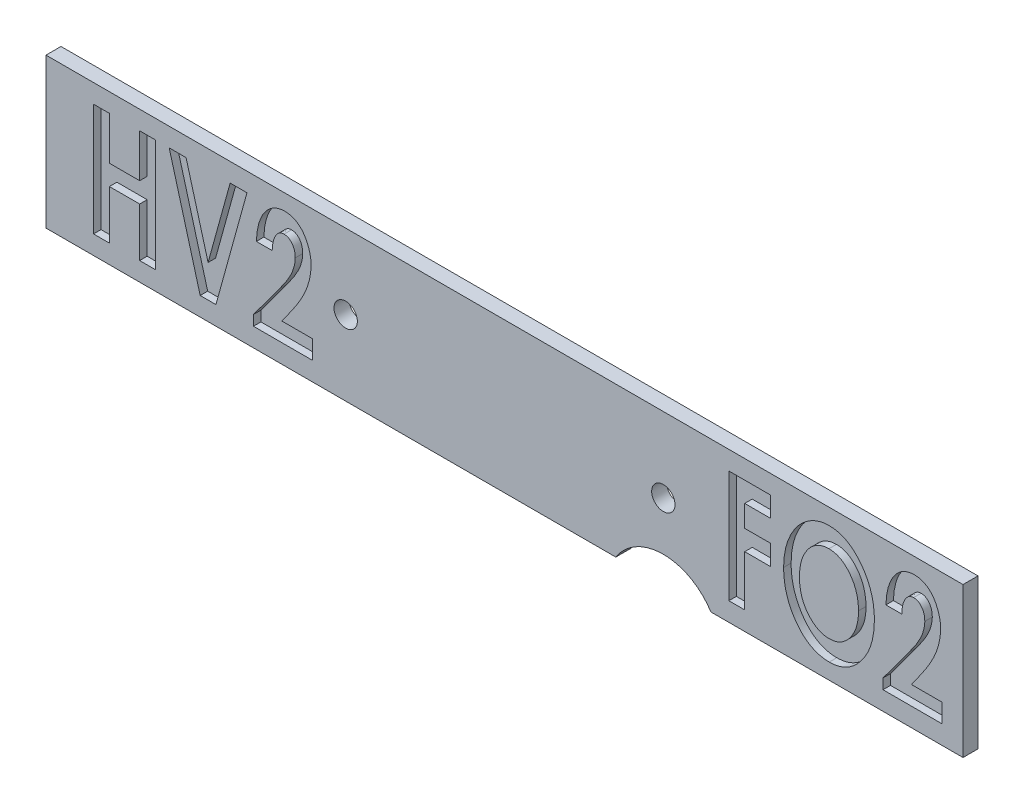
ISO-10303-21;
HEADER;
FILE_DESCRIPTION(('STEP AP214'),'2;1');
FILE_NAME('part.step','',(''),(''),'','','');
FILE_SCHEMA(('AUTOMOTIVE_DESIGN { 1 0 10303 214 1 1 1 1 }'));
ENDSEC;
DATA;
#1=APPLICATION_CONTEXT('core data for automotive mechanical design processes');
#2=APPLICATION_PROTOCOL_DEFINITION('international standard','automotive_design',2000,#1);
#3=PRODUCT_CONTEXT('',#1,'mechanical');
#4=PRODUCT('Part','Part','',(#3));
#5=PRODUCT_RELATED_PRODUCT_CATEGORY('part','',(#4));
#6=PRODUCT_DEFINITION_FORMATION('','',#4);
#7=PRODUCT_DEFINITION_CONTEXT('part definition',#1,'design');
#8=PRODUCT_DEFINITION('design','',#6,#7);
#9=PRODUCT_DEFINITION_SHAPE('','',#8);
#10=(LENGTH_UNIT() NAMED_UNIT(*) SI_UNIT(.MILLI.,.METRE.));
#11=(NAMED_UNIT(*) PLANE_ANGLE_UNIT() SI_UNIT($,.RADIAN.));
#12=(NAMED_UNIT(*) SI_UNIT($,.STERADIAN.) SOLID_ANGLE_UNIT());
#13=UNCERTAINTY_MEASURE_WITH_UNIT(LENGTH_MEASURE(1.E-05),#10,'distance_accuracy_value','');
#14=(GEOMETRIC_REPRESENTATION_CONTEXT(3) GLOBAL_UNCERTAINTY_ASSIGNED_CONTEXT((#13)) GLOBAL_UNIT_ASSIGNED_CONTEXT((#10,
#11,#12)) REPRESENTATION_CONTEXT('',''));
#15=CARTESIAN_POINT('',(0.,0.,0.));
#16=DIRECTION('',(0.,0.,1.));
#17=DIRECTION('',(1.,0.,0.));
#18=AXIS2_PLACEMENT_3D('',#15,#16,#17);
#19=CARTESIAN_POINT('',(0.,0.,2.54));
#20=DIRECTION('',(0.,1.,0.));
#21=DIRECTION('',(-1.,0.,0.));
#22=AXIS2_PLACEMENT_3D('',#19,#20,#21);
#23=PLANE('',#22);
#24=DIRECTION('',(1.,0.,0.));
#25=VECTOR('',#24,1.);
#26=CARTESIAN_POINT('',(0.,0.,0.));
#27=LINE('',#26,#25);
#28=CARTESIAN_POINT('',(-155.448,0.,0.));
#29=VERTEX_POINT('',#28);
#30=CARTESIAN_POINT('',(-58.8572467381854,0.,0.));
#31=VERTEX_POINT('',#30);
#32=EDGE_CURVE('E485',#29,#31,#27,.T.);
#33=ORIENTED_EDGE('',*,*,#32,.T.);
#34=DIRECTION('',(0.,0.,1.));
#35=VECTOR('',#34,1.);
#36=CARTESIAN_POINT('',(-58.8572467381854,0.,0.));
#37=LINE('',#36,#35);
#38=CARTESIAN_POINT('',(-58.8572467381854,0.,2.54));
#39=VERTEX_POINT('',#38);
#40=EDGE_CURVE('E41',#31,#39,#37,.T.);
#41=ORIENTED_EDGE('',*,*,#40,.T.);
#42=DIRECTION('',(1.,0.,0.));
#43=VECTOR('',#42,1.);
#44=CARTESIAN_POINT('',(0.,0.,2.54));
#45=LINE('',#44,#43);
#46=CARTESIAN_POINT('',(-155.448,0.,2.54000000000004));
#47=VERTEX_POINT('',#46);
#48=EDGE_CURVE('E499',#47,#39,#45,.T.);
#49=ORIENTED_EDGE('',*,*,#48,.F.);
#50=DIRECTION('',(0.,0.,-1.));
#51=VECTOR('',#50,1.);
#52=CARTESIAN_POINT('',(-155.448,0.,2.54000000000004));
#53=LINE('',#52,#51);
#54=EDGE_CURVE('E504',#47,#29,#53,.T.);
#55=ORIENTED_EDGE('',*,*,#54,.T.);
#56=EDGE_LOOP('',(#33,#41,#49,#55));
#57=FACE_BOUND('',#56,.T.);
#58=ADVANCED_FACE('F26',(#57),#23,.F.);
#59=CARTESIAN_POINT('',(0.,25.4,2.54));
#60=DIRECTION('',(0.,0.,1.));
#61=DIRECTION('',(1.,0.,0.));
#62=AXIS2_PLACEMENT_3D('',#59,#60,#61);
#63=PLANE('',#62);
#64=CARTESIAN_POINT('',(-104.648,12.7,2.54));
#65=DIRECTION('',(0.,0.,1.));
#66=DIRECTION('',(1.,0.,0.));
#67=AXIS2_PLACEMENT_3D('',#64,#65,#66);
#68=CIRCLE('',#67,1.9812);
#69=CARTESIAN_POINT('',(-102.6668,12.7,2.54));
#70=VERTEX_POINT('',#69);
#71=EDGE_CURVE('E1783',#70,#70,#68,.T.);
#72=ORIENTED_EDGE('',*,*,#71,.F.);
#73=EDGE_LOOP('',(#72));
#74=FACE_BOUND('',#73,.T.);
#75=CARTESIAN_POINT('',(-50.8,12.7,2.54));
#76=DIRECTION('',(0.,0.,1.));
#77=DIRECTION('',(1.,0.,0.));
#78=AXIS2_PLACEMENT_3D('',#75,#76,#77);
#79=CIRCLE('',#78,1.9812);
#80=CARTESIAN_POINT('',(-48.8188,12.7,2.54));
#81=VERTEX_POINT('',#80);
#82=EDGE_CURVE('E1777',#81,#81,#79,.T.);
#83=ORIENTED_EDGE('',*,*,#82,.F.);
#84=EDGE_LOOP('',(#83));
#85=FACE_BOUND('',#84,.T.);
#86=CARTESIAN_POINT('',(-50.8,-5.08000000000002,2.54));
#87=DIRECTION('',(0.,0.,1.));
#88=DIRECTION('',(1.,0.,0.));
#89=AXIS2_PLACEMENT_3D('',#86,#87,#88);
#90=CIRCLE('',#89,9.52500000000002);
#91=CARTESIAN_POINT('',(-42.7427532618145,0.,2.54));
#92=VERTEX_POINT('',#91);
#93=EDGE_CURVE('E471',#92,#39,#90,.T.);
#94=ORIENTED_EDGE('',*,*,#93,.F.);
#95=CARTESIAN_POINT('',(0.,0.,2.54));
#96=VERTEX_POINT('',#95);
#97=EDGE_CURVE('E479',#92,#96,#45,.T.);
#98=ORIENTED_EDGE('',*,*,#97,.T.);
#99=DIRECTION('',(0.,1.,0.));
#100=VECTOR('',#99,1.);
#101=CARTESIAN_POINT('',(0.,0.,2.54));
#102=LINE('',#101,#100);
#103=CARTESIAN_POINT('',(0.,25.4,2.54));
#104=VERTEX_POINT('',#103);
#105=EDGE_CURVE('E488',#96,#104,#102,.T.);
#106=ORIENTED_EDGE('',*,*,#105,.T.);
#107=DIRECTION('',(-1.,0.,0.));
#108=VECTOR('',#107,1.);
#109=CARTESIAN_POINT('',(0.,25.4,2.54));
#110=LINE('',#109,#108);
#111=CARTESIAN_POINT('',(-155.448,25.4,2.54000000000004));
#112=VERTEX_POINT('',#111);
#113=EDGE_CURVE('E495',#104,#112,#110,.T.);
#114=ORIENTED_EDGE('',*,*,#113,.T.);
#115=DIRECTION('',(0.,-1.,0.));
#116=VECTOR('',#115,1.);
#117=CARTESIAN_POINT('',(-155.448,0.,2.54000000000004));
#118=LINE('',#117,#116);
#119=EDGE_CURVE('E497',#112,#47,#118,.T.);
#120=ORIENTED_EDGE('',*,*,#119,.T.);
#121=ORIENTED_EDGE('',*,*,#48,.T.);
#122=EDGE_LOOP('',(#94,#98,#106,#114,#120,#121));
#123=FACE_BOUND('',#122,.T.);
#124=CARTESIAN_POINT('',(-22.6687367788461,2.68653846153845,2.53999999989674));
#125=CARTESIAN_POINT('',(-22.9416609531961,2.69447546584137,2.53999999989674));
#126=CARTESIAN_POINT('',(-23.4785857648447,2.71008996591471,2.53999999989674));
#127=CARTESIAN_POINT('',(-24.2630924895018,2.85950186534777,2.53999999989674));
#128=CARTESIAN_POINT('',(-25.015924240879,3.08472561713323,2.53999999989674));
#129=CARTESIAN_POINT('',(-25.7281002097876,3.41980803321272,2.53999999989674));
#130=CARTESIAN_POINT('',(-26.4103293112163,3.83776521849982,2.53999999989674));
#131=CARTESIAN_POINT('',(-27.0530248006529,4.35371118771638,2.53999999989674));
#132=CARTESIAN_POINT('',(-27.6579629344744,4.96250810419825,2.53999999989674));
#133=CARTESIAN_POINT('',(-28.2210793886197,5.65264113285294,2.53999999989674));
#134=CARTESIAN_POINT('',(-28.729609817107,6.40754345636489,2.53999999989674));
#135=CARTESIAN_POINT('',(-29.1846279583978,7.20223380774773,2.53999999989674));
#136=CARTESIAN_POINT('',(-29.5608217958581,8.03682050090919,2.53999999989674));
#137=CARTESIAN_POINT('',(-29.8713639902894,8.90473111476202,2.53999999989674));
#138=CARTESIAN_POINT('',(-30.1167788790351,9.80507663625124,2.53999999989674));
#139=CARTESIAN_POINT('',(-30.2868080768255,10.7422335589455,2.53999999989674));
#140=CARTESIAN_POINT('',(-30.3926540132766,11.7129977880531,2.53999999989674));
#141=CARTESIAN_POINT('',(-30.4052324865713,12.3728120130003,2.53999999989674));
#142=CARTESIAN_POINT('',(-30.4116153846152,12.7076322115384,2.53999999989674));
#143=B_SPLINE_CURVE_WITH_KNOTS('',3,(#124,#125,#126,#127,#128,#129,#130,#131,#132,#133,#134,
#135,#136,#137,#138,#139,#140,#141,#142),.UNSPECIFIED.,.F.,.F.,(4,1,1,1,1,1,1,1,1,1,1,1,1,1,1,1,
4),(0.,0.0582060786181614,0.114509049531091,0.169914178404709,0.225563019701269,
0.28201315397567,0.340371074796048,0.401050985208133,0.464926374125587,0.530229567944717,
0.595171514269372,0.660191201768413,0.72538758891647,0.791791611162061,0.859170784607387,
0.928536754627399,1.),.UNSPECIFIED.);
#144=CARTESIAN_POINT('',(-22.6687367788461,2.68653846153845,2.53999999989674));
#145=VERTEX_POINT('',#144);
#146=CARTESIAN_POINT('',(-30.4116153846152,12.7076322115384,2.54));
#147=VERTEX_POINT('',#146);
#148=EDGE_CURVE('E1610',#145,#147,#143,.T.);
#149=ORIENTED_EDGE('',*,*,#148,.T.);
#150=CARTESIAN_POINT('',(-30.4116153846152,12.7076322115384,2.53999999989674));
#151=CARTESIAN_POINT('',(-30.4090592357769,12.9328800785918,2.53999999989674));
#152=CARTESIAN_POINT('',(-30.4039839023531,13.3801185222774,2.53999999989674));
#153=CARTESIAN_POINT('',(-30.351897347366,14.0435681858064,2.53999999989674));
#154=CARTESIAN_POINT('',(-30.2724037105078,14.6930703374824,2.53999999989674));
#155=CARTESIAN_POINT('',(-30.1624620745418,15.329150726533,2.53999999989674));
#156=CARTESIAN_POINT('',(-30.0165388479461,15.9503556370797,2.53999999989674));
#157=CARTESIAN_POINT('',(-29.8414604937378,16.5598642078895,2.53999999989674));
#158=CARTESIAN_POINT('',(-29.6312354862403,17.1544516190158,2.53999999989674));
#159=CARTESIAN_POINT('',(-29.390262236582,17.7332928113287,2.53999999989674));
#160=CARTESIAN_POINT('',(-29.1274468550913,18.2924675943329,2.53999999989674));
#161=CARTESIAN_POINT('',(-28.8300119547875,18.820172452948,2.53999999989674));
#162=CARTESIAN_POINT('',(-28.5154165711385,19.3222890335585,2.53999999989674));
#163=CARTESIAN_POINT('',(-28.1704162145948,19.7901742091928,2.53999999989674));
#164=CARTESIAN_POINT('',(-27.8067698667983,20.2328122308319,2.53999999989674));
#165=CARTESIAN_POINT('',(-27.4189023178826,20.6444642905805,2.53999999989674));
#166=CARTESIAN_POINT('',(-27.0033422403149,21.0245430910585,2.53999999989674));
#167=CARTESIAN_POINT('',(-26.5667622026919,21.3729474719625,2.53999999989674));
#168=CARTESIAN_POINT('',(-26.1164023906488,21.6902292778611,2.53999999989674));
#169=CARTESIAN_POINT('',(-25.6504315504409,21.9617144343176,2.53999999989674));
#170=CARTESIAN_POINT('',(-25.1798929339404,22.1959618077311,2.53999999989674));
#171=CARTESIAN_POINT('',(-24.6975636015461,22.38284082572,2.53999999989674));
#172=CARTESIAN_POINT('',(-24.2089182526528,22.5353844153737,2.53999999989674));
#173=CARTESIAN_POINT('',(-23.7083891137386,22.6339982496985,2.53999999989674));
#174=CARTESIAN_POINT('',(-23.2012037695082,22.7050244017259,2.53999999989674));
#175=CARTESIAN_POINT('',(-22.8597958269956,22.7106351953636,2.53999999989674));
#176=CARTESIAN_POINT('',(-22.6878173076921,22.7134615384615,2.53999999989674));
#177=B_SPLINE_CURVE_WITH_KNOTS('',3,(#150,#151,#152,#153,#154,#155,#156,#157,#158,#159,#160,
#161,#162,#163,#164,#165,#166,#167,#168,#169,#170,#171,#172,#173,#174,#175,#176),.UNSPECIFIED.,
.F.,.F.,(4,1,1,1,1,1,1,1,1,1,1,1,1,1,1,1,1,1,1,1,1,1,1,1,4),(0.,0.0482729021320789,
0.0958477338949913,0.142552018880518,0.188498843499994,0.234133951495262,0.279264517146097,
0.324365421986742,0.369228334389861,0.413621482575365,0.456709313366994,0.498993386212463,
0.540549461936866,0.581220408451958,0.621724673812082,0.661671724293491,0.701826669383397,
0.741385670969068,0.779637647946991,0.817316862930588,0.853924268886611,0.890408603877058,
0.926877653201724,0.963165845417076,1.),.UNSPECIFIED.);
#178=CARTESIAN_POINT('',(-22.6878173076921,22.7134615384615,2.53999999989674));
#179=VERTEX_POINT('',#178);
#180=EDGE_CURVE('E1581',#147,#179,#177,.T.);
#181=ORIENTED_EDGE('',*,*,#180,.T.);
#182=CARTESIAN_POINT('',(-22.6878173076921,22.7134615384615,2.53999999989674));
#183=CARTESIAN_POINT('',(-22.4302305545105,22.7049013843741,2.53999999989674));
#184=CARTESIAN_POINT('',(-21.9202263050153,22.6879528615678,2.53999999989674));
#185=CARTESIAN_POINT('',(-21.170174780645,22.5449761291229,2.53999999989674));
#186=CARTESIAN_POINT('',(-20.4477734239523,22.3164276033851,2.53999999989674));
#187=CARTESIAN_POINT('',(-19.7544320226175,21.9900699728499,2.53999999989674));
#188=CARTESIAN_POINT('',(-19.0878688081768,21.5761193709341,2.53999999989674));
#189=CARTESIAN_POINT('',(-18.4513933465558,21.067721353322,2.53999999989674));
#190=CARTESIAN_POINT('',(-17.8470228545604,20.4654215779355,2.53999999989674));
#191=CARTESIAN_POINT('',(-17.2736651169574,19.7849925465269,2.53999999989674));
#192=CARTESIAN_POINT('',(-16.7460503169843,19.0397527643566,2.53999999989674));
#193=CARTESIAN_POINT('',(-16.2879092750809,18.2424465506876,2.53999999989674));
#194=CARTESIAN_POINT('',(-15.8973674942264,17.4075562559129,2.53999999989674));
#195=CARTESIAN_POINT('',(-15.5748403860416,16.5337343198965,2.53999999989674));
#196=CARTESIAN_POINT('',(-15.3265025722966,15.6179926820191,2.53999999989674));
#197=CARTESIAN_POINT('',(-15.1540455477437,14.6615812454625,2.53999999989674));
#198=CARTESIAN_POINT('',(-15.0427064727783,13.6655639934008,2.53999999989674));
#199=CARTESIAN_POINT('',(-15.0310239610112,12.9877850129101,2.53999999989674));
#200=CARTESIAN_POINT('',(-15.0250769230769,12.6427584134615,2.53999999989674));
#201=B_SPLINE_CURVE_WITH_KNOTS('',3,(#182,#183,#184,#185,#186,#187,#188,#189,#190,#191,#192,
#193,#194,#195,#196,#197,#198,#199,#200),.UNSPECIFIED.,.F.,.F.,(4,1,1,1,1,1,1,1,1,1,1,1,1,1,1,1,
4),(0.,0.0551294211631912,0.109152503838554,0.162915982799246,0.217031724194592,
0.272824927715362,0.330604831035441,0.391095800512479,0.455280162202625,0.520965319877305,
0.586386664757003,0.651957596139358,0.718154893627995,0.785632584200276,0.854885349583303,
0.926128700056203,1.),.UNSPECIFIED.);
#202=CARTESIAN_POINT('',(-15.0250769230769,12.6427584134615,2.53999999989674));
#203=VERTEX_POINT('',#202);
#204=EDGE_CURVE('E1594',#179,#203,#201,.T.);
#205=ORIENTED_EDGE('',*,*,#204,.T.);
#206=CARTESIAN_POINT('',(-15.0250769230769,12.6427584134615,2.53999999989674));
#207=CARTESIAN_POINT('',(-15.0309938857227,12.3015373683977,2.53999999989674));
#208=CARTESIAN_POINT('',(-15.0426372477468,11.6300847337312,2.53999999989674));
#209=CARTESIAN_POINT('',(-15.1546494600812,10.6445626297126,2.53999999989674));
#210=CARTESIAN_POINT('',(-15.3230603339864,9.69698872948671,2.53999999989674));
#211=CARTESIAN_POINT('',(-15.566838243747,8.7898161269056,2.53999999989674));
#212=CARTESIAN_POINT('',(-15.8871022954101,7.92495758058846,2.53999999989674));
#213=CARTESIAN_POINT('',(-16.2666205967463,7.09596510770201,2.53999999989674));
#214=CARTESIAN_POINT('',(-16.7251802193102,6.31139683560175,2.53999999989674));
#215=CARTESIAN_POINT('',(-17.2417191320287,5.57334554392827,2.53999999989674));
#216=CARTESIAN_POINT('',(-17.8102322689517,4.90140187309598,2.53999999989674));
#217=CARTESIAN_POINT('',(-18.4130235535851,4.31010019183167,2.53999999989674));
#218=CARTESIAN_POINT('',(-19.0471199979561,3.80903117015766,2.53999999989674));
#219=CARTESIAN_POINT('',(-19.7109358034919,3.39509411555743,2.53999999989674));
#220=CARTESIAN_POINT('',(-20.409236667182,3.07709142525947,2.53999999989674));
#221=CARTESIAN_POINT('',(-21.1359809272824,2.85065643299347,2.53999999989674));
#222=CARTESIAN_POINT('',(-21.892649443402,2.71264176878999,2.53999999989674));
#223=CARTESIAN_POINT('',(-22.4073893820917,2.6953287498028,2.53999999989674));
#224=CARTESIAN_POINT('',(-22.6687367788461,2.68653846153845,2.53999999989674));
#225=B_SPLINE_CURVE_WITH_KNOTS('',3,(#206,#207,#208,#209,#210,#211,#212,#213,#214,#215,#216,
#217,#218,#219,#220,#221,#222,#223,#224),.UNSPECIFIED.,.F.,.F.,(4,1,1,1,1,1,1,1,1,1,1,1,1,1,1,1,
4),(0.,0.0735273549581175,0.144686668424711,0.213529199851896,0.280842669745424,
0.346859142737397,0.412125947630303,0.477121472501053,0.54246771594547,0.606085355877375,
0.666583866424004,0.72418244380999,0.779959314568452,0.8348084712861,0.88909892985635,
0.943692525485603,1.),.UNSPECIFIED.);
#226=EDGE_CURVE('E1602',#203,#145,#225,.T.);
#227=ORIENTED_EDGE('',*,*,#226,.T.);
#228=EDGE_LOOP('',(#149,#181,#205,#227));
#229=FACE_BOUND('',#228,.T.);
#230=CARTESIAN_POINT('',(-113.196076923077,16.7603365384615,2.54));
#231=CARTESIAN_POINT('',(-113.202298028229,16.9364213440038,2.54));
#232=CARTESIAN_POINT('',(-113.214262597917,17.2750716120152,2.54));
#233=CARTESIAN_POINT('',(-113.316036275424,17.7588872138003,2.54));
#234=CARTESIAN_POINT('',(-113.478182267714,18.1973846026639,2.54));
#235=CARTESIAN_POINT('',(-113.711462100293,18.5771515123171,2.54));
#236=CARTESIAN_POINT('',(-113.991168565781,18.8960126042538,2.54));
#237=CARTESIAN_POINT('',(-114.321882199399,19.12694768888,2.54));
#238=CARTESIAN_POINT('',(-114.69506693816,19.2695586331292,2.54));
#239=CARTESIAN_POINT('',(-114.957855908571,19.2858647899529,2.54));
#240=CARTESIAN_POINT('',(-115.092681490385,19.2942307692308,2.54));
#241=B_SPLINE_CURVE_WITH_KNOTS('',3,(#230,#231,#232,#233,#234,#235,#236,#237,#238,#239,#240),
.UNSPECIFIED.,.F.,.F.,(4,1,1,1,1,1,1,1,4),(0.,0.149680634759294,0.28786917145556,
0.418729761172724,0.545511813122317,0.665060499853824,0.777050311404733,0.885614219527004,1.),.UNSPECIFIED.);
#242=CARTESIAN_POINT('',(-113.196076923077,16.7603365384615,2.54));
#243=VERTEX_POINT('',#242);
#244=CARTESIAN_POINT('',(-115.092681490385,19.2942307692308,2.54));
#245=VERTEX_POINT('',#244);
#246=EDGE_CURVE('E783',#243,#245,#241,.T.);
#247=ORIENTED_EDGE('',*,*,#246,.T.);
#248=CARTESIAN_POINT('',(-115.092681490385,19.2942307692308,2.54));
#249=CARTESIAN_POINT('',(-115.16156940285,19.2910245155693,2.54));
#250=CARTESIAN_POINT('',(-115.298076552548,19.284671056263,2.54));
#251=CARTESIAN_POINT('',(-115.49913710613,19.2419306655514,2.54));
#252=CARTESIAN_POINT('',(-115.690414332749,19.1688521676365,2.54));
#253=CARTESIAN_POINT('',(-115.873259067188,19.0663857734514,2.54));
#254=CARTESIAN_POINT('',(-116.049400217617,18.938655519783,2.54));
#255=CARTESIAN_POINT('',(-116.208812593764,18.7725135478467,2.54));
#256=CARTESIAN_POINT('',(-116.366295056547,18.5873236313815,2.54));
#257=CARTESIAN_POINT('',(-116.563653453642,18.2933546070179,2.54));
#258=CARTESIAN_POINT('',(-116.773608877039,17.8633957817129,2.54));
#259=CARTESIAN_POINT('',(-116.954943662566,17.2727173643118,2.54));
#260=CARTESIAN_POINT('',(-117.066328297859,16.6001640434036,2.54));
#261=CARTESIAN_POINT('',(-117.090874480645,16.1247482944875,2.54));
#262=CARTESIAN_POINT('',(-117.103769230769,15.875,2.54));
#263=B_SPLINE_CURVE_WITH_KNOTS('',3,(#248,#249,#250,#251,#252,#253,#254,#255,#256,#257,#258,
#259,#260,#261,#262),.UNSPECIFIED.,.F.,.F.,(4,1,1,1,1,1,1,1,1,1,1,1,4),(0.,0.0473607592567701,
0.0938492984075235,0.140633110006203,0.187612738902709,0.237644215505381,0.289596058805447,
0.345478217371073,0.404671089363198,0.532580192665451,0.672833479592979,0.828130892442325,1.),.UNSPECIFIED.);
#264=CARTESIAN_POINT('',(-117.103769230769,15.875,2.54));
#265=VERTEX_POINT('',#264);
#266=EDGE_CURVE('E1156',#245,#265,#263,.T.);
#267=ORIENTED_EDGE('',*,*,#266,.T.);
#268=DIRECTION('',(-1.,0.,0.));
#269=VECTOR('',#268,1.);
#270=CARTESIAN_POINT('',(-117.103769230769,15.875,2.54));
#271=LINE('',#270,#269);
#272=CARTESIAN_POINT('',(-119.790307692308,15.875,2.54));
#273=VERTEX_POINT('',#272);
#274=EDGE_CURVE('E1161',#265,#273,#271,.T.);
#275=ORIENTED_EDGE('',*,*,#274,.T.);
#276=CARTESIAN_POINT('',(-119.790307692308,15.875,2.54));
#277=CARTESIAN_POINT('',(-119.778031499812,16.1334417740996,2.54));
#278=CARTESIAN_POINT('',(-119.75408871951,16.6374917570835,2.54));
#279=CARTESIAN_POINT('',(-119.66914602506,17.3714899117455,2.54));
#280=CARTESIAN_POINT('',(-119.548181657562,18.0637634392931,2.54));
#281=CARTESIAN_POINT('',(-119.389411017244,18.7134245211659,2.54));
#282=CARTESIAN_POINT('',(-119.189686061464,19.3204503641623,2.54));
#283=CARTESIAN_POINT('',(-118.955160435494,19.8859255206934,2.54));
#284=CARTESIAN_POINT('',(-118.678914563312,20.4082493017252,2.54));
#285=CARTESIAN_POINT('',(-118.367248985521,20.8850077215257,2.54));
#286=CARTESIAN_POINT('',(-118.023511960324,21.3119902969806,2.54));
#287=CARTESIAN_POINT('',(-117.658539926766,21.6905002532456,2.54));
#288=CARTESIAN_POINT('',(-117.262201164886,22.0055651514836,2.54));
#289=CARTESIAN_POINT('',(-116.843277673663,22.2615417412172,2.54));
#290=CARTESIAN_POINT('',(-116.405097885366,22.4699728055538,2.54));
#291=CARTESIAN_POINT('',(-115.937470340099,22.6078966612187,2.54));
#292=CARTESIAN_POINT('',(-115.448727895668,22.7007373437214,2.54));
#293=CARTESIAN_POINT('',(-115.113475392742,22.7091866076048,2.54));
#294=CARTESIAN_POINT('',(-114.943853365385,22.7134615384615,2.54));
#295=B_SPLINE_CURVE_WITH_KNOTS('',3,(#276,#277,#278,#279,#280,#281,#282,#283,#284,#285,#286,
#287,#288,#289,#290,#291,#292,#293,#294),.UNSPECIFIED.,.F.,.F.,(4,1,1,1,1,1,1,1,1,1,1,1,1,1,1,1,
4),(0.,0.0832854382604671,0.162435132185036,0.237714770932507,0.309433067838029,
0.377557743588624,0.443276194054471,0.506300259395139,0.567527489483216,0.626372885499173,
0.682558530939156,0.736478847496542,0.788879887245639,0.84036869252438,0.892190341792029,
0.945453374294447,1.),.UNSPECIFIED.);
#296=CARTESIAN_POINT('',(-114.943853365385,22.7134615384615,2.54));
#297=VERTEX_POINT('',#296);
#298=EDGE_CURVE('E1167',#273,#297,#295,.T.);
#299=ORIENTED_EDGE('',*,*,#298,.T.);
#300=CARTESIAN_POINT('',(-114.943853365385,22.7134615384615,2.54));
#301=CARTESIAN_POINT('',(-114.734443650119,22.705140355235,2.54));
#302=CARTESIAN_POINT('',(-114.324869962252,22.6888653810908,2.54));
#303=CARTESIAN_POINT('',(-113.729715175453,22.5462506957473,2.54));
#304=CARTESIAN_POINT('',(-113.174195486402,22.3110893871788,2.54));
#305=CARTESIAN_POINT('',(-112.65869772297,21.9818519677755,2.54));
#306=CARTESIAN_POINT('',(-112.187531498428,21.5675841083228,2.54));
#307=CARTESIAN_POINT('',(-111.768704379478,21.0660606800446,2.54));
#308=CARTESIAN_POINT('',(-111.397178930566,20.4870162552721,2.54));
#309=CARTESIAN_POINT('',(-111.089909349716,19.8349104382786,2.54));
#310=CARTESIAN_POINT('',(-110.830221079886,19.1468247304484,2.54));
#311=CARTESIAN_POINT('',(-110.6481180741,18.4364989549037,2.54));
#312=CARTESIAN_POINT('',(-110.532438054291,17.7206984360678,2.54));
#313=CARTESIAN_POINT('',(-110.517158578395,17.2403223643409,2.54));
#314=CARTESIAN_POINT('',(-110.509538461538,17.0007512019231,2.54));
#315=B_SPLINE_CURVE_WITH_KNOTS('',3,(#300,#301,#302,#303,#304,#305,#306,#307,#308,#309,#310,
#311,#312,#313,#314),.UNSPECIFIED.,.F.,.F.,(4,1,1,1,1,1,1,1,1,1,1,1,4),(0.,0.0781714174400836,
0.152891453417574,0.227235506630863,0.302671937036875,0.38048550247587,0.460770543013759,
0.546088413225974,0.636876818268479,0.72968392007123,0.820541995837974,0.910501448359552,1.),.UNSPECIFIED.);
#316=CARTESIAN_POINT('',(-110.509538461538,17.0007512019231,2.54));
#317=VERTEX_POINT('',#316);
#318=EDGE_CURVE('E1172',#297,#317,#315,.T.);
#319=ORIENTED_EDGE('',*,*,#318,.T.);
#320=CARTESIAN_POINT('',(-110.509538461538,17.0007512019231,2.54));
#321=CARTESIAN_POINT('',(-110.519128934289,16.7090022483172,2.54));
#322=CARTESIAN_POINT('',(-110.538780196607,16.1111969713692,2.54));
#323=CARTESIAN_POINT('',(-110.678956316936,15.2003137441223,2.54));
#324=CARTESIAN_POINT('',(-110.9068751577,14.2578126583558,2.54));
#325=CARTESIAN_POINT('',(-111.168521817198,13.4550110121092,2.54));
#326=CARTESIAN_POINT('',(-111.430218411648,12.7892068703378,2.54));
#327=CARTESIAN_POINT('',(-111.66712123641,12.2614575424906,2.54));
#328=CARTESIAN_POINT('',(-111.938820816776,11.7099270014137,2.54));
#329=CARTESIAN_POINT('',(-112.250136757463,11.1370174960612,2.54));
#330=CARTESIAN_POINT('',(-112.59572029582,10.5390783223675,2.54));
#331=CARTESIAN_POINT('',(-112.983161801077,9.92046230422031,2.54));
#332=CARTESIAN_POINT('',(-113.40674845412,9.27994377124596,2.54));
#333=CARTESIAN_POINT('',(-113.706545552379,8.84894212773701,2.54));
#334=CARTESIAN_POINT('',(-113.860079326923,8.62821514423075,2.54));
#335=B_SPLINE_CURVE_WITH_KNOTS('',3,(#320,#321,#322,#323,#324,#325,#326,#327,#328,#329,#330,
#331,#332,#333,#334),.UNSPECIFIED.,.F.,.F.,(4,1,1,1,1,1,1,1,1,1,1,1,4),(0.,0.0954992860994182,
0.195681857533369,0.301035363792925,0.412715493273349,0.471799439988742,0.535184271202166,
0.602047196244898,0.673041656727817,0.748614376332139,0.828118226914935,0.911974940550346,1.),.UNSPECIFIED.);
#336=CARTESIAN_POINT('',(-113.860079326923,8.62821514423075,2.54));
#337=VERTEX_POINT('',#336);
#338=EDGE_CURVE('E1180',#317,#337,#335,.T.);
#339=ORIENTED_EDGE('',*,*,#338,.T.);
#340=DIRECTION('',(-0.573554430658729,-0.819167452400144,0.));
#341=VECTOR('',#340,1.);
#342=CARTESIAN_POINT('',(-113.860079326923,8.62821514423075,2.54));
#343=LINE('',#342,#341);
#344=CARTESIAN_POINT('',(-115.455211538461,6.34999999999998,2.54));
#345=VERTEX_POINT('',#344);
#346=EDGE_CURVE('E1188',#337,#345,#343,.T.);
#347=ORIENTED_EDGE('',*,*,#346,.T.);
#348=DIRECTION('',(1.,0.,0.));
#349=VECTOR('',#348,1.);
#350=CARTESIAN_POINT('',(-115.455211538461,6.34999999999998,2.54));
#351=LINE('',#350,#349);
#352=CARTESIAN_POINT('',(-110.265307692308,6.35000000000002,2.54));
#353=VERTEX_POINT('',#352);
#354=EDGE_CURVE('E1194',#345,#353,#351,.T.);
#355=ORIENTED_EDGE('',*,*,#354,.T.);
#356=DIRECTION('',(0.,-1.,0.));
#357=VECTOR('',#356,1.);
#358=CARTESIAN_POINT('',(-110.265307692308,6.35000000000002,2.54));
#359=LINE('',#358,#357);
#360=CARTESIAN_POINT('',(-110.265307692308,3.17500000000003,2.54));
#361=VERTEX_POINT('',#360);
#362=EDGE_CURVE('E1197',#353,#361,#359,.T.);
#363=ORIENTED_EDGE('',*,*,#362,.T.);
#364=DIRECTION('',(-1.,0.,0.));
#365=VECTOR('',#364,1.);
#366=CARTESIAN_POINT('',(-110.265307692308,3.17500000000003,2.54));
#367=LINE('',#366,#365);
#368=CARTESIAN_POINT('',(-120.278769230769,3.17499999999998,2.54));
#369=VERTEX_POINT('',#368);
#370=EDGE_CURVE('E1200',#361,#369,#367,.T.);
#371=ORIENTED_EDGE('',*,*,#370,.T.);
#372=DIRECTION('',(0.,1.,0.));
#373=VECTOR('',#372,1.);
#374=CARTESIAN_POINT('',(-120.278769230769,3.17499999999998,2.54));
#375=LINE('',#374,#373);
#376=CARTESIAN_POINT('',(-120.278769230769,4.90751201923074,2.54));
#377=VERTEX_POINT('',#376);
#378=EDGE_CURVE('E1203',#369,#377,#375,.T.);
#379=ORIENTED_EDGE('',*,*,#378,.T.);
#380=DIRECTION('',(0.592849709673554,0.805313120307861,0.));
#381=VECTOR('',#380,1.);
#382=CARTESIAN_POINT('',(-120.278769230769,4.90751201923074,2.54));
#383=LINE('',#382,#381);
#384=CARTESIAN_POINT('',(-115.85971875,10.9102463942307,2.54));
#385=VERTEX_POINT('',#384);
#386=EDGE_CURVE('E1206',#377,#385,#383,.T.);
#387=ORIENTED_EDGE('',*,*,#386,.T.);
#388=CARTESIAN_POINT('',(-115.85971875,10.9102463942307,2.54));
#389=CARTESIAN_POINT('',(-115.730208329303,11.085044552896,2.54));
#390=CARTESIAN_POINT('',(-115.479901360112,11.4228798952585,2.54));
#391=CARTESIAN_POINT('',(-115.133423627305,11.9253140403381,2.54));
#392=CARTESIAN_POINT('',(-114.815109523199,12.3988168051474,2.54));
#393=CARTESIAN_POINT('',(-114.529321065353,12.8455223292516,2.54));
#394=CARTESIAN_POINT('',(-114.281065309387,13.2681846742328,2.54));
#395=CARTESIAN_POINT('',(-114.06084666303,13.6606601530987,2.54));
#396=CARTESIAN_POINT('',(-113.878542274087,14.0292621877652,2.54));
#397=CARTESIAN_POINT('',(-113.68229020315,14.4768539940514,2.54));
#398=CARTESIAN_POINT('',(-113.48965866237,15.0053950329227,2.54));
#399=CARTESIAN_POINT('',(-113.324662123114,15.6182708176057,2.54));
#400=CARTESIAN_POINT('',(-113.218754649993,16.1995384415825,2.54));
#401=CARTESIAN_POINT('',(-113.203448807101,16.5780370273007,2.54));
#402=CARTESIAN_POINT('',(-113.196076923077,16.7603365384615,2.54));
#403=B_SPLINE_CURVE_WITH_KNOTS('',3,(#388,#389,#390,#391,#392,#393,#394,#395,#396,#397,#398,
#399,#400,#401,#402),.UNSPECIFIED.,.F.,.F.,(4,1,1,1,1,1,1,1,1,1,1,1,4),(0.,0.0998704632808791,
0.193021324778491,0.280162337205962,0.3618155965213,0.436432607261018,0.50518083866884,
0.568384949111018,0.625131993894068,0.729510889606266,0.826266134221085,0.916323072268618,1.),.UNSPECIFIED.);
#404=EDGE_CURVE('E795',#385,#243,#403,.T.);
#405=ORIENTED_EDGE('',*,*,#404,.T.);
#406=EDGE_LOOP('',(#247,#267,#275,#299,#319,#339,#347,#355,#363,#371,#379,#387,#405));
#407=FACE_BOUND('',#406,.T.);
#408=DIRECTION('',(-1.,0.,0.));
#409=VECTOR('',#408,1.);
#410=CARTESIAN_POINT('',(-144.701846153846,3.17499999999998,2.54000000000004));
#411=LINE('',#410,#409);
#412=CARTESIAN_POINT('',(-144.701846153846,3.17499999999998,2.54000000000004));
#413=VERTEX_POINT('',#412);
#414=CARTESIAN_POINT('',(-147.388384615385,3.17499999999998,2.54000000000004));
#415=VERTEX_POINT('',#414);
#416=EDGE_CURVE('E576',#413,#415,#411,.T.);
#417=ORIENTED_EDGE('',*,*,#416,.T.);
#418=DIRECTION('',(0.,1.,0.));
#419=VECTOR('',#418,1.);
#420=CARTESIAN_POINT('',(-147.388384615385,3.17499999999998,2.54000000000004));
#421=LINE('',#420,#419);
#422=CARTESIAN_POINT('',(-147.388384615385,22.225,2.54000000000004));
#423=VERTEX_POINT('',#422);
#424=EDGE_CURVE('E609',#415,#423,#421,.T.);
#425=ORIENTED_EDGE('',*,*,#424,.T.);
#426=DIRECTION('',(1.,0.,0.));
#427=VECTOR('',#426,1.);
#428=CARTESIAN_POINT('',(-147.388384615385,22.225,2.54000000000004));
#429=LINE('',#428,#427);
#430=CARTESIAN_POINT('',(-144.701846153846,22.225,2.54000000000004));
#431=VERTEX_POINT('',#430);
#432=EDGE_CURVE('E606',#423,#431,#429,.T.);
#433=ORIENTED_EDGE('',*,*,#432,.T.);
#434=DIRECTION('',(0.,-1.,0.));
#435=VECTOR('',#434,1.);
#436=CARTESIAN_POINT('',(-144.701846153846,22.225,2.54000000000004));
#437=LINE('',#436,#435);
#438=CARTESIAN_POINT('',(-144.701846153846,14.8980769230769,2.54000000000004));
#439=VERTEX_POINT('',#438);
#440=EDGE_CURVE('E603',#431,#439,#437,.T.);
#441=ORIENTED_EDGE('',*,*,#440,.T.);
#442=DIRECTION('',(1.,0.,0.));
#443=VECTOR('',#442,1.);
#444=CARTESIAN_POINT('',(-144.701846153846,14.8980769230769,2.54000000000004));
#445=LINE('',#444,#443);
#446=CARTESIAN_POINT('',(-139.573,14.8980769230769,2.54000000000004));
#447=VERTEX_POINT('',#446);
#448=EDGE_CURVE('E600',#439,#447,#445,.T.);
#449=ORIENTED_EDGE('',*,*,#448,.T.);
#450=DIRECTION('',(0.,1.,0.));
#451=VECTOR('',#450,1.);
#452=CARTESIAN_POINT('',(-139.573,14.8980769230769,2.54000000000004));
#453=LINE('',#452,#451);
#454=CARTESIAN_POINT('',(-139.573,22.225,2.54000000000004));
#455=VERTEX_POINT('',#454);
#456=EDGE_CURVE('E597',#447,#455,#453,.T.);
#457=ORIENTED_EDGE('',*,*,#456,.T.);
#458=DIRECTION('',(1.,0.,0.));
#459=VECTOR('',#458,1.);
#460=CARTESIAN_POINT('',(-139.573,22.225,2.54000000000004));
#461=LINE('',#460,#459);
#462=CARTESIAN_POINT('',(-136.886461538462,22.225,2.54000000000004));
#463=VERTEX_POINT('',#462);
#464=EDGE_CURVE('E594',#455,#463,#461,.T.);
#465=ORIENTED_EDGE('',*,*,#464,.T.);
#466=DIRECTION('',(0.,-1.,0.));
#467=VECTOR('',#466,1.);
#468=CARTESIAN_POINT('',(-136.886461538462,22.225,2.54000000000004));
#469=LINE('',#468,#467);
#470=CARTESIAN_POINT('',(-136.886461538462,3.17499999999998,2.54000000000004));
#471=VERTEX_POINT('',#470);
#472=EDGE_CURVE('E591',#463,#471,#469,.T.);
#473=ORIENTED_EDGE('',*,*,#472,.T.);
#474=DIRECTION('',(-1.,0.,0.));
#475=VECTOR('',#474,1.);
#476=CARTESIAN_POINT('',(-136.886461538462,3.17499999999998,2.54000000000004));
#477=LINE('',#476,#475);
#478=CARTESIAN_POINT('',(-139.573,3.17499999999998,2.54000000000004));
#479=VERTEX_POINT('',#478);
#480=EDGE_CURVE('E588',#471,#479,#477,.T.);
#481=ORIENTED_EDGE('',*,*,#480,.T.);
#482=DIRECTION('',(0.,1.,0.));
#483=VECTOR('',#482,1.);
#484=CARTESIAN_POINT('',(-139.573,3.17499999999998,2.54000000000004));
#485=LINE('',#484,#483);
#486=CARTESIAN_POINT('',(-139.573,11.4788461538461,2.54000000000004));
#487=VERTEX_POINT('',#486);
#488=EDGE_CURVE('E585',#479,#487,#485,.T.);
#489=ORIENTED_EDGE('',*,*,#488,.T.);
#490=DIRECTION('',(-1.,0.,0.));
#491=VECTOR('',#490,1.);
#492=CARTESIAN_POINT('',(-139.573,11.4788461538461,2.54000000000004));
#493=LINE('',#492,#491);
#494=CARTESIAN_POINT('',(-144.701846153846,11.4788461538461,2.54000000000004));
#495=VERTEX_POINT('',#494);
#496=EDGE_CURVE('E582',#487,#495,#493,.T.);
#497=ORIENTED_EDGE('',*,*,#496,.T.);
#498=DIRECTION('',(0.,-1.,0.));
#499=VECTOR('',#498,1.);
#500=CARTESIAN_POINT('',(-144.701846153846,11.4788461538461,2.54000000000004));
#501=LINE('',#500,#499);
#502=EDGE_CURVE('E579',#495,#413,#501,.T.);
#503=ORIENTED_EDGE('',*,*,#502,.T.);
#504=EDGE_LOOP('',(#417,#425,#433,#441,#449,#457,#465,#473,#481,#489,#497,#503));
#505=FACE_BOUND('',#504,.T.);
#506=DIRECTION('',(-1.,0.,0.));
#507=VECTOR('',#506,1.);
#508=CARTESIAN_POINT('',(-126.644033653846,3.17499999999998,2.54));
#509=LINE('',#508,#507);
#510=CARTESIAN_POINT('',(-126.644033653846,3.17499999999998,2.54));
#511=VERTEX_POINT('',#510);
#512=CARTESIAN_POINT('',(-129.311491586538,3.17499999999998,2.54));
#513=VERTEX_POINT('',#512);
#514=EDGE_CURVE('E643',#511,#513,#509,.T.);
#515=ORIENTED_EDGE('',*,*,#514,.T.);
#516=DIRECTION('',(-0.265910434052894,0.963997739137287,0.));
#517=VECTOR('',#516,1.);
#518=CARTESIAN_POINT('',(-129.311491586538,3.17499999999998,2.54));
#519=LINE('',#518,#517);
#520=CARTESIAN_POINT('',(-134.566269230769,22.225,2.54000000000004));
#521=VERTEX_POINT('',#520);
#522=EDGE_CURVE('E661',#513,#521,#519,.T.);
#523=ORIENTED_EDGE('',*,*,#522,.T.);
#524=DIRECTION('',(1.,0.,0.));
#525=VECTOR('',#524,1.);
#526=CARTESIAN_POINT('',(-134.566269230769,22.225,2.54000000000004));
#527=LINE('',#526,#525);
#528=CARTESIAN_POINT('',(-131.704189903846,22.225,2.54));
#529=VERTEX_POINT('',#528);
#530=EDGE_CURVE('E658',#521,#529,#527,.T.);
#531=ORIENTED_EDGE('',*,*,#530,.T.);
#532=DIRECTION('',(0.265876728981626,-0.964007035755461,0.));
#533=VECTOR('',#532,1.);
#534=CARTESIAN_POINT('',(-131.704189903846,22.225,2.54));
#535=LINE('',#534,#533);
#536=CARTESIAN_POINT('',(-127.972038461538,8.69308894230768,2.54));
#537=VERTEX_POINT('',#536);
#538=EDGE_CURVE('E655',#529,#537,#535,.T.);
#539=ORIENTED_EDGE('',*,*,#538,.T.);
#540=DIRECTION('',(0.266381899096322,0.963867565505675,0.));
#541=VECTOR('',#540,1.);
#542=CARTESIAN_POINT('',(-127.972038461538,8.69308894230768,2.54));
#543=LINE('',#542,#541);
#544=CARTESIAN_POINT('',(-124.232254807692,22.225,2.54));
#545=VERTEX_POINT('',#544);
#546=EDGE_CURVE('E652',#537,#545,#543,.T.);
#547=ORIENTED_EDGE('',*,*,#546,.T.);
#548=DIRECTION('',(1.,0.,0.));
#549=VECTOR('',#548,1.);
#550=CARTESIAN_POINT('',(-124.232254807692,22.225,2.54));
#551=LINE('',#550,#549);
#552=CARTESIAN_POINT('',(-121.377807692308,22.225,2.54));
#553=VERTEX_POINT('',#552);
#554=EDGE_CURVE('E649',#545,#553,#551,.T.);
#555=ORIENTED_EDGE('',*,*,#554,.T.);
#556=DIRECTION('',(-0.266448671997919,-0.963849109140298,0.));
#557=VECTOR('',#556,1.);
#558=CARTESIAN_POINT('',(-121.377807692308,22.225,2.54));
#559=LINE('',#558,#557);
#560=EDGE_CURVE('E646',#553,#511,#559,.T.);
#561=ORIENTED_EDGE('',*,*,#560,.T.);
#562=EDGE_LOOP('',(#515,#523,#531,#539,#547,#555,#561));
#563=FACE_BOUND('',#562,.T.);
#564=DIRECTION('',(-1.,0.,0.));
#565=VECTOR('',#564,1.);
#566=CARTESIAN_POINT('',(-37.0058461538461,3.17499999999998,2.53999999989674));
#567=LINE('',#566,#565);
#568=CARTESIAN_POINT('',(-37.0058461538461,3.17499999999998,2.53999999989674));
#569=VERTEX_POINT('',#568);
#570=CARTESIAN_POINT('',(-39.6923846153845,3.17499999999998,2.54));
#571=VERTEX_POINT('',#570);
#572=EDGE_CURVE('E1110',#569,#571,#567,.T.);
#573=ORIENTED_EDGE('',*,*,#572,.T.);
#574=DIRECTION('',(0.,1.,0.));
#575=VECTOR('',#574,1.);
#576=CARTESIAN_POINT('',(-39.6923846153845,3.17499999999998,2.53999999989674));
#577=LINE('',#576,#575);
#578=CARTESIAN_POINT('',(-39.6923846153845,22.225,2.53999999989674));
#579=VERTEX_POINT('',#578);
#580=EDGE_CURVE('E1083',#571,#579,#577,.T.);
#581=ORIENTED_EDGE('',*,*,#580,.T.);
#582=DIRECTION('',(1.,0.,0.));
#583=VECTOR('',#582,1.);
#584=CARTESIAN_POINT('',(-39.6923846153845,22.225,2.53999999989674));
#585=LINE('',#584,#583);
#586=CARTESIAN_POINT('',(-32.6096923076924,22.225,2.53999999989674));
#587=VERTEX_POINT('',#586);
#588=EDGE_CURVE('E1086',#579,#587,#585,.T.);
#589=ORIENTED_EDGE('',*,*,#588,.T.);
#590=DIRECTION('',(0.,-1.,0.));
#591=VECTOR('',#590,1.);
#592=CARTESIAN_POINT('',(-32.6096923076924,22.225,2.53999999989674));
#593=LINE('',#592,#591);
#594=CARTESIAN_POINT('',(-32.6096923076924,18.8057692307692,2.53999999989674));
#595=VERTEX_POINT('',#594);
#596=EDGE_CURVE('E1089',#587,#595,#593,.T.);
#597=ORIENTED_EDGE('',*,*,#596,.T.);
#598=DIRECTION('',(-1.,0.,0.));
#599=VECTOR('',#598,1.);
#600=CARTESIAN_POINT('',(-32.6096923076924,18.8057692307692,2.53999999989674));
#601=LINE('',#600,#599);
#602=CARTESIAN_POINT('',(-37.0058461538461,18.8057692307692,2.53999999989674));
#603=VERTEX_POINT('',#602);
#604=EDGE_CURVE('E1092',#595,#603,#601,.T.);
#605=ORIENTED_EDGE('',*,*,#604,.T.);
#606=DIRECTION('',(0.,-1.,0.));
#607=VECTOR('',#606,1.);
#608=CARTESIAN_POINT('',(-37.0058461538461,18.8057692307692,2.53999999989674));
#609=LINE('',#608,#607);
#610=CARTESIAN_POINT('',(-37.0058461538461,15.1423076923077,2.53999999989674));
#611=VERTEX_POINT('',#610);
#612=EDGE_CURVE('E1095',#603,#611,#609,.T.);
#613=ORIENTED_EDGE('',*,*,#612,.T.);
#614=DIRECTION('',(1.,0.,0.));
#615=VECTOR('',#614,1.);
#616=CARTESIAN_POINT('',(-37.0058461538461,15.1423076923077,2.53999999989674));
#617=LINE('',#616,#615);
#618=CARTESIAN_POINT('',(-32.6096923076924,15.1423076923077,2.53999999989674));
#619=VERTEX_POINT('',#618);
#620=EDGE_CURVE('E1098',#611,#619,#617,.T.);
#621=ORIENTED_EDGE('',*,*,#620,.T.);
#622=DIRECTION('',(0.,-1.,0.));
#623=VECTOR('',#622,1.);
#624=CARTESIAN_POINT('',(-32.6096923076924,15.1423076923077,2.53999999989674));
#625=LINE('',#624,#623);
#626=CARTESIAN_POINT('',(-32.6096923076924,11.7230769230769,2.53999999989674));
#627=VERTEX_POINT('',#626);
#628=EDGE_CURVE('E1101',#619,#627,#625,.T.);
#629=ORIENTED_EDGE('',*,*,#628,.T.);
#630=DIRECTION('',(-1.,0.,0.));
#631=VECTOR('',#630,1.);
#632=CARTESIAN_POINT('',(-32.6096923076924,11.7230769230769,2.53999999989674));
#633=LINE('',#632,#631);
#634=CARTESIAN_POINT('',(-37.0058461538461,11.7230769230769,2.53999999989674));
#635=VERTEX_POINT('',#634);
#636=EDGE_CURVE('E1104',#627,#635,#633,.T.);
#637=ORIENTED_EDGE('',*,*,#636,.T.);
#638=DIRECTION('',(0.,-1.,0.));
#639=VECTOR('',#638,1.);
#640=CARTESIAN_POINT('',(-37.0058461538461,11.7230769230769,2.53999999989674));
#641=LINE('',#640,#639);
#642=EDGE_CURVE('E1107',#635,#569,#641,.T.);
#643=ORIENTED_EDGE('',*,*,#642,.T.);
#644=EDGE_LOOP('',(#573,#581,#589,#597,#605,#613,#621,#629,#637,#643));
#645=FACE_BOUND('',#644,.T.);
#646=CARTESIAN_POINT('',(-6.47699999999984,16.7603365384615,2.53999999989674));
#647=CARTESIAN_POINT('',(-6.48322110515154,16.9364213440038,2.53999999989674));
#648=CARTESIAN_POINT('',(-6.49518567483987,17.2750716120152,2.53999999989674));
#649=CARTESIAN_POINT('',(-6.59695935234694,17.7588872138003,2.53999999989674));
#650=CARTESIAN_POINT('',(-6.75910534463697,18.1973846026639,2.53999999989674));
#651=CARTESIAN_POINT('',(-6.99238517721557,18.5771515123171,2.53999999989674));
#652=CARTESIAN_POINT('',(-7.27209164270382,18.8960126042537,2.53999999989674));
#653=CARTESIAN_POINT('',(-7.60280527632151,19.12694768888,2.53999999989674));
#654=CARTESIAN_POINT('',(-7.97599001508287,19.2695586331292,2.53999999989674));
#655=CARTESIAN_POINT('',(-8.23877898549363,19.2858647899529,2.53999999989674));
#656=CARTESIAN_POINT('',(-8.37360456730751,19.2942307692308,2.53999999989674));
#657=B_SPLINE_CURVE_WITH_KNOTS('',3,(#646,#647,#648,#649,#650,#651,#652,#653,#654,#655,#656),
.UNSPECIFIED.,.F.,.F.,(4,1,1,1,1,1,1,1,4),(0.,0.149680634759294,0.287869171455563,
0.418729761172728,0.545511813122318,0.665060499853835,0.777050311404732,0.885614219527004,1.),.UNSPECIFIED.);
#658=CARTESIAN_POINT('',(-6.47699999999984,16.7603365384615,2.53999999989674));
#659=VERTEX_POINT('',#658);
#660=CARTESIAN_POINT('',(-8.37360456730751,19.2942307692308,2.54));
#661=VERTEX_POINT('',#660);
#662=EDGE_CURVE('E1527',#659,#661,#657,.T.);
#663=ORIENTED_EDGE('',*,*,#662,.T.);
#664=CARTESIAN_POINT('',(-8.37360456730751,19.2942307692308,2.53999999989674));
#665=CARTESIAN_POINT('',(-8.44249247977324,19.2910245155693,2.53999999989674));
#666=CARTESIAN_POINT('',(-8.57899962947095,19.284671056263,2.53999999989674));
#667=CARTESIAN_POINT('',(-8.78006018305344,19.2419306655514,2.53999999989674));
#668=CARTESIAN_POINT('',(-8.9713374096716,19.1688521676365,2.53999999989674));
#669=CARTESIAN_POINT('',(-9.15418214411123,19.0663857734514,2.53999999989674));
#670=CARTESIAN_POINT('',(-9.33032329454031,18.9386555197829,2.53999999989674));
#671=CARTESIAN_POINT('',(-9.48973567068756,18.7725135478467,2.53999999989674));
#672=CARTESIAN_POINT('',(-9.64721813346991,18.5873236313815,2.53999999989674));
#673=CARTESIAN_POINT('',(-9.84457653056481,18.2933546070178,2.53999999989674));
#674=CARTESIAN_POINT('',(-10.0545319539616,17.863395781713,2.53999999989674));
#675=CARTESIAN_POINT('',(-10.2358667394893,17.2727173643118,2.53999999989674));
#676=CARTESIAN_POINT('',(-10.3472513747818,16.6001640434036,2.53999999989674));
#677=CARTESIAN_POINT('',(-10.3717975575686,16.1247482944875,2.53999999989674));
#678=CARTESIAN_POINT('',(-10.3846923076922,15.875,2.53999999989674));
#679=B_SPLINE_CURVE_WITH_KNOTS('',3,(#664,#665,#666,#667,#668,#669,#670,#671,#672,#673,#674,
#675,#676,#677,#678),.UNSPECIFIED.,.F.,.F.,(4,1,1,1,1,1,1,1,1,1,1,1,4),(0.,0.0473607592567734,
0.0938492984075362,0.140633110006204,0.187612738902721,0.237644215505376,0.289596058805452,
0.345478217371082,0.404671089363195,0.53258019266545,0.672833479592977,0.828130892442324,1.),.UNSPECIFIED.);
#680=CARTESIAN_POINT('',(-10.3846923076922,15.875,2.53999999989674));
#681=VERTEX_POINT('',#680);
#682=EDGE_CURVE('E49',#661,#681,#679,.T.);
#683=ORIENTED_EDGE('',*,*,#682,.T.);
#684=DIRECTION('',(-1.,0.,0.));
#685=VECTOR('',#684,1.);
#686=CARTESIAN_POINT('',(-10.3846923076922,15.875,2.53999999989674));
#687=LINE('',#686,#685);
#688=CARTESIAN_POINT('',(-13.0712307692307,15.875,2.53999999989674));
#689=VERTEX_POINT('',#688);
#690=EDGE_CURVE('E1709',#681,#689,#687,.T.);
#691=ORIENTED_EDGE('',*,*,#690,.T.);
#692=CARTESIAN_POINT('',(-13.0712307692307,15.875,2.53999999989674));
#693=CARTESIAN_POINT('',(-13.0589545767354,16.1334417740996,2.53999999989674));
#694=CARTESIAN_POINT('',(-13.0350117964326,16.6374917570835,2.53999999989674));
#695=CARTESIAN_POINT('',(-12.9500691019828,17.3714899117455,2.53999999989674));
#696=CARTESIAN_POINT('',(-12.8291047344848,18.0637634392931,2.53999999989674));
#697=CARTESIAN_POINT('',(-12.6703340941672,18.7134245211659,2.53999999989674));
#698=CARTESIAN_POINT('',(-12.4706091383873,19.3204503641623,2.53999999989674));
#699=CARTESIAN_POINT('',(-12.2360835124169,19.8859255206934,2.53999999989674));
#700=CARTESIAN_POINT('',(-11.9598376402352,20.4082493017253,2.53999999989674));
#701=CARTESIAN_POINT('',(-11.648172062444,20.8850077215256,2.53999999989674));
#702=CARTESIAN_POINT('',(-11.3044350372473,21.3119902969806,2.53999999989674));
#703=CARTESIAN_POINT('',(-10.9394630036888,21.6905002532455,2.53999999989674));
#704=CARTESIAN_POINT('',(-10.5431242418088,22.0055651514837,2.53999999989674));
#705=CARTESIAN_POINT('',(-10.1242007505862,22.2615417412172,2.53999999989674));
#706=CARTESIAN_POINT('',(-9.68602096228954,22.4699728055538,2.53999999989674));
#707=CARTESIAN_POINT('',(-9.21839341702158,22.6078966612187,2.53999999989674));
#708=CARTESIAN_POINT('',(-8.72965097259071,22.7007373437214,2.53999999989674));
#709=CARTESIAN_POINT('',(-8.39439846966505,22.7091866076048,2.53999999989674));
#710=CARTESIAN_POINT('',(-8.22477644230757,22.7134615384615,2.53999999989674));
#711=B_SPLINE_CURVE_WITH_KNOTS('',3,(#692,#693,#694,#695,#696,#697,#698,#699,#700,#701,#702,
#703,#704,#705,#706,#707,#708,#709,#710),.UNSPECIFIED.,.F.,.F.,(4,1,1,1,1,1,1,1,1,1,1,1,1,1,1,1,
4),(0.,0.0832854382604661,0.162435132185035,0.237714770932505,0.309433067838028,
0.37755774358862,0.443276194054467,0.506300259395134,0.567527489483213,0.626372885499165,
0.682558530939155,0.736478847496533,0.788879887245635,0.840368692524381,0.892190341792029,
0.945453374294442,1.),.UNSPECIFIED.);
#712=CARTESIAN_POINT('',(-8.22477644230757,22.7134615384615,2.53999999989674));
#713=VERTEX_POINT('',#712);
#714=EDGE_CURVE('E1712',#689,#713,#711,.T.);
#715=ORIENTED_EDGE('',*,*,#714,.T.);
#716=CARTESIAN_POINT('',(-8.22477644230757,22.7134615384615,2.53999999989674));
#717=CARTESIAN_POINT('',(-8.01536672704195,22.705140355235,2.53999999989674));
#718=CARTESIAN_POINT('',(-7.60579303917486,22.6888653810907,2.53999999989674));
#719=CARTESIAN_POINT('',(-7.01063825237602,22.5462506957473,2.53999999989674));
#720=CARTESIAN_POINT('',(-6.45511856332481,22.3110893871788,2.53999999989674));
#721=CARTESIAN_POINT('',(-5.93962079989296,21.9818519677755,2.53999999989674));
#722=CARTESIAN_POINT('',(-5.46845457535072,21.5675841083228,2.53999999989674));
#723=CARTESIAN_POINT('',(-5.04962745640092,21.0660606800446,2.53999999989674));
#724=CARTESIAN_POINT('',(-4.6781020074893,20.4870162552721,2.53999999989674));
#725=CARTESIAN_POINT('',(-4.37083242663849,19.8349104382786,2.53999999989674));
#726=CARTESIAN_POINT('',(-4.11114415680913,19.1468247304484,2.53999999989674));
#727=CARTESIAN_POINT('',(-3.92904115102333,18.4364989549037,2.53999999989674));
#728=CARTESIAN_POINT('',(-3.81336113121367,17.7206984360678,2.53999999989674));
#729=CARTESIAN_POINT('',(-3.79808165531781,17.2403223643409,2.53999999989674));
#730=CARTESIAN_POINT('',(-3.79046153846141,17.0007512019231,2.53999999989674));
#731=B_SPLINE_CURVE_WITH_KNOTS('',3,(#716,#717,#718,#719,#720,#721,#722,#723,#724,#725,#726,
#727,#728,#729,#730),.UNSPECIFIED.,.F.,.F.,(4,1,1,1,1,1,1,1,1,1,1,1,4),(0.,0.0781714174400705,
0.152891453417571,0.227235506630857,0.302671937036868,0.380485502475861,0.460770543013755,
0.546088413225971,0.636876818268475,0.729683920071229,0.820541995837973,0.910501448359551,1.),.UNSPECIFIED.);
#732=CARTESIAN_POINT('',(-3.79046153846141,17.0007512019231,2.53999999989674));
#733=VERTEX_POINT('',#732);
#734=EDGE_CURVE('E1714',#713,#733,#731,.T.);
#735=ORIENTED_EDGE('',*,*,#734,.T.);
#736=CARTESIAN_POINT('',(-3.79046153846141,17.0007512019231,2.53999999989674));
#737=CARTESIAN_POINT('',(-3.80005201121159,16.7090022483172,2.53999999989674));
#738=CARTESIAN_POINT('',(-3.81970327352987,16.1111969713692,2.53999999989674));
#739=CARTESIAN_POINT('',(-3.95987939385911,15.2003137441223,2.53999999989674));
#740=CARTESIAN_POINT('',(-4.18779823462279,14.2578126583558,2.53999999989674));
#741=CARTESIAN_POINT('',(-4.4494448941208,13.4550110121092,2.53999999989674));
#742=CARTESIAN_POINT('',(-4.71114148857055,12.7892068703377,2.53999999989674));
#743=CARTESIAN_POINT('',(-4.94804431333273,12.2614575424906,2.53999999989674));
#744=CARTESIAN_POINT('',(-5.21974389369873,11.7099270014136,2.53999999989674));
#745=CARTESIAN_POINT('',(-5.53105983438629,11.1370174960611,2.53999999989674));
#746=CARTESIAN_POINT('',(-5.87664337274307,10.5390783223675,2.53999999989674));
#747=CARTESIAN_POINT('',(-6.26408487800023,9.92046230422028,2.53999999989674));
#748=CARTESIAN_POINT('',(-6.68767153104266,9.27994377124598,2.53999999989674));
#749=CARTESIAN_POINT('',(-6.98746862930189,8.84894212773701,2.53999999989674));
#750=CARTESIAN_POINT('',(-7.14100240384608,8.62821514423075,2.53999999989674));
#751=B_SPLINE_CURVE_WITH_KNOTS('',3,(#736,#737,#738,#739,#740,#741,#742,#743,#744,#745,#746,
#747,#748,#749,#750),.UNSPECIFIED.,.F.,.F.,(4,1,1,1,1,1,1,1,1,1,1,1,4),(0.,0.0954992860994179,
0.195681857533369,0.301035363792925,0.412715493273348,0.471799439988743,0.535184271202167,
0.602047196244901,0.673041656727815,0.748614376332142,0.828118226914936,0.911974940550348,1.),.UNSPECIFIED.);
#752=CARTESIAN_POINT('',(-7.14100240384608,8.62821514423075,2.53999999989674));
#753=VERTEX_POINT('',#752);
#754=EDGE_CURVE('E1730',#733,#753,#751,.T.);
#755=ORIENTED_EDGE('',*,*,#754,.T.);
#756=DIRECTION('',(-0.573554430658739,-0.819167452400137,0.));
#757=VECTOR('',#756,1.);
#758=CARTESIAN_POINT('',(-7.14100240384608,8.62821514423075,2.53999999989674));
#759=LINE('',#758,#757);
#760=CARTESIAN_POINT('',(-8.73613461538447,6.34999999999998,2.53999999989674));
#761=VERTEX_POINT('',#760);
#762=EDGE_CURVE('E1738',#753,#761,#759,.T.);
#763=ORIENTED_EDGE('',*,*,#762,.T.);
#764=DIRECTION('',(1.,0.,0.));
#765=VECTOR('',#764,1.);
#766=CARTESIAN_POINT('',(-8.73613461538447,6.34999999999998,2.53999999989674));
#767=LINE('',#766,#765);
#768=CARTESIAN_POINT('',(-3.54623076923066,6.34999999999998,2.53999999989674));
#769=VERTEX_POINT('',#768);
#770=EDGE_CURVE('E1744',#761,#769,#767,.T.);
#771=ORIENTED_EDGE('',*,*,#770,.T.);
#772=DIRECTION('',(0.,-1.,0.));
#773=VECTOR('',#772,1.);
#774=CARTESIAN_POINT('',(-3.54623076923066,6.34999999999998,2.53999999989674));
#775=LINE('',#774,#773);
#776=CARTESIAN_POINT('',(-3.54623076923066,3.17499999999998,2.53999999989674));
#777=VERTEX_POINT('',#776);
#778=EDGE_CURVE('E1747',#769,#777,#775,.T.);
#779=ORIENTED_EDGE('',*,*,#778,.T.);
#780=DIRECTION('',(-1.,0.,0.));
#781=VECTOR('',#780,1.);
#782=CARTESIAN_POINT('',(-3.54623076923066,3.17499999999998,2.53999999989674));
#783=LINE('',#782,#781);
#784=CARTESIAN_POINT('',(-13.5596923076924,3.17499999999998,2.53999999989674));
#785=VERTEX_POINT('',#784);
#786=EDGE_CURVE('E1537',#777,#785,#783,.T.);
#787=ORIENTED_EDGE('',*,*,#786,.T.);
#788=DIRECTION('',(0.,1.,0.));
#789=VECTOR('',#788,1.);
#790=CARTESIAN_POINT('',(-13.5596923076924,3.17499999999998,2.53999999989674));
#791=LINE('',#790,#789);
#792=CARTESIAN_POINT('',(-13.5596923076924,4.90751201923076,2.53999999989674));
#793=VERTEX_POINT('',#792);
#794=EDGE_CURVE('E1534',#785,#793,#791,.T.);
#795=ORIENTED_EDGE('',*,*,#794,.T.);
#796=DIRECTION('',(0.59284970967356,0.805313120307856,0.));
#797=VECTOR('',#796,1.);
#798=CARTESIAN_POINT('',(-13.5596923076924,4.90751201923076,2.53999999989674));
#799=LINE('',#798,#797);
#800=CARTESIAN_POINT('',(-9.14064182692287,10.9102463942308,2.53999999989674));
#801=VERTEX_POINT('',#800);
#802=EDGE_CURVE('E1528',#793,#801,#799,.T.);
#803=ORIENTED_EDGE('',*,*,#802,.T.);
#804=CARTESIAN_POINT('',(-9.14064182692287,10.9102463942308,2.53999999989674));
#805=CARTESIAN_POINT('',(-9.011131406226,11.085044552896,2.53999999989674));
#806=CARTESIAN_POINT('',(-8.76082443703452,11.4228798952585,2.53999999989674));
#807=CARTESIAN_POINT('',(-8.41434670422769,11.9253140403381,2.53999999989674));
#808=CARTESIAN_POINT('',(-8.09603260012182,12.3988168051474,2.53999999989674));
#809=CARTESIAN_POINT('',(-7.8102441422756,12.8455223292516,2.53999999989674));
#810=CARTESIAN_POINT('',(-7.56198838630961,13.2681846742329,2.53999999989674));
#811=CARTESIAN_POINT('',(-7.34176973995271,13.6606601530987,2.53999999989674));
#812=CARTESIAN_POINT('',(-7.15946535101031,14.0292621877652,2.53999999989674));
#813=CARTESIAN_POINT('',(-6.96321328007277,14.4768539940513,2.53999999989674));
#814=CARTESIAN_POINT('',(-6.7705817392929,15.0053950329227,2.53999999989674));
#815=CARTESIAN_POINT('',(-6.60558520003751,15.6182708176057,2.53999999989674));
#816=CARTESIAN_POINT('',(-6.49967772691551,16.1995384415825,2.53999999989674));
#817=CARTESIAN_POINT('',(-6.48437188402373,16.5780370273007,2.53999999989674));
#818=CARTESIAN_POINT('',(-6.47699999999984,16.7603365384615,2.53999999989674));
#819=B_SPLINE_CURVE_WITH_KNOTS('',3,(#804,#805,#806,#807,#808,#809,#810,#811,#812,#813,#814,
#815,#816,#817,#818),.UNSPECIFIED.,.F.,.F.,(4,1,1,1,1,1,1,1,1,1,1,1,4),(0.,0.0998704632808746,
0.193021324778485,0.280162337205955,0.361815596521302,0.436432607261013,0.505180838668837,
0.568384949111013,0.625131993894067,0.729510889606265,0.826266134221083,0.916323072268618,1.),.UNSPECIFIED.);
#820=EDGE_CURVE('E1520',#801,#659,#819,.T.);
#821=ORIENTED_EDGE('',*,*,#820,.T.);
#822=EDGE_LOOP('',(#663,#683,#691,#715,#735,#755,#763,#771,#779,#787,#795,#803,#821));
#823=FACE_BOUND('',#822,.T.);
#824=ADVANCED_FACE('F517',(#74,#85,#123,#229,#407,#505,#563,#645,#823),#63,.T.);
#825=CARTESIAN_POINT('',(0.,0.,2.54));
#826=DIRECTION('',(-1.,0.,0.));
#827=DIRECTION('',(0.,0.,1.));
#828=AXIS2_PLACEMENT_3D('',#825,#826,#827);
#829=PLANE('',#828);
#830=DIRECTION('',(0.,1.,0.));
#831=VECTOR('',#830,1.);
#832=CARTESIAN_POINT('',(0.,0.,0.));
#833=LINE('',#832,#831);
#834=CARTESIAN_POINT('',(0.,0.,0.));
#835=VERTEX_POINT('',#834);
#836=CARTESIAN_POINT('',(0.,25.4,0.));
#837=VERTEX_POINT('',#836);
#838=EDGE_CURVE('E484',#835,#837,#833,.T.);
#839=ORIENTED_EDGE('',*,*,#838,.T.);
#840=DIRECTION('',(0.,0.,-1.));
#841=VECTOR('',#840,1.);
#842=CARTESIAN_POINT('',(0.,25.4,2.54));
#843=LINE('',#842,#841);
#844=EDGE_CURVE('E11',#104,#837,#843,.T.);
#845=ORIENTED_EDGE('',*,*,#844,.F.);
#846=ORIENTED_EDGE('',*,*,#105,.F.);
#847=DIRECTION('',(0.,0.,-1.));
#848=VECTOR('',#847,1.);
#849=CARTESIAN_POINT('',(0.,0.,2.54));
#850=LINE('',#849,#848);
#851=EDGE_CURVE('E502',#96,#835,#850,.T.);
#852=ORIENTED_EDGE('',*,*,#851,.T.);
#853=EDGE_LOOP('',(#839,#845,#846,#852));
#854=FACE_BOUND('',#853,.T.);
#855=ADVANCED_FACE('F28',(#854),#829,.F.);
#856=CARTESIAN_POINT('',(0.,25.4,2.54));
#857=DIRECTION('',(0.,-1.,0.));
#858=DIRECTION('',(1.,0.,0.));
#859=AXIS2_PLACEMENT_3D('',#856,#857,#858);
#860=PLANE('',#859);
#861=DIRECTION('',(-1.,0.,0.));
#862=VECTOR('',#861,1.);
#863=CARTESIAN_POINT('',(0.,25.4,0.));
#864=LINE('',#863,#862);
#865=CARTESIAN_POINT('',(-155.448,25.4,0.));
#866=VERTEX_POINT('',#865);
#867=EDGE_CURVE('E489',#837,#866,#864,.T.);
#868=ORIENTED_EDGE('',*,*,#867,.T.);
#869=DIRECTION('',(0.,0.,-1.));
#870=VECTOR('',#869,1.);
#871=CARTESIAN_POINT('',(-155.448,25.4,2.54000000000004));
#872=LINE('',#871,#870);
#873=EDGE_CURVE('E34',#112,#866,#872,.T.);
#874=ORIENTED_EDGE('',*,*,#873,.F.);
#875=ORIENTED_EDGE('',*,*,#113,.F.);
#876=ORIENTED_EDGE('',*,*,#844,.T.);
#877=EDGE_LOOP('',(#868,#874,#875,#876));
#878=FACE_BOUND('',#877,.T.);
#879=ADVANCED_FACE('F521',(#878),#860,.F.);
#880=CARTESIAN_POINT('',(-155.448,0.,2.54000000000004));
#881=DIRECTION('',(1.,0.,0.));
#882=DIRECTION('',(0.,0.,-1.));
#883=AXIS2_PLACEMENT_3D('',#880,#881,#882);
#884=PLANE('',#883);
#885=DIRECTION('',(0.,-1.,0.));
#886=VECTOR('',#885,1.);
#887=CARTESIAN_POINT('',(-155.448,0.,0.));
#888=LINE('',#887,#886);
#889=EDGE_CURVE('E486',#866,#29,#888,.T.);
#890=ORIENTED_EDGE('',*,*,#889,.T.);
#891=ORIENTED_EDGE('',*,*,#54,.F.);
#892=ORIENTED_EDGE('',*,*,#119,.F.);
#893=ORIENTED_EDGE('',*,*,#873,.T.);
#894=EDGE_LOOP('',(#890,#891,#892,#893));
#895=FACE_BOUND('',#894,.T.);
#896=ADVANCED_FACE('F511',(#895),#884,.F.);
#897=ORIENTED_EDGE('',*,*,#97,.F.);
#898=DIRECTION('',(0.,0.,1.));
#899=VECTOR('',#898,1.);
#900=CARTESIAN_POINT('',(-42.7427532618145,0.,0.));
#901=LINE('',#900,#899);
#902=CARTESIAN_POINT('',(-42.7427532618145,0.,0.));
#903=VERTEX_POINT('',#902);
#904=EDGE_CURVE('E465',#92,#903,#901,.F.);
#905=ORIENTED_EDGE('',*,*,#904,.T.);
#906=EDGE_CURVE('E477',#903,#835,#27,.T.);
#907=ORIENTED_EDGE('',*,*,#906,.T.);
#908=ORIENTED_EDGE('',*,*,#851,.F.);
#909=EDGE_LOOP('',(#897,#905,#907,#908));
#910=FACE_BOUND('',#909,.T.);
#911=ADVANCED_FACE('F475',(#910),#23,.F.);
#912=CARTESIAN_POINT('',(0.,25.4,0.));
#913=DIRECTION('',(0.,0.,1.));
#914=DIRECTION('',(1.,0.,0.));
#915=AXIS2_PLACEMENT_3D('',#912,#913,#914);
#916=PLANE('',#915);
#917=CARTESIAN_POINT('',(-104.648,12.7,0.));
#918=DIRECTION('',(0.,0.,1.));
#919=DIRECTION('',(1.,0.,0.));
#920=AXIS2_PLACEMENT_3D('',#917,#918,#919);
#921=CIRCLE('',#920,1.9812);
#922=CARTESIAN_POINT('',(-102.6668,12.7,0.));
#923=VERTEX_POINT('',#922);
#924=EDGE_CURVE('E1780',#923,#923,#921,.T.);
#925=ORIENTED_EDGE('',*,*,#924,.T.);
#926=EDGE_LOOP('',(#925));
#927=FACE_BOUND('',#926,.T.);
#928=CARTESIAN_POINT('',(-50.8,12.7,0.));
#929=DIRECTION('',(0.,0.,1.));
#930=DIRECTION('',(1.,0.,0.));
#931=AXIS2_PLACEMENT_3D('',#928,#929,#930);
#932=CIRCLE('',#931,1.9812);
#933=CARTESIAN_POINT('',(-48.8188,12.7,0.));
#934=VERTEX_POINT('',#933);
#935=EDGE_CURVE('E1774',#934,#934,#932,.T.);
#936=ORIENTED_EDGE('',*,*,#935,.T.);
#937=EDGE_LOOP('',(#936));
#938=FACE_BOUND('',#937,.T.);
#939=ORIENTED_EDGE('',*,*,#906,.F.);
#940=CARTESIAN_POINT('',(-50.8,-5.08000000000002,0.));
#941=DIRECTION('',(0.,0.,1.));
#942=DIRECTION('',(1.,0.,0.));
#943=AXIS2_PLACEMENT_3D('',#940,#941,#942);
#944=CIRCLE('',#943,9.52500000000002);
#945=EDGE_CURVE('E462',#903,#31,#944,.T.);
#946=ORIENTED_EDGE('',*,*,#945,.T.);
#947=ORIENTED_EDGE('',*,*,#32,.F.);
#948=ORIENTED_EDGE('',*,*,#889,.F.);
#949=ORIENTED_EDGE('',*,*,#867,.F.);
#950=ORIENTED_EDGE('',*,*,#838,.F.);
#951=EDGE_LOOP('',(#939,#946,#947,#948,#949,#950));
#952=FACE_BOUND('',#951,.T.);
#953=ADVANCED_FACE('F482',(#927,#938,#952),#916,.F.);
#954=CARTESIAN_POINT('',(-147.388384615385,3.17499999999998,1.27000000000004));
#955=DIRECTION('',(1.,0.,0.));
#956=DIRECTION('',(0.,0.,-1.));
#957=AXIS2_PLACEMENT_3D('',#954,#955,#956);
#958=PLANE('',#957);
#959=ORIENTED_EDGE('',*,*,#424,.F.);
#960=DIRECTION('',(0.,0.,1.));
#961=VECTOR('',#960,1.);
#962=CARTESIAN_POINT('',(-147.388384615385,3.17499999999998,1.27000000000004));
#963=LINE('',#962,#961);
#964=CARTESIAN_POINT('',(-147.388384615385,3.17499999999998,1.27000000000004));
#965=VERTEX_POINT('',#964);
#966=EDGE_CURVE('E548',#965,#415,#963,.T.);
#967=ORIENTED_EDGE('',*,*,#966,.F.);
#968=DIRECTION('',(0.,1.,0.));
#969=VECTOR('',#968,1.);
#970=CARTESIAN_POINT('',(-147.388384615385,3.17499999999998,1.27000000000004));
#971=LINE('',#970,#969);
#972=CARTESIAN_POINT('',(-147.388384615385,22.225,1.27000000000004));
#973=VERTEX_POINT('',#972);
#974=EDGE_CURVE('E573',#965,#973,#971,.T.);
#975=ORIENTED_EDGE('',*,*,#974,.T.);
#976=DIRECTION('',(0.,0.,1.));
#977=VECTOR('',#976,1.);
#978=CARTESIAN_POINT('',(-147.388384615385,22.225,1.27000000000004));
#979=LINE('',#978,#977);
#980=EDGE_CURVE('E523',#973,#423,#979,.T.);
#981=ORIENTED_EDGE('',*,*,#980,.T.);
#982=EDGE_LOOP('',(#959,#967,#975,#981));
#983=FACE_BOUND('',#982,.T.);
#984=ADVANCED_FACE('F891',(#983),#958,.T.);
#985=CARTESIAN_POINT('',(-147.388384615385,22.225,1.27000000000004));
#986=DIRECTION('',(0.,-1.,0.));
#987=DIRECTION('',(0.,0.,-1.));
#988=AXIS2_PLACEMENT_3D('',#985,#986,#987);
#989=PLANE('',#988);
#990=ORIENTED_EDGE('',*,*,#432,.F.);
#991=ORIENTED_EDGE('',*,*,#980,.F.);
#992=DIRECTION('',(1.,0.,0.));
#993=VECTOR('',#992,1.);
#994=CARTESIAN_POINT('',(-147.388384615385,22.225,1.27000000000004));
#995=LINE('',#994,#993);
#996=CARTESIAN_POINT('',(-144.701846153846,22.225,1.27000000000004));
#997=VERTEX_POINT('',#996);
#998=EDGE_CURVE('E571',#973,#997,#995,.T.);
#999=ORIENTED_EDGE('',*,*,#998,.T.);
#1000=DIRECTION('',(0.,0.,1.));
#1001=VECTOR('',#1000,1.);
#1002=CARTESIAN_POINT('',(-144.701846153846,22.225,1.27000000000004));
#1003=LINE('',#1002,#1001);
#1004=EDGE_CURVE('E526',#997,#431,#1003,.T.);
#1005=ORIENTED_EDGE('',*,*,#1004,.T.);
#1006=EDGE_LOOP('',(#990,#991,#999,#1005));
#1007=FACE_BOUND('',#1006,.T.);
#1008=ADVANCED_FACE('F887',(#1007),#989,.T.);
#1009=CARTESIAN_POINT('',(-144.701846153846,22.225,1.27000000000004));
#1010=DIRECTION('',(-1.,0.,0.));
#1011=DIRECTION('',(0.,0.,1.));
#1012=AXIS2_PLACEMENT_3D('',#1009,#1010,#1011);
#1013=PLANE('',#1012);
#1014=ORIENTED_EDGE('',*,*,#440,.F.);
#1015=ORIENTED_EDGE('',*,*,#1004,.F.);
#1016=DIRECTION('',(0.,-1.,0.));
#1017=VECTOR('',#1016,1.);
#1018=CARTESIAN_POINT('',(-144.701846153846,22.225,1.27000000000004));
#1019=LINE('',#1018,#1017);
#1020=CARTESIAN_POINT('',(-144.701846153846,14.8980769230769,1.27000000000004));
#1021=VERTEX_POINT('',#1020);
#1022=EDGE_CURVE('E569',#997,#1021,#1019,.T.);
#1023=ORIENTED_EDGE('',*,*,#1022,.T.);
#1024=DIRECTION('',(0.,0.,1.));
#1025=VECTOR('',#1024,1.);
#1026=CARTESIAN_POINT('',(-144.701846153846,14.8980769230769,1.27000000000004));
#1027=LINE('',#1026,#1025);
#1028=EDGE_CURVE('E530',#1021,#439,#1027,.T.);
#1029=ORIENTED_EDGE('',*,*,#1028,.T.);
#1030=EDGE_LOOP('',(#1014,#1015,#1023,#1029));
#1031=FACE_BOUND('',#1030,.T.);
#1032=ADVANCED_FACE('F883',(#1031),#1013,.T.);
#1033=CARTESIAN_POINT('',(-144.701846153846,14.8980769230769,1.27000000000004));
#1034=DIRECTION('',(0.,-1.,0.));
#1035=DIRECTION('',(0.,0.,-1.));
#1036=AXIS2_PLACEMENT_3D('',#1033,#1034,#1035);
#1037=PLANE('',#1036);
#1038=ORIENTED_EDGE('',*,*,#448,.F.);
#1039=ORIENTED_EDGE('',*,*,#1028,.F.);
#1040=DIRECTION('',(1.,0.,0.));
#1041=VECTOR('',#1040,1.);
#1042=CARTESIAN_POINT('',(-144.701846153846,14.8980769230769,1.27000000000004));
#1043=LINE('',#1042,#1041);
#1044=CARTESIAN_POINT('',(-139.573,14.8980769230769,1.27000000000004));
#1045=VERTEX_POINT('',#1044);
#1046=EDGE_CURVE('E567',#1021,#1045,#1043,.T.);
#1047=ORIENTED_EDGE('',*,*,#1046,.T.);
#1048=DIRECTION('',(0.,0.,1.));
#1049=VECTOR('',#1048,1.);
#1050=CARTESIAN_POINT('',(-139.573,14.8980769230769,1.27000000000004));
#1051=LINE('',#1050,#1049);
#1052=EDGE_CURVE('E532',#1045,#447,#1051,.T.);
#1053=ORIENTED_EDGE('',*,*,#1052,.T.);
#1054=EDGE_LOOP('',(#1038,#1039,#1047,#1053));
#1055=FACE_BOUND('',#1054,.T.);
#1056=ADVANCED_FACE('F879',(#1055),#1037,.T.);
#1057=CARTESIAN_POINT('',(-139.573,14.8980769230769,1.27000000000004));
#1058=DIRECTION('',(1.,0.,0.));
#1059=DIRECTION('',(0.,0.,-1.));
#1060=AXIS2_PLACEMENT_3D('',#1057,#1058,#1059);
#1061=PLANE('',#1060);
#1062=ORIENTED_EDGE('',*,*,#456,.F.);
#1063=ORIENTED_EDGE('',*,*,#1052,.F.);
#1064=DIRECTION('',(0.,1.,0.));
#1065=VECTOR('',#1064,1.);
#1066=CARTESIAN_POINT('',(-139.573,14.8980769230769,1.27000000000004));
#1067=LINE('',#1066,#1065);
#1068=CARTESIAN_POINT('',(-139.573,22.225,1.27000000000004));
#1069=VERTEX_POINT('',#1068);
#1070=EDGE_CURVE('E565',#1045,#1069,#1067,.T.);
#1071=ORIENTED_EDGE('',*,*,#1070,.T.);
#1072=DIRECTION('',(0.,0.,1.));
#1073=VECTOR('',#1072,1.);
#1074=CARTESIAN_POINT('',(-139.573,22.225,1.27000000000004));
#1075=LINE('',#1074,#1073);
#1076=EDGE_CURVE('E534',#1069,#455,#1075,.T.);
#1077=ORIENTED_EDGE('',*,*,#1076,.T.);
#1078=EDGE_LOOP('',(#1062,#1063,#1071,#1077));
#1079=FACE_BOUND('',#1078,.T.);
#1080=ADVANCED_FACE('F875',(#1079),#1061,.T.);
#1081=CARTESIAN_POINT('',(-139.573,22.225,1.27000000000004));
#1082=DIRECTION('',(0.,-1.,0.));
#1083=DIRECTION('',(0.,0.,-1.));
#1084=AXIS2_PLACEMENT_3D('',#1081,#1082,#1083);
#1085=PLANE('',#1084);
#1086=ORIENTED_EDGE('',*,*,#464,.F.);
#1087=ORIENTED_EDGE('',*,*,#1076,.F.);
#1088=DIRECTION('',(1.,0.,0.));
#1089=VECTOR('',#1088,1.);
#1090=CARTESIAN_POINT('',(-139.573,22.225,1.27000000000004));
#1091=LINE('',#1090,#1089);
#1092=CARTESIAN_POINT('',(-136.886461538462,22.225,1.27000000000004));
#1093=VERTEX_POINT('',#1092);
#1094=EDGE_CURVE('E563',#1069,#1093,#1091,.T.);
#1095=ORIENTED_EDGE('',*,*,#1094,.T.);
#1096=DIRECTION('',(0.,0.,1.));
#1097=VECTOR('',#1096,1.);
#1098=CARTESIAN_POINT('',(-136.886461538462,22.225,1.27000000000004));
#1099=LINE('',#1098,#1097);
#1100=EDGE_CURVE('E536',#1093,#463,#1099,.T.);
#1101=ORIENTED_EDGE('',*,*,#1100,.T.);
#1102=EDGE_LOOP('',(#1086,#1087,#1095,#1101));
#1103=FACE_BOUND('',#1102,.T.);
#1104=ADVANCED_FACE('F871',(#1103),#1085,.T.);
#1105=CARTESIAN_POINT('',(-136.886461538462,22.225,1.27000000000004));
#1106=DIRECTION('',(-1.,0.,0.));
#1107=DIRECTION('',(0.,0.,1.));
#1108=AXIS2_PLACEMENT_3D('',#1105,#1106,#1107);
#1109=PLANE('',#1108);
#1110=ORIENTED_EDGE('',*,*,#472,.F.);
#1111=ORIENTED_EDGE('',*,*,#1100,.F.);
#1112=DIRECTION('',(0.,-1.,0.));
#1113=VECTOR('',#1112,1.);
#1114=CARTESIAN_POINT('',(-136.886461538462,22.225,1.27000000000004));
#1115=LINE('',#1114,#1113);
#1116=CARTESIAN_POINT('',(-136.886461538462,3.17499999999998,1.27000000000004));
#1117=VERTEX_POINT('',#1116);
#1118=EDGE_CURVE('E561',#1093,#1117,#1115,.T.);
#1119=ORIENTED_EDGE('',*,*,#1118,.T.);
#1120=DIRECTION('',(0.,0.,1.));
#1121=VECTOR('',#1120,1.);
#1122=CARTESIAN_POINT('',(-136.886461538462,3.17499999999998,1.27000000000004));
#1123=LINE('',#1122,#1121);
#1124=EDGE_CURVE('E538',#1117,#471,#1123,.T.);
#1125=ORIENTED_EDGE('',*,*,#1124,.T.);
#1126=EDGE_LOOP('',(#1110,#1111,#1119,#1125));
#1127=FACE_BOUND('',#1126,.T.);
#1128=ADVANCED_FACE('F867',(#1127),#1109,.T.);
#1129=CARTESIAN_POINT('',(-136.886461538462,3.17499999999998,1.27000000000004));
#1130=DIRECTION('',(0.,1.,0.));
#1131=DIRECTION('',(0.,0.,1.));
#1132=AXIS2_PLACEMENT_3D('',#1129,#1130,#1131);
#1133=PLANE('',#1132);
#1134=ORIENTED_EDGE('',*,*,#480,.F.);
#1135=ORIENTED_EDGE('',*,*,#1124,.F.);
#1136=DIRECTION('',(-1.,0.,0.));
#1137=VECTOR('',#1136,1.);
#1138=CARTESIAN_POINT('',(-136.886461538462,3.17499999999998,1.27000000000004));
#1139=LINE('',#1138,#1137);
#1140=CARTESIAN_POINT('',(-139.573,3.17499999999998,1.27000000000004));
#1141=VERTEX_POINT('',#1140);
#1142=EDGE_CURVE('E559',#1117,#1141,#1139,.T.);
#1143=ORIENTED_EDGE('',*,*,#1142,.T.);
#1144=DIRECTION('',(0.,0.,1.));
#1145=VECTOR('',#1144,1.);
#1146=CARTESIAN_POINT('',(-139.573,3.17499999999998,1.27000000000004));
#1147=LINE('',#1146,#1145);
#1148=EDGE_CURVE('E540',#1141,#479,#1147,.T.);
#1149=ORIENTED_EDGE('',*,*,#1148,.T.);
#1150=EDGE_LOOP('',(#1134,#1135,#1143,#1149));
#1151=FACE_BOUND('',#1150,.T.);
#1152=ADVANCED_FACE('F863',(#1151),#1133,.T.);
#1153=CARTESIAN_POINT('',(-139.573,3.17499999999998,1.27000000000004));
#1154=DIRECTION('',(1.,0.,0.));
#1155=DIRECTION('',(0.,0.,-1.));
#1156=AXIS2_PLACEMENT_3D('',#1153,#1154,#1155);
#1157=PLANE('',#1156);
#1158=ORIENTED_EDGE('',*,*,#488,.F.);
#1159=ORIENTED_EDGE('',*,*,#1148,.F.);
#1160=DIRECTION('',(0.,1.,0.));
#1161=VECTOR('',#1160,1.);
#1162=CARTESIAN_POINT('',(-139.573,3.17499999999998,1.27000000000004));
#1163=LINE('',#1162,#1161);
#1164=CARTESIAN_POINT('',(-139.573,11.4788461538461,1.27000000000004));
#1165=VERTEX_POINT('',#1164);
#1166=EDGE_CURVE('E557',#1141,#1165,#1163,.T.);
#1167=ORIENTED_EDGE('',*,*,#1166,.T.);
#1168=DIRECTION('',(0.,0.,1.));
#1169=VECTOR('',#1168,1.);
#1170=CARTESIAN_POINT('',(-139.573,11.4788461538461,1.27000000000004));
#1171=LINE('',#1170,#1169);
#1172=EDGE_CURVE('E542',#1165,#487,#1171,.T.);
#1173=ORIENTED_EDGE('',*,*,#1172,.T.);
#1174=EDGE_LOOP('',(#1158,#1159,#1167,#1173));
#1175=FACE_BOUND('',#1174,.T.);
#1176=ADVANCED_FACE('F859',(#1175),#1157,.T.);
#1177=CARTESIAN_POINT('',(-139.573,11.4788461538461,1.27000000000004));
#1178=DIRECTION('',(0.,1.,0.));
#1179=DIRECTION('',(0.,0.,1.));
#1180=AXIS2_PLACEMENT_3D('',#1177,#1178,#1179);
#1181=PLANE('',#1180);
#1182=ORIENTED_EDGE('',*,*,#496,.F.);
#1183=ORIENTED_EDGE('',*,*,#1172,.F.);
#1184=DIRECTION('',(-1.,0.,0.));
#1185=VECTOR('',#1184,1.);
#1186=CARTESIAN_POINT('',(-139.573,11.4788461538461,1.27000000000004));
#1187=LINE('',#1186,#1185);
#1188=CARTESIAN_POINT('',(-144.701846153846,11.4788461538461,1.27000000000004));
#1189=VERTEX_POINT('',#1188);
#1190=EDGE_CURVE('E555',#1165,#1189,#1187,.T.);
#1191=ORIENTED_EDGE('',*,*,#1190,.T.);
#1192=DIRECTION('',(0.,0.,1.));
#1193=VECTOR('',#1192,1.);
#1194=CARTESIAN_POINT('',(-144.701846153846,11.4788461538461,1.27000000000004));
#1195=LINE('',#1194,#1193);
#1196=EDGE_CURVE('E544',#1189,#495,#1195,.T.);
#1197=ORIENTED_EDGE('',*,*,#1196,.T.);
#1198=EDGE_LOOP('',(#1182,#1183,#1191,#1197));
#1199=FACE_BOUND('',#1198,.T.);
#1200=ADVANCED_FACE('F855',(#1199),#1181,.T.);
#1201=CARTESIAN_POINT('',(-144.701846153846,11.4788461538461,1.27000000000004));
#1202=DIRECTION('',(-1.,0.,0.));
#1203=DIRECTION('',(0.,0.,1.));
#1204=AXIS2_PLACEMENT_3D('',#1201,#1202,#1203);
#1205=PLANE('',#1204);
#1206=ORIENTED_EDGE('',*,*,#502,.F.);
#1207=ORIENTED_EDGE('',*,*,#1196,.F.);
#1208=DIRECTION('',(0.,-1.,0.));
#1209=VECTOR('',#1208,1.);
#1210=CARTESIAN_POINT('',(-144.701846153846,11.4788461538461,1.27000000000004));
#1211=LINE('',#1210,#1209);
#1212=CARTESIAN_POINT('',(-144.701846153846,3.17499999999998,1.27000000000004));
#1213=VERTEX_POINT('',#1212);
#1214=EDGE_CURVE('E553',#1189,#1213,#1211,.T.);
#1215=ORIENTED_EDGE('',*,*,#1214,.T.);
#1216=DIRECTION('',(0.,0.,1.));
#1217=VECTOR('',#1216,1.);
#1218=CARTESIAN_POINT('',(-144.701846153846,3.17499999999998,1.27000000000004));
#1219=LINE('',#1218,#1217);
#1220=EDGE_CURVE('E546',#1213,#413,#1219,.T.);
#1221=ORIENTED_EDGE('',*,*,#1220,.T.);
#1222=EDGE_LOOP('',(#1206,#1207,#1215,#1221));
#1223=FACE_BOUND('',#1222,.T.);
#1224=ADVANCED_FACE('F851',(#1223),#1205,.T.);
#1225=CARTESIAN_POINT('',(-144.701846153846,3.17499999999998,1.27000000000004));
#1226=DIRECTION('',(0.,1.,0.));
#1227=DIRECTION('',(0.,0.,1.));
#1228=AXIS2_PLACEMENT_3D('',#1225,#1226,#1227);
#1229=PLANE('',#1228);
#1230=ORIENTED_EDGE('',*,*,#416,.F.);
#1231=ORIENTED_EDGE('',*,*,#1220,.F.);
#1232=DIRECTION('',(-1.,0.,0.));
#1233=VECTOR('',#1232,1.);
#1234=CARTESIAN_POINT('',(-144.701846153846,3.17499999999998,1.27000000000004));
#1235=LINE('',#1234,#1233);
#1236=EDGE_CURVE('E551',#1213,#965,#1235,.T.);
#1237=ORIENTED_EDGE('',*,*,#1236,.T.);
#1238=ORIENTED_EDGE('',*,*,#966,.T.);
#1239=EDGE_LOOP('',(#1230,#1231,#1237,#1238));
#1240=FACE_BOUND('',#1239,.T.);
#1241=ADVANCED_FACE('F847',(#1240),#1229,.T.);
#1242=CARTESIAN_POINT('',(-147.388384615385,22.225,1.27000000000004));
#1243=DIRECTION('',(0.,0.,-1.));
#1244=DIRECTION('',(-1.,0.,0.));
#1245=AXIS2_PLACEMENT_3D('',#1242,#1243,#1244);
#1246=PLANE('',#1245);
#1247=ORIENTED_EDGE('',*,*,#974,.F.);
#1248=ORIENTED_EDGE('',*,*,#1236,.F.);
#1249=ORIENTED_EDGE('',*,*,#1214,.F.);
#1250=ORIENTED_EDGE('',*,*,#1190,.F.);
#1251=ORIENTED_EDGE('',*,*,#1166,.F.);
#1252=ORIENTED_EDGE('',*,*,#1142,.F.);
#1253=ORIENTED_EDGE('',*,*,#1118,.F.);
#1254=ORIENTED_EDGE('',*,*,#1094,.F.);
#1255=ORIENTED_EDGE('',*,*,#1070,.F.);
#1256=ORIENTED_EDGE('',*,*,#1046,.F.);
#1257=ORIENTED_EDGE('',*,*,#1022,.F.);
#1258=ORIENTED_EDGE('',*,*,#998,.F.);
#1259=EDGE_LOOP('',(#1247,#1248,#1249,#1250,#1251,#1252,#1253,#1254,#1255,#1256,#1257,#1258));
#1260=FACE_BOUND('',#1259,.T.);
#1261=ADVANCED_FACE('F843',(#1260),#1246,.F.);
#1262=CARTESIAN_POINT('',(-129.311491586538,3.17499999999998,1.26999999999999));
#1263=DIRECTION('',(0.963997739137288,0.265910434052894,0.));
#1264=DIRECTION('',(-0.265910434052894,0.963997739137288,0.));
#1265=AXIS2_PLACEMENT_3D('',#1262,#1263,#1264);
#1266=PLANE('',#1265);
#1267=ORIENTED_EDGE('',*,*,#522,.F.);
#1268=DIRECTION('',(0.,0.,1.));
#1269=VECTOR('',#1268,1.);
#1270=CARTESIAN_POINT('',(-129.311491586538,3.17499999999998,1.26999999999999));
#1271=LINE('',#1270,#1269);
#1272=CARTESIAN_POINT('',(-129.311491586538,3.17499999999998,1.26999999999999));
#1273=VERTEX_POINT('',#1272);
#1274=EDGE_CURVE('E625',#1273,#513,#1271,.T.);
#1275=ORIENTED_EDGE('',*,*,#1274,.F.);
#1276=DIRECTION('',(-0.265910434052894,0.963997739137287,0.));
#1277=VECTOR('',#1276,1.);
#1278=CARTESIAN_POINT('',(-129.311491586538,3.17499999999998,1.26999999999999));
#1279=LINE('',#1278,#1277);
#1280=CARTESIAN_POINT('',(-134.566269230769,22.225,1.27000000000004));
#1281=VERTEX_POINT('',#1280);
#1282=EDGE_CURVE('E640',#1273,#1281,#1279,.T.);
#1283=ORIENTED_EDGE('',*,*,#1282,.T.);
#1284=DIRECTION('',(0.,0.,1.));
#1285=VECTOR('',#1284,1.);
#1286=CARTESIAN_POINT('',(-134.566269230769,22.225,1.27000000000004));
#1287=LINE('',#1286,#1285);
#1288=EDGE_CURVE('E612',#1281,#521,#1287,.T.);
#1289=ORIENTED_EDGE('',*,*,#1288,.T.);
#1290=EDGE_LOOP('',(#1267,#1275,#1283,#1289));
#1291=FACE_BOUND('',#1290,.T.);
#1292=ADVANCED_FACE('F839',(#1291),#1266,.T.);
#1293=CARTESIAN_POINT('',(-134.566269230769,22.225,1.27000000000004));
#1294=DIRECTION('',(0.,-1.,0.));
#1295=DIRECTION('',(0.,0.,-1.));
#1296=AXIS2_PLACEMENT_3D('',#1293,#1294,#1295);
#1297=PLANE('',#1296);
#1298=ORIENTED_EDGE('',*,*,#530,.F.);
#1299=ORIENTED_EDGE('',*,*,#1288,.F.);
#1300=DIRECTION('',(1.,0.,0.));
#1301=VECTOR('',#1300,1.);
#1302=CARTESIAN_POINT('',(-134.566269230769,22.225,1.27000000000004));
#1303=LINE('',#1302,#1301);
#1304=CARTESIAN_POINT('',(-131.704189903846,22.225,1.26999999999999));
#1305=VERTEX_POINT('',#1304);
#1306=EDGE_CURVE('E638',#1281,#1305,#1303,.T.);
#1307=ORIENTED_EDGE('',*,*,#1306,.T.);
#1308=DIRECTION('',(0.,0.,1.));
#1309=VECTOR('',#1308,1.);
#1310=CARTESIAN_POINT('',(-131.704189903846,22.225,1.26999999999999));
#1311=LINE('',#1310,#1309);
#1312=EDGE_CURVE('E615',#1305,#529,#1311,.T.);
#1313=ORIENTED_EDGE('',*,*,#1312,.T.);
#1314=EDGE_LOOP('',(#1298,#1299,#1307,#1313));
#1315=FACE_BOUND('',#1314,.T.);
#1316=ADVANCED_FACE('F835',(#1315),#1297,.T.);
#1317=CARTESIAN_POINT('',(-131.704189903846,22.225,1.26999999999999));
#1318=DIRECTION('',(-0.964007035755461,-0.265876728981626,0.));
#1319=DIRECTION('',(0.265876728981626,-0.964007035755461,0.));
#1320=AXIS2_PLACEMENT_3D('',#1317,#1318,#1319);
#1321=PLANE('',#1320);
#1322=ORIENTED_EDGE('',*,*,#538,.F.);
#1323=ORIENTED_EDGE('',*,*,#1312,.F.);
#1324=DIRECTION('',(0.265876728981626,-0.964007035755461,0.));
#1325=VECTOR('',#1324,1.);
#1326=CARTESIAN_POINT('',(-131.704189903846,22.225,1.26999999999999));
#1327=LINE('',#1326,#1325);
#1328=CARTESIAN_POINT('',(-127.972038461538,8.69308894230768,1.26999999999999));
#1329=VERTEX_POINT('',#1328);
#1330=EDGE_CURVE('E636',#1305,#1329,#1327,.T.);
#1331=ORIENTED_EDGE('',*,*,#1330,.T.);
#1332=DIRECTION('',(0.,0.,1.));
#1333=VECTOR('',#1332,1.);
#1334=CARTESIAN_POINT('',(-127.972038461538,8.69308894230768,1.26999999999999));
#1335=LINE('',#1334,#1333);
#1336=EDGE_CURVE('E617',#1329,#537,#1335,.T.);
#1337=ORIENTED_EDGE('',*,*,#1336,.T.);
#1338=EDGE_LOOP('',(#1322,#1323,#1331,#1337));
#1339=FACE_BOUND('',#1338,.T.);
#1340=ADVANCED_FACE('F831',(#1339),#1321,.T.);
#1341=CARTESIAN_POINT('',(-127.972038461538,8.69308894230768,1.26999999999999));
#1342=DIRECTION('',(0.963867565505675,-0.266381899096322,0.));
#1343=DIRECTION('',(0.266381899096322,0.963867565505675,0.));
#1344=AXIS2_PLACEMENT_3D('',#1341,#1342,#1343);
#1345=PLANE('',#1344);
#1346=ORIENTED_EDGE('',*,*,#546,.F.);
#1347=ORIENTED_EDGE('',*,*,#1336,.F.);
#1348=DIRECTION('',(0.266381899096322,0.963867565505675,0.));
#1349=VECTOR('',#1348,1.);
#1350=CARTESIAN_POINT('',(-127.972038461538,8.69308894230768,1.26999999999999));
#1351=LINE('',#1350,#1349);
#1352=CARTESIAN_POINT('',(-124.232254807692,22.225,1.26999999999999));
#1353=VERTEX_POINT('',#1352);
#1354=EDGE_CURVE('E634',#1329,#1353,#1351,.T.);
#1355=ORIENTED_EDGE('',*,*,#1354,.T.);
#1356=DIRECTION('',(0.,0.,1.));
#1357=VECTOR('',#1356,1.);
#1358=CARTESIAN_POINT('',(-124.232254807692,22.225,1.26999999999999));
#1359=LINE('',#1358,#1357);
#1360=EDGE_CURVE('E619',#1353,#545,#1359,.T.);
#1361=ORIENTED_EDGE('',*,*,#1360,.T.);
#1362=EDGE_LOOP('',(#1346,#1347,#1355,#1361));
#1363=FACE_BOUND('',#1362,.T.);
#1364=ADVANCED_FACE('F827',(#1363),#1345,.T.);
#1365=CARTESIAN_POINT('',(-124.232254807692,22.225,1.26999999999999));
#1366=DIRECTION('',(0.,-1.,0.));
#1367=DIRECTION('',(0.,0.,-1.));
#1368=AXIS2_PLACEMENT_3D('',#1365,#1366,#1367);
#1369=PLANE('',#1368);
#1370=ORIENTED_EDGE('',*,*,#554,.F.);
#1371=ORIENTED_EDGE('',*,*,#1360,.F.);
#1372=DIRECTION('',(1.,0.,0.));
#1373=VECTOR('',#1372,1.);
#1374=CARTESIAN_POINT('',(-124.232254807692,22.225,1.26999999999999));
#1375=LINE('',#1374,#1373);
#1376=CARTESIAN_POINT('',(-121.377807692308,22.225,1.26999999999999));
#1377=VERTEX_POINT('',#1376);
#1378=EDGE_CURVE('E632',#1353,#1377,#1375,.T.);
#1379=ORIENTED_EDGE('',*,*,#1378,.T.);
#1380=DIRECTION('',(0.,0.,1.));
#1381=VECTOR('',#1380,1.);
#1382=CARTESIAN_POINT('',(-121.377807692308,22.225,1.26999999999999));
#1383=LINE('',#1382,#1381);
#1384=EDGE_CURVE('E621',#1377,#553,#1383,.T.);
#1385=ORIENTED_EDGE('',*,*,#1384,.T.);
#1386=EDGE_LOOP('',(#1370,#1371,#1379,#1385));
#1387=FACE_BOUND('',#1386,.T.);
#1388=ADVANCED_FACE('F823',(#1387),#1369,.T.);
#1389=CARTESIAN_POINT('',(-121.377807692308,22.225,1.26999999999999));
#1390=DIRECTION('',(-0.963849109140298,0.266448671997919,0.));
#1391=DIRECTION('',(-0.266448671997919,-0.963849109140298,0.));
#1392=AXIS2_PLACEMENT_3D('',#1389,#1390,#1391);
#1393=PLANE('',#1392);
#1394=ORIENTED_EDGE('',*,*,#560,.F.);
#1395=ORIENTED_EDGE('',*,*,#1384,.F.);
#1396=DIRECTION('',(-0.266448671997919,-0.963849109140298,0.));
#1397=VECTOR('',#1396,1.);
#1398=CARTESIAN_POINT('',(-121.377807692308,22.225,1.26999999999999));
#1399=LINE('',#1398,#1397);
#1400=CARTESIAN_POINT('',(-126.644033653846,3.17499999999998,1.26999999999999));
#1401=VERTEX_POINT('',#1400);
#1402=EDGE_CURVE('E630',#1377,#1401,#1399,.T.);
#1403=ORIENTED_EDGE('',*,*,#1402,.T.);
#1404=DIRECTION('',(0.,0.,1.));
#1405=VECTOR('',#1404,1.);
#1406=CARTESIAN_POINT('',(-126.644033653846,3.17499999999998,1.26999999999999));
#1407=LINE('',#1406,#1405);
#1408=EDGE_CURVE('E623',#1401,#511,#1407,.T.);
#1409=ORIENTED_EDGE('',*,*,#1408,.T.);
#1410=EDGE_LOOP('',(#1394,#1395,#1403,#1409));
#1411=FACE_BOUND('',#1410,.T.);
#1412=ADVANCED_FACE('F819',(#1411),#1393,.T.);
#1413=CARTESIAN_POINT('',(-126.644033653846,3.17499999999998,1.26999999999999));
#1414=DIRECTION('',(0.,1.,0.));
#1415=DIRECTION('',(0.,0.,1.));
#1416=AXIS2_PLACEMENT_3D('',#1413,#1414,#1415);
#1417=PLANE('',#1416);
#1418=ORIENTED_EDGE('',*,*,#514,.F.);
#1419=ORIENTED_EDGE('',*,*,#1408,.F.);
#1420=DIRECTION('',(-1.,0.,0.));
#1421=VECTOR('',#1420,1.);
#1422=CARTESIAN_POINT('',(-126.644033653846,3.17499999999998,1.26999999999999));
#1423=LINE('',#1422,#1421);
#1424=EDGE_CURVE('E628',#1401,#1273,#1423,.T.);
#1425=ORIENTED_EDGE('',*,*,#1424,.T.);
#1426=ORIENTED_EDGE('',*,*,#1274,.T.);
#1427=EDGE_LOOP('',(#1418,#1419,#1425,#1426));
#1428=FACE_BOUND('',#1427,.T.);
#1429=ADVANCED_FACE('F815',(#1428),#1417,.T.);
#1430=CARTESIAN_POINT('',(-134.566269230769,22.225,1.27000000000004));
#1431=DIRECTION('',(0.,0.,-1.));
#1432=DIRECTION('',(-1.,0.,0.));
#1433=AXIS2_PLACEMENT_3D('',#1430,#1431,#1432);
#1434=PLANE('',#1433);
#1435=ORIENTED_EDGE('',*,*,#1282,.F.);
#1436=ORIENTED_EDGE('',*,*,#1424,.F.);
#1437=ORIENTED_EDGE('',*,*,#1402,.F.);
#1438=ORIENTED_EDGE('',*,*,#1378,.F.);
#1439=ORIENTED_EDGE('',*,*,#1354,.F.);
#1440=ORIENTED_EDGE('',*,*,#1330,.F.);
#1441=ORIENTED_EDGE('',*,*,#1306,.F.);
#1442=EDGE_LOOP('',(#1435,#1436,#1437,#1438,#1439,#1440,#1441));
#1443=FACE_BOUND('',#1442,.T.);
#1444=ADVANCED_FACE('F812',(#1443),#1434,.F.);
#1445=CARTESIAN_POINT('',(-115.092681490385,19.2942307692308,1.26999999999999));
#1446=CARTESIAN_POINT('',(-115.16156940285,19.2910245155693,1.26999999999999));
#1447=CARTESIAN_POINT('',(-115.298076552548,19.284671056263,1.26999999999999));
#1448=CARTESIAN_POINT('',(-115.49913710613,19.2419306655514,1.26999999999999));
#1449=CARTESIAN_POINT('',(-115.690414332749,19.1688521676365,1.26999999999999));
#1450=CARTESIAN_POINT('',(-115.873259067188,19.0663857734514,1.26999999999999));
#1451=CARTESIAN_POINT('',(-116.049400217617,18.938655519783,1.26999999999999));
#1452=CARTESIAN_POINT('',(-116.208812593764,18.7725135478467,1.26999999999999));
#1453=CARTESIAN_POINT('',(-116.366295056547,18.5873236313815,1.26999999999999));
#1454=CARTESIAN_POINT('',(-116.563653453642,18.2933546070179,1.26999999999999));
#1455=CARTESIAN_POINT('',(-116.773608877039,17.8633957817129,1.26999999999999));
#1456=CARTESIAN_POINT('',(-116.954943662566,17.2727173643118,1.26999999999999));
#1457=CARTESIAN_POINT('',(-117.066328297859,16.6001640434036,1.26999999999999));
#1458=CARTESIAN_POINT('',(-117.090874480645,16.1247482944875,1.26999999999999));
#1459=CARTESIAN_POINT('',(-117.103769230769,15.875,1.26999999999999));
#1460=B_SPLINE_CURVE_WITH_KNOTS('',3,(#1445,#1446,#1447,#1448,#1449,#1450,#1451,#1452,#1453,
#1454,#1455,#1456,#1457,#1458,#1459),.UNSPECIFIED.,.F.,.F.,(4,1,1,1,1,1,1,1,1,1,1,1,4),(0.,
0.0473607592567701,0.0938492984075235,0.140633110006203,0.187612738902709,0.237644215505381,
0.289596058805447,0.345478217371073,0.404671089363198,0.532580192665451,0.672833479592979,
0.828130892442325,1.),.UNSPECIFIED.);
#1461=DIRECTION('',(0.,0.,1.));
#1462=VECTOR('',#1461,1.);
#1463=SURFACE_OF_LINEAR_EXTRUSION('',#1460,#1462);
#1464=ORIENTED_EDGE('',*,*,#266,.F.);
#1465=DIRECTION('',(0.,0.,1.));
#1466=VECTOR('',#1465,1.);
#1467=CARTESIAN_POINT('',(-115.092681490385,19.2942307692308,1.26999999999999));
#1468=LINE('',#1467,#1466);
#1469=CARTESIAN_POINT('',(-115.092681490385,19.2942307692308,1.26999999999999));
#1470=VERTEX_POINT('',#1469);
#1471=EDGE_CURVE('E689',#1470,#245,#1468,.T.);
#1472=ORIENTED_EDGE('',*,*,#1471,.F.);
#1473=CARTESIAN_POINT('',(-117.103769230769,15.875,1.26999999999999));
#1474=VERTEX_POINT('',#1473);
#1475=EDGE_CURVE('E787',#1470,#1474,#1460,.T.);
#1476=ORIENTED_EDGE('',*,*,#1475,.T.);
#1477=DIRECTION('',(0.,0.,1.));
#1478=VECTOR('',#1477,1.);
#1479=CARTESIAN_POINT('',(-117.103769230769,15.875,1.26999999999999));
#1480=LINE('',#1479,#1478);
#1481=EDGE_CURVE('E664',#1474,#265,#1480,.T.);
#1482=ORIENTED_EDGE('',*,*,#1481,.T.);
#1483=EDGE_LOOP('',(#1464,#1472,#1476,#1482));
#1484=FACE_BOUND('',#1483,.T.);
#1485=ADVANCED_FACE('F807',(#1484),#1463,.T.);
#1486=CARTESIAN_POINT('',(-117.103769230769,15.875,1.26999999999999));
#1487=DIRECTION('',(0.,1.,0.));
#1488=DIRECTION('',(0.,0.,1.));
#1489=AXIS2_PLACEMENT_3D('',#1486,#1487,#1488);
#1490=PLANE('',#1489);
#1491=ORIENTED_EDGE('',*,*,#274,.F.);
#1492=ORIENTED_EDGE('',*,*,#1481,.F.);
#1493=DIRECTION('',(-1.,0.,0.));
#1494=VECTOR('',#1493,1.);
#1495=CARTESIAN_POINT('',(-117.103769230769,15.875,1.26999999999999));
#1496=LINE('',#1495,#1494);
#1497=CARTESIAN_POINT('',(-119.790307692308,15.875,1.26999999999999));
#1498=VERTEX_POINT('',#1497);
#1499=EDGE_CURVE('E789',#1474,#1498,#1496,.T.);
#1500=ORIENTED_EDGE('',*,*,#1499,.T.);
#1501=DIRECTION('',(0.,0.,1.));
#1502=VECTOR('',#1501,1.);
#1503=CARTESIAN_POINT('',(-119.790307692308,15.875,1.26999999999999));
#1504=LINE('',#1503,#1502);
#1505=EDGE_CURVE('E667',#1498,#273,#1504,.T.);
#1506=ORIENTED_EDGE('',*,*,#1505,.T.);
#1507=EDGE_LOOP('',(#1491,#1492,#1500,#1506));
#1508=FACE_BOUND('',#1507,.T.);
#1509=ADVANCED_FACE('F811',(#1508),#1490,.T.);
#1510=CARTESIAN_POINT('',(-119.790307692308,15.875,1.26999999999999));
#1511=CARTESIAN_POINT('',(-119.778031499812,16.1334417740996,1.26999999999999));
#1512=CARTESIAN_POINT('',(-119.75408871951,16.6374917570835,1.26999999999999));
#1513=CARTESIAN_POINT('',(-119.66914602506,17.3714899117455,1.26999999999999));
#1514=CARTESIAN_POINT('',(-119.548181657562,18.0637634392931,1.26999999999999));
#1515=CARTESIAN_POINT('',(-119.389411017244,18.7134245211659,1.26999999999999));
#1516=CARTESIAN_POINT('',(-119.189686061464,19.3204503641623,1.26999999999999));
#1517=CARTESIAN_POINT('',(-118.955160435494,19.8859255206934,1.26999999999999));
#1518=CARTESIAN_POINT('',(-118.678914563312,20.4082493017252,1.26999999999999));
#1519=CARTESIAN_POINT('',(-118.367248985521,20.8850077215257,1.26999999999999));
#1520=CARTESIAN_POINT('',(-118.023511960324,21.3119902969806,1.26999999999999));
#1521=CARTESIAN_POINT('',(-117.658539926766,21.6905002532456,1.26999999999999));
#1522=CARTESIAN_POINT('',(-117.262201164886,22.0055651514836,1.26999999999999));
#1523=CARTESIAN_POINT('',(-116.843277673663,22.2615417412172,1.26999999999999));
#1524=CARTESIAN_POINT('',(-116.405097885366,22.4699728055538,1.26999999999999));
#1525=CARTESIAN_POINT('',(-115.937470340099,22.6078966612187,1.26999999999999));
#1526=CARTESIAN_POINT('',(-115.448727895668,22.7007373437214,1.26999999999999));
#1527=CARTESIAN_POINT('',(-115.113475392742,22.7091866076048,1.26999999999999));
#1528=CARTESIAN_POINT('',(-114.943853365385,22.7134615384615,1.26999999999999));
#1529=B_SPLINE_CURVE_WITH_KNOTS('',3,(#1510,#1511,#1512,#1513,#1514,#1515,#1516,#1517,#1518,
#1519,#1520,#1521,#1522,#1523,#1524,#1525,#1526,#1527,#1528),.UNSPECIFIED.,.F.,.F.,(4,1,1,1,1,1,
1,1,1,1,1,1,1,1,1,1,4),(0.,0.0832854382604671,0.162435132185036,0.237714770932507,
0.309433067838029,0.377557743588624,0.443276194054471,0.506300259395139,0.567527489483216,
0.626372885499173,0.682558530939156,0.736478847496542,0.788879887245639,0.84036869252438,
0.892190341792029,0.945453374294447,1.),.UNSPECIFIED.);
#1530=DIRECTION('',(0.,0.,1.));
#1531=VECTOR('',#1530,1.);
#1532=SURFACE_OF_LINEAR_EXTRUSION('',#1529,#1531);
#1533=ORIENTED_EDGE('',*,*,#298,.F.);
#1534=ORIENTED_EDGE('',*,*,#1505,.F.);
#1535=CARTESIAN_POINT('',(-114.943853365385,22.7134615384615,1.26999999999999));
#1536=VERTEX_POINT('',#1535);
#1537=EDGE_CURVE('E793',#1498,#1536,#1529,.T.);
#1538=ORIENTED_EDGE('',*,*,#1537,.T.);
#1539=DIRECTION('',(0.,0.,1.));
#1540=VECTOR('',#1539,1.);
#1541=CARTESIAN_POINT('',(-114.943853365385,22.7134615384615,1.26999999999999));
#1542=LINE('',#1541,#1540);
#1543=EDGE_CURVE('E669',#1536,#297,#1542,.T.);
#1544=ORIENTED_EDGE('',*,*,#1543,.T.);
#1545=EDGE_LOOP('',(#1533,#1534,#1538,#1544));
#1546=FACE_BOUND('',#1545,.T.);
#1547=ADVANCED_FACE('F1245',(#1546),#1532,.T.);
#1548=CARTESIAN_POINT('',(-114.943853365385,22.7134615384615,1.26999999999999));
#1549=CARTESIAN_POINT('',(-114.734443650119,22.705140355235,1.26999999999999));
#1550=CARTESIAN_POINT('',(-114.324869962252,22.6888653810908,1.26999999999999));
#1551=CARTESIAN_POINT('',(-113.729715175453,22.5462506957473,1.26999999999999));
#1552=CARTESIAN_POINT('',(-113.174195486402,22.3110893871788,1.26999999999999));
#1553=CARTESIAN_POINT('',(-112.65869772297,21.9818519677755,1.26999999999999));
#1554=CARTESIAN_POINT('',(-112.187531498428,21.5675841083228,1.26999999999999));
#1555=CARTESIAN_POINT('',(-111.768704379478,21.0660606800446,1.26999999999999));
#1556=CARTESIAN_POINT('',(-111.397178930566,20.4870162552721,1.26999999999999));
#1557=CARTESIAN_POINT('',(-111.089909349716,19.8349104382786,1.26999999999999));
#1558=CARTESIAN_POINT('',(-110.830221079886,19.1468247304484,1.26999999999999));
#1559=CARTESIAN_POINT('',(-110.6481180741,18.4364989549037,1.26999999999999));
#1560=CARTESIAN_POINT('',(-110.532438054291,17.7206984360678,1.26999999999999));
#1561=CARTESIAN_POINT('',(-110.517158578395,17.2403223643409,1.26999999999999));
#1562=CARTESIAN_POINT('',(-110.509538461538,17.0007512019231,1.26999999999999));
#1563=B_SPLINE_CURVE_WITH_KNOTS('',3,(#1548,#1549,#1550,#1551,#1552,#1553,#1554,#1555,#1556,
#1557,#1558,#1559,#1560,#1561,#1562),.UNSPECIFIED.,.F.,.F.,(4,1,1,1,1,1,1,1,1,1,1,1,4),(0.,
0.0781714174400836,0.152891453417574,0.227235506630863,0.302671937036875,0.38048550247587,
0.460770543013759,0.546088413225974,0.636876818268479,0.72968392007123,0.820541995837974,
0.910501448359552,1.),.UNSPECIFIED.);
#1564=DIRECTION('',(0.,0.,1.));
#1565=VECTOR('',#1564,1.);
#1566=SURFACE_OF_LINEAR_EXTRUSION('',#1563,#1565);
#1567=ORIENTED_EDGE('',*,*,#318,.F.);
#1568=ORIENTED_EDGE('',*,*,#1543,.F.);
#1569=CARTESIAN_POINT('',(-110.509538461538,17.0007512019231,1.26999999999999));
#1570=VERTEX_POINT('',#1569);
#1571=EDGE_CURVE('E755',#1536,#1570,#1563,.T.);
#1572=ORIENTED_EDGE('',*,*,#1571,.T.);
#1573=DIRECTION('',(0.,0.,1.));
#1574=VECTOR('',#1573,1.);
#1575=CARTESIAN_POINT('',(-110.509538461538,17.0007512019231,1.26999999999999));
#1576=LINE('',#1575,#1574);
#1577=EDGE_CURVE('E671',#1570,#317,#1576,.T.);
#1578=ORIENTED_EDGE('',*,*,#1577,.T.);
#1579=EDGE_LOOP('',(#1567,#1568,#1572,#1578));
#1580=FACE_BOUND('',#1579,.T.);
#1581=ADVANCED_FACE('F745',(#1580),#1566,.T.);
#1582=CARTESIAN_POINT('',(-110.509538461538,17.0007512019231,1.26999999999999));
#1583=CARTESIAN_POINT('',(-110.519128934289,16.7090022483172,1.26999999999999));
#1584=CARTESIAN_POINT('',(-110.538780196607,16.1111969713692,1.26999999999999));
#1585=CARTESIAN_POINT('',(-110.678956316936,15.2003137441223,1.26999999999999));
#1586=CARTESIAN_POINT('',(-110.9068751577,14.2578126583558,1.26999999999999));
#1587=CARTESIAN_POINT('',(-111.168521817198,13.4550110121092,1.26999999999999));
#1588=CARTESIAN_POINT('',(-111.430218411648,12.7892068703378,1.26999999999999));
#1589=CARTESIAN_POINT('',(-111.66712123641,12.2614575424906,1.26999999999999));
#1590=CARTESIAN_POINT('',(-111.938820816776,11.7099270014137,1.26999999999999));
#1591=CARTESIAN_POINT('',(-112.250136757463,11.1370174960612,1.26999999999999));
#1592=CARTESIAN_POINT('',(-112.59572029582,10.5390783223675,1.26999999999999));
#1593=CARTESIAN_POINT('',(-112.983161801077,9.92046230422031,1.26999999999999));
#1594=CARTESIAN_POINT('',(-113.40674845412,9.27994377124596,1.26999999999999));
#1595=CARTESIAN_POINT('',(-113.706545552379,8.84894212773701,1.26999999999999));
#1596=CARTESIAN_POINT('',(-113.860079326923,8.62821514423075,1.26999999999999));
#1597=B_SPLINE_CURVE_WITH_KNOTS('',3,(#1582,#1583,#1584,#1585,#1586,#1587,#1588,#1589,#1590,
#1591,#1592,#1593,#1594,#1595,#1596),.UNSPECIFIED.,.F.,.F.,(4,1,1,1,1,1,1,1,1,1,1,1,4),(0.,
0.0954992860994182,0.195681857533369,0.301035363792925,0.412715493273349,0.471799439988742,
0.535184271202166,0.602047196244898,0.673041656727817,0.748614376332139,0.828118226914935,
0.911974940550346,1.),.UNSPECIFIED.);
#1598=DIRECTION('',(0.,0.,1.));
#1599=VECTOR('',#1598,1.);
#1600=SURFACE_OF_LINEAR_EXTRUSION('',#1597,#1599);
#1601=ORIENTED_EDGE('',*,*,#338,.F.);
#1602=ORIENTED_EDGE('',*,*,#1577,.F.);
#1603=CARTESIAN_POINT('',(-113.860079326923,8.62821514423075,1.26999999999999));
#1604=VERTEX_POINT('',#1603);
#1605=EDGE_CURVE('E749',#1570,#1604,#1597,.T.);
#1606=ORIENTED_EDGE('',*,*,#1605,.T.);
#1607=DIRECTION('',(0.,0.,1.));
#1608=VECTOR('',#1607,1.);
#1609=CARTESIAN_POINT('',(-113.860079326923,8.62821514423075,1.26999999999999));
#1610=LINE('',#1609,#1608);
#1611=EDGE_CURVE('E673',#1604,#337,#1610,.T.);
#1612=ORIENTED_EDGE('',*,*,#1611,.T.);
#1613=EDGE_LOOP('',(#1601,#1602,#1606,#1612));
#1614=FACE_BOUND('',#1613,.T.);
#1615=ADVANCED_FACE('F740',(#1614),#1600,.T.);
#1616=CARTESIAN_POINT('',(-113.860079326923,8.62821514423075,1.26999999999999));
#1617=DIRECTION('',(-0.819167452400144,0.573554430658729,0.));
#1618=DIRECTION('',(-0.573554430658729,-0.819167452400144,0.));
#1619=AXIS2_PLACEMENT_3D('',#1616,#1617,#1618);
#1620=PLANE('',#1619);
#1621=ORIENTED_EDGE('',*,*,#346,.F.);
#1622=ORIENTED_EDGE('',*,*,#1611,.F.);
#1623=DIRECTION('',(-0.573554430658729,-0.819167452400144,0.));
#1624=VECTOR('',#1623,1.);
#1625=CARTESIAN_POINT('',(-113.860079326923,8.62821514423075,1.26999999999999));
#1626=LINE('',#1625,#1624);
#1627=CARTESIAN_POINT('',(-115.455211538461,6.34999999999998,1.26999999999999));
#1628=VERTEX_POINT('',#1627);
#1629=EDGE_CURVE('E754',#1604,#1628,#1626,.T.);
#1630=ORIENTED_EDGE('',*,*,#1629,.T.);
#1631=DIRECTION('',(0.,0.,1.));
#1632=VECTOR('',#1631,1.);
#1633=CARTESIAN_POINT('',(-115.455211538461,6.34999999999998,1.26999999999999));
#1634=LINE('',#1633,#1632);
#1635=EDGE_CURVE('E675',#1628,#345,#1634,.T.);
#1636=ORIENTED_EDGE('',*,*,#1635,.T.);
#1637=EDGE_LOOP('',(#1621,#1622,#1630,#1636));
#1638=FACE_BOUND('',#1637,.T.);
#1639=ADVANCED_FACE('F736',(#1638),#1620,.T.);
#1640=CARTESIAN_POINT('',(-115.455211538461,6.34999999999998,1.26999999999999));
#1641=DIRECTION('',(0.,-1.,0.));
#1642=DIRECTION('',(0.,0.,-1.));
#1643=AXIS2_PLACEMENT_3D('',#1640,#1641,#1642);
#1644=PLANE('',#1643);
#1645=ORIENTED_EDGE('',*,*,#354,.F.);
#1646=ORIENTED_EDGE('',*,*,#1635,.F.);
#1647=DIRECTION('',(1.,0.,0.));
#1648=VECTOR('',#1647,1.);
#1649=CARTESIAN_POINT('',(-115.455211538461,6.34999999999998,1.26999999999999));
#1650=LINE('',#1649,#1648);
#1651=CARTESIAN_POINT('',(-110.265307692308,6.35000000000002,1.26999999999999));
#1652=VERTEX_POINT('',#1651);
#1653=EDGE_CURVE('E764',#1628,#1652,#1650,.T.);
#1654=ORIENTED_EDGE('',*,*,#1653,.T.);
#1655=DIRECTION('',(0.,0.,1.));
#1656=VECTOR('',#1655,1.);
#1657=CARTESIAN_POINT('',(-110.265307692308,6.35000000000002,1.26999999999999));
#1658=LINE('',#1657,#1656);
#1659=EDGE_CURVE('E677',#1652,#353,#1658,.T.);
#1660=ORIENTED_EDGE('',*,*,#1659,.T.);
#1661=EDGE_LOOP('',(#1645,#1646,#1654,#1660));
#1662=FACE_BOUND('',#1661,.T.);
#1663=ADVANCED_FACE('F732',(#1662),#1644,.T.);
#1664=CARTESIAN_POINT('',(-110.265307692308,6.35000000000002,1.26999999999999));
#1665=DIRECTION('',(-1.,0.,0.));
#1666=DIRECTION('',(0.,0.,1.));
#1667=AXIS2_PLACEMENT_3D('',#1664,#1665,#1666);
#1668=PLANE('',#1667);
#1669=ORIENTED_EDGE('',*,*,#362,.F.);
#1670=ORIENTED_EDGE('',*,*,#1659,.F.);
#1671=DIRECTION('',(0.,-1.,0.));
#1672=VECTOR('',#1671,1.);
#1673=CARTESIAN_POINT('',(-110.265307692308,6.35000000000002,1.26999999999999));
#1674=LINE('',#1673,#1672);
#1675=CARTESIAN_POINT('',(-110.265307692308,3.17500000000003,1.26999999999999));
#1676=VERTEX_POINT('',#1675);
#1677=EDGE_CURVE('E766',#1652,#1676,#1674,.T.);
#1678=ORIENTED_EDGE('',*,*,#1677,.T.);
#1679=DIRECTION('',(0.,0.,1.));
#1680=VECTOR('',#1679,1.);
#1681=CARTESIAN_POINT('',(-110.265307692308,3.17500000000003,1.26999999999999));
#1682=LINE('',#1681,#1680);
#1683=EDGE_CURVE('E679',#1676,#361,#1682,.T.);
#1684=ORIENTED_EDGE('',*,*,#1683,.T.);
#1685=EDGE_LOOP('',(#1669,#1670,#1678,#1684));
#1686=FACE_BOUND('',#1685,.T.);
#1687=ADVANCED_FACE('F728',(#1686),#1668,.T.);
#1688=CARTESIAN_POINT('',(-110.265307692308,3.17500000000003,1.26999999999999));
#1689=DIRECTION('',(0.,1.,0.));
#1690=DIRECTION('',(0.,0.,1.));
#1691=AXIS2_PLACEMENT_3D('',#1688,#1689,#1690);
#1692=PLANE('',#1691);
#1693=ORIENTED_EDGE('',*,*,#370,.F.);
#1694=ORIENTED_EDGE('',*,*,#1683,.F.);
#1695=DIRECTION('',(-1.,0.,0.));
#1696=VECTOR('',#1695,1.);
#1697=CARTESIAN_POINT('',(-110.265307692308,3.17500000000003,1.26999999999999));
#1698=LINE('',#1697,#1696);
#1699=CARTESIAN_POINT('',(-120.278769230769,3.17499999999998,1.26999999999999));
#1700=VERTEX_POINT('',#1699);
#1701=EDGE_CURVE('E768',#1676,#1700,#1698,.T.);
#1702=ORIENTED_EDGE('',*,*,#1701,.T.);
#1703=DIRECTION('',(0.,0.,1.));
#1704=VECTOR('',#1703,1.);
#1705=CARTESIAN_POINT('',(-120.278769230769,3.17499999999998,1.26999999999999));
#1706=LINE('',#1705,#1704);
#1707=EDGE_CURVE('E681',#1700,#369,#1706,.T.);
#1708=ORIENTED_EDGE('',*,*,#1707,.T.);
#1709=EDGE_LOOP('',(#1693,#1694,#1702,#1708));
#1710=FACE_BOUND('',#1709,.T.);
#1711=ADVANCED_FACE('F724',(#1710),#1692,.T.);
#1712=CARTESIAN_POINT('',(-120.278769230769,3.17499999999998,1.26999999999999));
#1713=DIRECTION('',(1.,0.,0.));
#1714=DIRECTION('',(0.,0.,-1.));
#1715=AXIS2_PLACEMENT_3D('',#1712,#1713,#1714);
#1716=PLANE('',#1715);
#1717=ORIENTED_EDGE('',*,*,#378,.F.);
#1718=ORIENTED_EDGE('',*,*,#1707,.F.);
#1719=DIRECTION('',(0.,1.,0.));
#1720=VECTOR('',#1719,1.);
#1721=CARTESIAN_POINT('',(-120.278769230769,3.17499999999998,1.26999999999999));
#1722=LINE('',#1721,#1720);
#1723=CARTESIAN_POINT('',(-120.278769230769,4.90751201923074,1.26999999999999));
#1724=VERTEX_POINT('',#1723);
#1725=EDGE_CURVE('E770',#1700,#1724,#1722,.T.);
#1726=ORIENTED_EDGE('',*,*,#1725,.T.);
#1727=DIRECTION('',(0.,0.,1.));
#1728=VECTOR('',#1727,1.);
#1729=CARTESIAN_POINT('',(-120.278769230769,4.90751201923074,1.26999999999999));
#1730=LINE('',#1729,#1728);
#1731=EDGE_CURVE('E683',#1724,#377,#1730,.T.);
#1732=ORIENTED_EDGE('',*,*,#1731,.T.);
#1733=EDGE_LOOP('',(#1717,#1718,#1726,#1732));
#1734=FACE_BOUND('',#1733,.T.);
#1735=ADVANCED_FACE('F720',(#1734),#1716,.T.);
#1736=CARTESIAN_POINT('',(-120.278769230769,4.90751201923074,1.26999999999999));
#1737=DIRECTION('',(0.805313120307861,-0.592849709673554,0.));
#1738=DIRECTION('',(0.592849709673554,0.805313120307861,0.));
#1739=AXIS2_PLACEMENT_3D('',#1736,#1737,#1738);
#1740=PLANE('',#1739);
#1741=ORIENTED_EDGE('',*,*,#386,.F.);
#1742=ORIENTED_EDGE('',*,*,#1731,.F.);
#1743=DIRECTION('',(0.592849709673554,0.805313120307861,0.));
#1744=VECTOR('',#1743,1.);
#1745=CARTESIAN_POINT('',(-120.278769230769,4.90751201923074,1.26999999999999));
#1746=LINE('',#1745,#1744);
#1747=CARTESIAN_POINT('',(-115.85971875,10.9102463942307,1.26999999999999));
#1748=VERTEX_POINT('',#1747);
#1749=EDGE_CURVE('E771',#1724,#1748,#1746,.T.);
#1750=ORIENTED_EDGE('',*,*,#1749,.T.);
#1751=DIRECTION('',(0.,0.,1.));
#1752=VECTOR('',#1751,1.);
#1753=CARTESIAN_POINT('',(-115.85971875,10.9102463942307,1.26999999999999));
#1754=LINE('',#1753,#1752);
#1755=EDGE_CURVE('E685',#1748,#385,#1754,.T.);
#1756=ORIENTED_EDGE('',*,*,#1755,.T.);
#1757=EDGE_LOOP('',(#1741,#1742,#1750,#1756));
#1758=FACE_BOUND('',#1757,.T.);
#1759=ADVANCED_FACE('F716',(#1758),#1740,.T.);
#1760=CARTESIAN_POINT('',(-115.85971875,10.9102463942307,1.26999999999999));
#1761=CARTESIAN_POINT('',(-115.730208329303,11.085044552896,1.26999999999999));
#1762=CARTESIAN_POINT('',(-115.479901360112,11.4228798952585,1.26999999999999));
#1763=CARTESIAN_POINT('',(-115.133423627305,11.9253140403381,1.26999999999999));
#1764=CARTESIAN_POINT('',(-114.815109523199,12.3988168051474,1.26999999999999));
#1765=CARTESIAN_POINT('',(-114.529321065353,12.8455223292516,1.26999999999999));
#1766=CARTESIAN_POINT('',(-114.281065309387,13.2681846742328,1.26999999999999));
#1767=CARTESIAN_POINT('',(-114.06084666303,13.6606601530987,1.26999999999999));
#1768=CARTESIAN_POINT('',(-113.878542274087,14.0292621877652,1.26999999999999));
#1769=CARTESIAN_POINT('',(-113.68229020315,14.4768539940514,1.26999999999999));
#1770=CARTESIAN_POINT('',(-113.48965866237,15.0053950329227,1.26999999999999));
#1771=CARTESIAN_POINT('',(-113.324662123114,15.6182708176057,1.26999999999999));
#1772=CARTESIAN_POINT('',(-113.218754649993,16.1995384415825,1.26999999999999));
#1773=CARTESIAN_POINT('',(-113.203448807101,16.5780370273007,1.26999999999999));
#1774=CARTESIAN_POINT('',(-113.196076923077,16.7603365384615,1.26999999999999));
#1775=B_SPLINE_CURVE_WITH_KNOTS('',3,(#1760,#1761,#1762,#1763,#1764,#1765,#1766,#1767,#1768,
#1769,#1770,#1771,#1772,#1773,#1774),.UNSPECIFIED.,.F.,.F.,(4,1,1,1,1,1,1,1,1,1,1,1,4),(0.,
0.0998704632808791,0.193021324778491,0.280162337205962,0.3618155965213,0.436432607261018,
0.50518083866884,0.568384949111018,0.625131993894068,0.729510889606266,0.826266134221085,
0.916323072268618,1.),.UNSPECIFIED.);
#1776=DIRECTION('',(0.,0.,1.));
#1777=VECTOR('',#1776,1.);
#1778=SURFACE_OF_LINEAR_EXTRUSION('',#1775,#1777);
#1779=ORIENTED_EDGE('',*,*,#404,.F.);
#1780=ORIENTED_EDGE('',*,*,#1755,.F.);
#1781=CARTESIAN_POINT('',(-113.196076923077,16.7603365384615,1.26999999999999));
#1782=VERTEX_POINT('',#1781);
#1783=EDGE_CURVE('E697',#1748,#1782,#1775,.T.);
#1784=ORIENTED_EDGE('',*,*,#1783,.T.);
#1785=DIRECTION('',(0.,0.,1.));
#1786=VECTOR('',#1785,1.);
#1787=CARTESIAN_POINT('',(-113.196076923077,16.7603365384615,1.26999999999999));
#1788=LINE('',#1787,#1786);
#1789=EDGE_CURVE('E687',#1782,#243,#1788,.T.);
#1790=ORIENTED_EDGE('',*,*,#1789,.T.);
#1791=EDGE_LOOP('',(#1779,#1780,#1784,#1790));
#1792=FACE_BOUND('',#1791,.T.);
#1793=ADVANCED_FACE('F711',(#1792),#1778,.T.);
#1794=CARTESIAN_POINT('',(-113.196076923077,16.7603365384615,1.26999999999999));
#1795=CARTESIAN_POINT('',(-113.202298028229,16.9364213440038,1.26999999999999));
#1796=CARTESIAN_POINT('',(-113.214262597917,17.2750716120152,1.26999999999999));
#1797=CARTESIAN_POINT('',(-113.316036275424,17.7588872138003,1.26999999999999));
#1798=CARTESIAN_POINT('',(-113.478182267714,18.1973846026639,1.26999999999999));
#1799=CARTESIAN_POINT('',(-113.711462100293,18.5771515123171,1.26999999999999));
#1800=CARTESIAN_POINT('',(-113.991168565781,18.8960126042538,1.26999999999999));
#1801=CARTESIAN_POINT('',(-114.321882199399,19.12694768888,1.26999999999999));
#1802=CARTESIAN_POINT('',(-114.69506693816,19.2695586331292,1.26999999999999));
#1803=CARTESIAN_POINT('',(-114.957855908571,19.2858647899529,1.26999999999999));
#1804=CARTESIAN_POINT('',(-115.092681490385,19.2942307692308,1.26999999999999));
#1805=B_SPLINE_CURVE_WITH_KNOTS('',3,(#1794,#1795,#1796,#1797,#1798,#1799,#1800,#1801,#1802,
#1803,#1804),.UNSPECIFIED.,.F.,.F.,(4,1,1,1,1,1,1,1,4),(0.,0.149680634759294,0.28786917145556,
0.418729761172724,0.545511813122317,0.665060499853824,0.777050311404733,0.885614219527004,1.),.UNSPECIFIED.);
#1806=DIRECTION('',(0.,0.,1.));
#1807=VECTOR('',#1806,1.);
#1808=SURFACE_OF_LINEAR_EXTRUSION('',#1805,#1807);
#1809=ORIENTED_EDGE('',*,*,#246,.F.);
#1810=ORIENTED_EDGE('',*,*,#1789,.F.);
#1811=EDGE_CURVE('E692',#1782,#1470,#1805,.T.);
#1812=ORIENTED_EDGE('',*,*,#1811,.T.);
#1813=ORIENTED_EDGE('',*,*,#1471,.T.);
#1814=EDGE_LOOP('',(#1809,#1810,#1812,#1813));
#1815=FACE_BOUND('',#1814,.T.);
#1816=ADVANCED_FACE('F706',(#1815),#1808,.T.);
#1817=CARTESIAN_POINT('',(-116.697373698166,18.0057776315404,1.26999999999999));
#1818=DIRECTION('',(0.,0.,-1.));
#1819=DIRECTION('',(0.,1.,0.));
#1820=AXIS2_PLACEMENT_3D('',#1817,#1818,#1819);
#1821=PLANE('',#1820);
#1822=ORIENTED_EDGE('',*,*,#1475,.F.);
#1823=ORIENTED_EDGE('',*,*,#1811,.F.);
#1824=ORIENTED_EDGE('',*,*,#1783,.F.);
#1825=ORIENTED_EDGE('',*,*,#1749,.F.);
#1826=ORIENTED_EDGE('',*,*,#1725,.F.);
#1827=ORIENTED_EDGE('',*,*,#1701,.F.);
#1828=ORIENTED_EDGE('',*,*,#1677,.F.);
#1829=ORIENTED_EDGE('',*,*,#1653,.F.);
#1830=ORIENTED_EDGE('',*,*,#1629,.F.);
#1831=ORIENTED_EDGE('',*,*,#1605,.F.);
#1832=ORIENTED_EDGE('',*,*,#1571,.F.);
#1833=ORIENTED_EDGE('',*,*,#1537,.F.);
#1834=ORIENTED_EDGE('',*,*,#1499,.F.);
#1835=EDGE_LOOP('',(#1822,#1823,#1824,#1825,#1826,#1827,#1828,#1829,#1830,#1831,#1832,#1833,#1834));
#1836=FACE_BOUND('',#1835,.T.);
#1837=ADVANCED_FACE('F710',(#1836),#1821,.F.);
#1838=CARTESIAN_POINT('',(-39.6923846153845,3.17499999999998,1.26999999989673));
#1839=DIRECTION('',(1.,0.,0.));
#1840=DIRECTION('',(0.,0.,-1.));
#1841=AXIS2_PLACEMENT_3D('',#1838,#1839,#1840);
#1842=PLANE('',#1841);
#1843=ORIENTED_EDGE('',*,*,#580,.F.);
#1844=DIRECTION('',(0.,0.,1.));
#1845=VECTOR('',#1844,1.);
#1846=CARTESIAN_POINT('',(-39.6923846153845,3.17499999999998,1.26999999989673));
#1847=LINE('',#1846,#1845);
#1848=CARTESIAN_POINT('',(-39.6923846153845,3.17499999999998,1.26999999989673));
#1849=VERTEX_POINT('',#1848);
#1850=EDGE_CURVE('E1134',#1849,#571,#1847,.T.);
#1851=ORIENTED_EDGE('',*,*,#1850,.F.);
#1852=DIRECTION('',(0.,1.,0.));
#1853=VECTOR('',#1852,1.);
#1854=CARTESIAN_POINT('',(-39.6923846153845,3.17499999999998,1.26999999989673));
#1855=LINE('',#1854,#1853);
#1856=CARTESIAN_POINT('',(-39.6923846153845,22.225,1.26999999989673));
#1857=VERTEX_POINT('',#1856);
#1858=EDGE_CURVE('E1113',#1849,#1857,#1855,.T.);
#1859=ORIENTED_EDGE('',*,*,#1858,.T.);
#1860=DIRECTION('',(0.,0.,1.));
#1861=VECTOR('',#1860,1.);
#1862=CARTESIAN_POINT('',(-39.6923846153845,22.225,1.26999999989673));
#1863=LINE('',#1862,#1861);
#1864=EDGE_CURVE('E1153',#1857,#579,#1863,.T.);
#1865=ORIENTED_EDGE('',*,*,#1864,.T.);
#1866=EDGE_LOOP('',(#1843,#1851,#1859,#1865));
#1867=FACE_BOUND('',#1866,.T.);
#1868=ADVANCED_FACE('F1333',(#1867),#1842,.T.);
#1869=CARTESIAN_POINT('',(-39.6923846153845,22.225,1.26999999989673));
#1870=DIRECTION('',(0.,-1.,0.));
#1871=DIRECTION('',(0.,0.,-1.));
#1872=AXIS2_PLACEMENT_3D('',#1869,#1870,#1871);
#1873=PLANE('',#1872);
#1874=ORIENTED_EDGE('',*,*,#588,.F.);
#1875=ORIENTED_EDGE('',*,*,#1864,.F.);
#1876=DIRECTION('',(1.,0.,0.));
#1877=VECTOR('',#1876,1.);
#1878=CARTESIAN_POINT('',(-39.6923846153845,22.225,1.26999999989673));
#1879=LINE('',#1878,#1877);
#1880=CARTESIAN_POINT('',(-32.6096923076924,22.225,1.26999999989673));
#1881=VERTEX_POINT('',#1880);
#1882=EDGE_CURVE('E1116',#1857,#1881,#1879,.T.);
#1883=ORIENTED_EDGE('',*,*,#1882,.T.);
#1884=DIRECTION('',(0.,0.,1.));
#1885=VECTOR('',#1884,1.);
#1886=CARTESIAN_POINT('',(-32.6096923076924,22.225,1.26999999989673));
#1887=LINE('',#1886,#1885);
#1888=EDGE_CURVE('E1151',#1881,#587,#1887,.T.);
#1889=ORIENTED_EDGE('',*,*,#1888,.T.);
#1890=EDGE_LOOP('',(#1874,#1875,#1883,#1889));
#1891=FACE_BOUND('',#1890,.T.);
#1892=ADVANCED_FACE('F1344',(#1891),#1873,.T.);
#1893=CARTESIAN_POINT('',(-32.6096923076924,22.225,1.26999999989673));
#1894=DIRECTION('',(-1.,0.,0.));
#1895=DIRECTION('',(0.,0.,1.));
#1896=AXIS2_PLACEMENT_3D('',#1893,#1894,#1895);
#1897=PLANE('',#1896);
#1898=ORIENTED_EDGE('',*,*,#596,.F.);
#1899=ORIENTED_EDGE('',*,*,#1888,.F.);
#1900=DIRECTION('',(0.,-1.,0.));
#1901=VECTOR('',#1900,1.);
#1902=CARTESIAN_POINT('',(-32.6096923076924,22.225,1.26999999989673));
#1903=LINE('',#1902,#1901);
#1904=CARTESIAN_POINT('',(-32.6096923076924,18.8057692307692,1.26999999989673));
#1905=VERTEX_POINT('',#1904);
#1906=EDGE_CURVE('E1118',#1881,#1905,#1903,.T.);
#1907=ORIENTED_EDGE('',*,*,#1906,.T.);
#1908=DIRECTION('',(0.,0.,1.));
#1909=VECTOR('',#1908,1.);
#1910=CARTESIAN_POINT('',(-32.6096923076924,18.8057692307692,1.26999999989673));
#1911=LINE('',#1910,#1909);
#1912=EDGE_CURVE('E1149',#1905,#595,#1911,.T.);
#1913=ORIENTED_EDGE('',*,*,#1912,.T.);
#1914=EDGE_LOOP('',(#1898,#1899,#1907,#1913));
#1915=FACE_BOUND('',#1914,.T.);
#1916=ADVANCED_FACE('F1349',(#1915),#1897,.T.);
#1917=CARTESIAN_POINT('',(-32.6096923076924,18.8057692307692,1.26999999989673));
#1918=DIRECTION('',(0.,1.,0.));
#1919=DIRECTION('',(0.,0.,1.));
#1920=AXIS2_PLACEMENT_3D('',#1917,#1918,#1919);
#1921=PLANE('',#1920);
#1922=ORIENTED_EDGE('',*,*,#604,.F.);
#1923=ORIENTED_EDGE('',*,*,#1912,.F.);
#1924=DIRECTION('',(-1.,0.,0.));
#1925=VECTOR('',#1924,1.);
#1926=CARTESIAN_POINT('',(-32.6096923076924,18.8057692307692,1.26999999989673));
#1927=LINE('',#1926,#1925);
#1928=CARTESIAN_POINT('',(-37.0058461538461,18.8057692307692,1.26999999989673));
#1929=VERTEX_POINT('',#1928);
#1930=EDGE_CURVE('E1120',#1905,#1929,#1927,.T.);
#1931=ORIENTED_EDGE('',*,*,#1930,.T.);
#1932=DIRECTION('',(0.,0.,1.));
#1933=VECTOR('',#1932,1.);
#1934=CARTESIAN_POINT('',(-37.0058461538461,18.8057692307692,1.26999999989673));
#1935=LINE('',#1934,#1933);
#1936=EDGE_CURVE('E1147',#1929,#603,#1935,.T.);
#1937=ORIENTED_EDGE('',*,*,#1936,.T.);
#1938=EDGE_LOOP('',(#1922,#1923,#1931,#1937));
#1939=FACE_BOUND('',#1938,.T.);
#1940=ADVANCED_FACE('F1355',(#1939),#1921,.T.);
#1941=CARTESIAN_POINT('',(-37.0058461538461,18.8057692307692,1.26999999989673));
#1942=DIRECTION('',(-1.,0.,0.));
#1943=DIRECTION('',(0.,0.,1.));
#1944=AXIS2_PLACEMENT_3D('',#1941,#1942,#1943);
#1945=PLANE('',#1944);
#1946=ORIENTED_EDGE('',*,*,#612,.F.);
#1947=ORIENTED_EDGE('',*,*,#1936,.F.);
#1948=DIRECTION('',(0.,-1.,0.));
#1949=VECTOR('',#1948,1.);
#1950=CARTESIAN_POINT('',(-37.0058461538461,18.8057692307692,1.26999999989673));
#1951=LINE('',#1950,#1949);
#1952=CARTESIAN_POINT('',(-37.0058461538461,15.1423076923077,1.26999999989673));
#1953=VERTEX_POINT('',#1952);
#1954=EDGE_CURVE('E1122',#1929,#1953,#1951,.T.);
#1955=ORIENTED_EDGE('',*,*,#1954,.T.);
#1956=DIRECTION('',(0.,0.,1.));
#1957=VECTOR('',#1956,1.);
#1958=CARTESIAN_POINT('',(-37.0058461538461,15.1423076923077,1.26999999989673));
#1959=LINE('',#1958,#1957);
#1960=EDGE_CURVE('E1145',#1953,#611,#1959,.T.);
#1961=ORIENTED_EDGE('',*,*,#1960,.T.);
#1962=EDGE_LOOP('',(#1946,#1947,#1955,#1961));
#1963=FACE_BOUND('',#1962,.T.);
#1964=ADVANCED_FACE('F1361',(#1963),#1945,.T.);
#1965=CARTESIAN_POINT('',(-37.0058461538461,15.1423076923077,1.26999999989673));
#1966=DIRECTION('',(0.,-1.,0.));
#1967=DIRECTION('',(0.,0.,-1.));
#1968=AXIS2_PLACEMENT_3D('',#1965,#1966,#1967);
#1969=PLANE('',#1968);
#1970=ORIENTED_EDGE('',*,*,#620,.F.);
#1971=ORIENTED_EDGE('',*,*,#1960,.F.);
#1972=DIRECTION('',(1.,0.,0.));
#1973=VECTOR('',#1972,1.);
#1974=CARTESIAN_POINT('',(-37.0058461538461,15.1423076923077,1.26999999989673));
#1975=LINE('',#1974,#1973);
#1976=CARTESIAN_POINT('',(-32.6096923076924,15.1423076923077,1.26999999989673));
#1977=VERTEX_POINT('',#1976);
#1978=EDGE_CURVE('E1124',#1953,#1977,#1975,.T.);
#1979=ORIENTED_EDGE('',*,*,#1978,.T.);
#1980=DIRECTION('',(0.,0.,1.));
#1981=VECTOR('',#1980,1.);
#1982=CARTESIAN_POINT('',(-32.6096923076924,15.1423076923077,1.26999999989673));
#1983=LINE('',#1982,#1981);
#1984=EDGE_CURVE('E1143',#1977,#619,#1983,.T.);
#1985=ORIENTED_EDGE('',*,*,#1984,.T.);
#1986=EDGE_LOOP('',(#1970,#1971,#1979,#1985));
#1987=FACE_BOUND('',#1986,.T.);
#1988=ADVANCED_FACE('F1367',(#1987),#1969,.T.);
#1989=CARTESIAN_POINT('',(-32.6096923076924,15.1423076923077,1.26999999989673));
#1990=DIRECTION('',(-1.,0.,0.));
#1991=DIRECTION('',(0.,0.,1.));
#1992=AXIS2_PLACEMENT_3D('',#1989,#1990,#1991);
#1993=PLANE('',#1992);
#1994=ORIENTED_EDGE('',*,*,#628,.F.);
#1995=ORIENTED_EDGE('',*,*,#1984,.F.);
#1996=DIRECTION('',(0.,-1.,0.));
#1997=VECTOR('',#1996,1.);
#1998=CARTESIAN_POINT('',(-32.6096923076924,15.1423076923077,1.26999999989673));
#1999=LINE('',#1998,#1997);
#2000=CARTESIAN_POINT('',(-32.6096923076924,11.7230769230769,1.26999999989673));
#2001=VERTEX_POINT('',#2000);
#2002=EDGE_CURVE('E1126',#1977,#2001,#1999,.T.);
#2003=ORIENTED_EDGE('',*,*,#2002,.T.);
#2004=DIRECTION('',(0.,0.,1.));
#2005=VECTOR('',#2004,1.);
#2006=CARTESIAN_POINT('',(-32.6096923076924,11.7230769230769,1.26999999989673));
#2007=LINE('',#2006,#2005);
#2008=EDGE_CURVE('E1141',#2001,#627,#2007,.T.);
#2009=ORIENTED_EDGE('',*,*,#2008,.T.);
#2010=EDGE_LOOP('',(#1994,#1995,#2003,#2009));
#2011=FACE_BOUND('',#2010,.T.);
#2012=ADVANCED_FACE('F1373',(#2011),#1993,.T.);
#2013=CARTESIAN_POINT('',(-32.6096923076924,11.7230769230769,1.26999999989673));
#2014=DIRECTION('',(0.,1.,0.));
#2015=DIRECTION('',(0.,0.,1.));
#2016=AXIS2_PLACEMENT_3D('',#2013,#2014,#2015);
#2017=PLANE('',#2016);
#2018=ORIENTED_EDGE('',*,*,#636,.F.);
#2019=ORIENTED_EDGE('',*,*,#2008,.F.);
#2020=DIRECTION('',(-1.,0.,0.));
#2021=VECTOR('',#2020,1.);
#2022=CARTESIAN_POINT('',(-32.6096923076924,11.7230769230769,1.26999999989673));
#2023=LINE('',#2022,#2021);
#2024=CARTESIAN_POINT('',(-37.0058461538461,11.7230769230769,1.26999999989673));
#2025=VERTEX_POINT('',#2024);
#2026=EDGE_CURVE('E1128',#2001,#2025,#2023,.T.);
#2027=ORIENTED_EDGE('',*,*,#2026,.T.);
#2028=DIRECTION('',(0.,0.,1.));
#2029=VECTOR('',#2028,1.);
#2030=CARTESIAN_POINT('',(-37.0058461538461,11.7230769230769,1.26999999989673));
#2031=LINE('',#2030,#2029);
#2032=EDGE_CURVE('E1139',#2025,#635,#2031,.T.);
#2033=ORIENTED_EDGE('',*,*,#2032,.T.);
#2034=EDGE_LOOP('',(#2018,#2019,#2027,#2033));
#2035=FACE_BOUND('',#2034,.T.);
#2036=ADVANCED_FACE('F1379',(#2035),#2017,.T.);
#2037=CARTESIAN_POINT('',(-37.0058461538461,11.7230769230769,1.26999999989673));
#2038=DIRECTION('',(-1.,0.,0.));
#2039=DIRECTION('',(0.,0.,1.));
#2040=AXIS2_PLACEMENT_3D('',#2037,#2038,#2039);
#2041=PLANE('',#2040);
#2042=ORIENTED_EDGE('',*,*,#642,.F.);
#2043=ORIENTED_EDGE('',*,*,#2032,.F.);
#2044=DIRECTION('',(0.,-1.,0.));
#2045=VECTOR('',#2044,1.);
#2046=CARTESIAN_POINT('',(-37.0058461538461,11.7230769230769,1.26999999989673));
#2047=LINE('',#2046,#2045);
#2048=CARTESIAN_POINT('',(-37.0058461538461,3.17499999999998,1.26999999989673));
#2049=VERTEX_POINT('',#2048);
#2050=EDGE_CURVE('E1130',#2025,#2049,#2047,.T.);
#2051=ORIENTED_EDGE('',*,*,#2050,.T.);
#2052=DIRECTION('',(0.,0.,1.));
#2053=VECTOR('',#2052,1.);
#2054=CARTESIAN_POINT('',(-37.0058461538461,3.17499999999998,1.26999999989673));
#2055=LINE('',#2054,#2053);
#2056=EDGE_CURVE('E1137',#2049,#569,#2055,.T.);
#2057=ORIENTED_EDGE('',*,*,#2056,.T.);
#2058=EDGE_LOOP('',(#2042,#2043,#2051,#2057));
#2059=FACE_BOUND('',#2058,.T.);
#2060=ADVANCED_FACE('F1385',(#2059),#2041,.T.);
#2061=CARTESIAN_POINT('',(-37.0058461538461,3.17499999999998,1.26999999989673));
#2062=DIRECTION('',(0.,1.,0.));
#2063=DIRECTION('',(0.,0.,1.));
#2064=AXIS2_PLACEMENT_3D('',#2061,#2062,#2063);
#2065=PLANE('',#2064);
#2066=ORIENTED_EDGE('',*,*,#572,.F.);
#2067=ORIENTED_EDGE('',*,*,#2056,.F.);
#2068=DIRECTION('',(-1.,0.,0.));
#2069=VECTOR('',#2068,1.);
#2070=CARTESIAN_POINT('',(-37.0058461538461,3.17499999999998,1.26999999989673));
#2071=LINE('',#2070,#2069);
#2072=EDGE_CURVE('E1132',#2049,#1849,#2071,.T.);
#2073=ORIENTED_EDGE('',*,*,#2072,.T.);
#2074=ORIENTED_EDGE('',*,*,#1850,.T.);
#2075=EDGE_LOOP('',(#2066,#2067,#2073,#2074));
#2076=FACE_BOUND('',#2075,.T.);
#2077=ADVANCED_FACE('F1391',(#2076),#2065,.T.);
#2078=CARTESIAN_POINT('',(-39.6923846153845,22.225,1.26999999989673));
#2079=DIRECTION('',(0.,0.,-1.));
#2080=DIRECTION('',(-1.,0.,0.));
#2081=AXIS2_PLACEMENT_3D('',#2078,#2079,#2080);
#2082=PLANE('',#2081);
#2083=ORIENTED_EDGE('',*,*,#1858,.F.);
#2084=ORIENTED_EDGE('',*,*,#2072,.F.);
#2085=ORIENTED_EDGE('',*,*,#2050,.F.);
#2086=ORIENTED_EDGE('',*,*,#2026,.F.);
#2087=ORIENTED_EDGE('',*,*,#2002,.F.);
#2088=ORIENTED_EDGE('',*,*,#1978,.F.);
#2089=ORIENTED_EDGE('',*,*,#1954,.F.);
#2090=ORIENTED_EDGE('',*,*,#1930,.F.);
#2091=ORIENTED_EDGE('',*,*,#1906,.F.);
#2092=ORIENTED_EDGE('',*,*,#1882,.F.);
#2093=EDGE_LOOP('',(#2083,#2084,#2085,#2086,#2087,#2088,#2089,#2090,#2091,#2092));
#2094=FACE_BOUND('',#2093,.T.);
#2095=ADVANCED_FACE('F1397',(#2094),#2082,.F.);
#2096=CARTESIAN_POINT('',(-30.4116153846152,12.7076322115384,1.26999999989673));
#2097=CARTESIAN_POINT('',(-30.4090592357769,12.9328800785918,1.26999999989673));
#2098=CARTESIAN_POINT('',(-30.4039839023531,13.3801185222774,1.26999999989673));
#2099=CARTESIAN_POINT('',(-30.351897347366,14.0435681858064,1.26999999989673));
#2100=CARTESIAN_POINT('',(-30.2724037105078,14.6930703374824,1.26999999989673));
#2101=CARTESIAN_POINT('',(-30.1624620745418,15.329150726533,1.26999999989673));
#2102=CARTESIAN_POINT('',(-30.0165388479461,15.9503556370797,1.26999999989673));
#2103=CARTESIAN_POINT('',(-29.8414604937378,16.5598642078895,1.26999999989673));
#2104=CARTESIAN_POINT('',(-29.6312354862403,17.1544516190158,1.26999999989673));
#2105=CARTESIAN_POINT('',(-29.390262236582,17.7332928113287,1.26999999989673));
#2106=CARTESIAN_POINT('',(-29.1274468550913,18.2924675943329,1.26999999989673));
#2107=CARTESIAN_POINT('',(-28.8300119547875,18.820172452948,1.26999999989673));
#2108=CARTESIAN_POINT('',(-28.5154165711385,19.3222890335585,1.26999999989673));
#2109=CARTESIAN_POINT('',(-28.1704162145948,19.7901742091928,1.26999999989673));
#2110=CARTESIAN_POINT('',(-27.8067698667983,20.2328122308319,1.26999999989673));
#2111=CARTESIAN_POINT('',(-27.4189023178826,20.6444642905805,1.26999999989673));
#2112=CARTESIAN_POINT('',(-27.0033422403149,21.0245430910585,1.26999999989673));
#2113=CARTESIAN_POINT('',(-26.5667622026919,21.3729474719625,1.26999999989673));
#2114=CARTESIAN_POINT('',(-26.1164023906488,21.6902292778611,1.26999999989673));
#2115=CARTESIAN_POINT('',(-25.6504315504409,21.9617144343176,1.26999999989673));
#2116=CARTESIAN_POINT('',(-25.1798929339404,22.1959618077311,1.26999999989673));
#2117=CARTESIAN_POINT('',(-24.6975636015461,22.38284082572,1.26999999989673));
#2118=CARTESIAN_POINT('',(-24.2089182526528,22.5353844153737,1.26999999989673));
#2119=CARTESIAN_POINT('',(-23.7083891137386,22.6339982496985,1.26999999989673));
#2120=CARTESIAN_POINT('',(-23.2012037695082,22.7050244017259,1.26999999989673));
#2121=CARTESIAN_POINT('',(-22.8597958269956,22.7106351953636,1.26999999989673));
#2122=CARTESIAN_POINT('',(-22.6878173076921,22.7134615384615,1.26999999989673));
#2123=B_SPLINE_CURVE_WITH_KNOTS('',3,(#2096,#2097,#2098,#2099,#2100,#2101,#2102,#2103,#2104,
#2105,#2106,#2107,#2108,#2109,#2110,#2111,#2112,#2113,#2114,#2115,#2116,#2117,#2118,#2119,#2120,
#2121,#2122),.UNSPECIFIED.,.F.,.F.,(4,1,1,1,1,1,1,1,1,1,1,1,1,1,1,1,1,1,1,1,1,1,1,1,4),(0.,
0.0482729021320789,0.0958477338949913,0.142552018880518,0.188498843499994,0.234133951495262,
0.279264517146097,0.324365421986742,0.369228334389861,0.413621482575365,0.456709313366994,
0.498993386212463,0.540549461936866,0.581220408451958,0.621724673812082,0.661671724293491,
0.701826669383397,0.741385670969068,0.779637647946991,0.817316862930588,0.853924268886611,
0.890408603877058,0.926877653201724,0.963165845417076,1.),.UNSPECIFIED.);
#2124=DIRECTION('',(0.,0.,1.));
#2125=VECTOR('',#2124,1.);
#2126=SURFACE_OF_LINEAR_EXTRUSION('',#2123,#2125);
#2127=ORIENTED_EDGE('',*,*,#180,.F.);
#2128=DIRECTION('',(0.,0.,1.));
#2129=VECTOR('',#2128,1.);
#2130=CARTESIAN_POINT('',(-30.4116153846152,12.7076322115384,1.26999999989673));
#2131=LINE('',#2130,#2129);
#2132=CARTESIAN_POINT('',(-30.4116153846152,12.7076322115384,1.26999999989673));
#2133=VERTEX_POINT('',#2132);
#2134=EDGE_CURVE('E1065',#2133,#147,#2131,.T.);
#2135=ORIENTED_EDGE('',*,*,#2134,.F.);
#2136=CARTESIAN_POINT('',(-22.6878173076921,22.7134615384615,1.26999999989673));
#2137=VERTEX_POINT('',#2136);
#2138=EDGE_CURVE('E1618',#2133,#2137,#2123,.T.);
#2139=ORIENTED_EDGE('',*,*,#2138,.T.);
#2140=DIRECTION('',(0.,0.,1.));
#2141=VECTOR('',#2140,1.);
#2142=CARTESIAN_POINT('',(-22.6878173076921,22.7134615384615,1.26999999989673));
#2143=LINE('',#2142,#2141);
#2144=EDGE_CURVE('E1080',#2137,#179,#2143,.T.);
#2145=ORIENTED_EDGE('',*,*,#2144,.T.);
#2146=EDGE_LOOP('',(#2127,#2135,#2139,#2145));
#2147=FACE_BOUND('',#2146,.T.);
#2148=ADVANCED_FACE('F1403',(#2147),#2126,.T.);
#2149=CARTESIAN_POINT('',(-22.6878173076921,22.7134615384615,1.26999999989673));
#2150=CARTESIAN_POINT('',(-22.4302305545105,22.7049013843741,1.26999999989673));
#2151=CARTESIAN_POINT('',(-21.9202263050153,22.6879528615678,1.26999999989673));
#2152=CARTESIAN_POINT('',(-21.170174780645,22.5449761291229,1.26999999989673));
#2153=CARTESIAN_POINT('',(-20.4477734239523,22.3164276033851,1.26999999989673));
#2154=CARTESIAN_POINT('',(-19.7544320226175,21.9900699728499,1.26999999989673));
#2155=CARTESIAN_POINT('',(-19.0878688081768,21.5761193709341,1.26999999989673));
#2156=CARTESIAN_POINT('',(-18.4513933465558,21.067721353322,1.26999999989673));
#2157=CARTESIAN_POINT('',(-17.8470228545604,20.4654215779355,1.26999999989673));
#2158=CARTESIAN_POINT('',(-17.2736651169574,19.7849925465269,1.26999999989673));
#2159=CARTESIAN_POINT('',(-16.7460503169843,19.0397527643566,1.26999999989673));
#2160=CARTESIAN_POINT('',(-16.2879092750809,18.2424465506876,1.26999999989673));
#2161=CARTESIAN_POINT('',(-15.8973674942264,17.4075562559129,1.26999999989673));
#2162=CARTESIAN_POINT('',(-15.5748403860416,16.5337343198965,1.26999999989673));
#2163=CARTESIAN_POINT('',(-15.3265025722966,15.6179926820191,1.26999999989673));
#2164=CARTESIAN_POINT('',(-15.1540455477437,14.6615812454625,1.26999999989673));
#2165=CARTESIAN_POINT('',(-15.0427064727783,13.6655639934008,1.26999999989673));
#2166=CARTESIAN_POINT('',(-15.0310239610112,12.9877850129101,1.26999999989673));
#2167=CARTESIAN_POINT('',(-15.0250769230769,12.6427584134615,1.26999999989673));
#2168=B_SPLINE_CURVE_WITH_KNOTS('',3,(#2149,#2150,#2151,#2152,#2153,#2154,#2155,#2156,#2157,
#2158,#2159,#2160,#2161,#2162,#2163,#2164,#2165,#2166,#2167),.UNSPECIFIED.,.F.,.F.,(4,1,1,1,1,1,
1,1,1,1,1,1,1,1,1,1,4),(0.,0.0551294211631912,0.109152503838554,0.162915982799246,
0.217031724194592,0.272824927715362,0.330604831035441,0.391095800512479,0.455280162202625,
0.520965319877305,0.586386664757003,0.651957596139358,0.718154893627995,0.785632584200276,
0.854885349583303,0.926128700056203,1.),.UNSPECIFIED.);
#2169=DIRECTION('',(0.,0.,1.));
#2170=VECTOR('',#2169,1.);
#2171=SURFACE_OF_LINEAR_EXTRUSION('',#2168,#2170);
#2172=ORIENTED_EDGE('',*,*,#204,.F.);
#2173=ORIENTED_EDGE('',*,*,#2144,.F.);
#2174=CARTESIAN_POINT('',(-15.0250769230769,12.6427584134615,1.26999999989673));
#2175=VERTEX_POINT('',#2174);
#2176=EDGE_CURVE('E1626',#2137,#2175,#2168,.T.);
#2177=ORIENTED_EDGE('',*,*,#2176,.T.);
#2178=DIRECTION('',(0.,0.,1.));
#2179=VECTOR('',#2178,1.);
#2180=CARTESIAN_POINT('',(-15.0250769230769,12.6427584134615,1.26999999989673));
#2181=LINE('',#2180,#2179);
#2182=EDGE_CURVE('E1078',#2175,#203,#2181,.T.);
#2183=ORIENTED_EDGE('',*,*,#2182,.T.);
#2184=EDGE_LOOP('',(#2172,#2173,#2177,#2183));
#2185=FACE_BOUND('',#2184,.T.);
#2186=ADVANCED_FACE('F1409',(#2185),#2171,.T.);
#2187=CARTESIAN_POINT('',(-15.0250769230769,12.6427584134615,1.26999999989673));
#2188=CARTESIAN_POINT('',(-15.0309938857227,12.3015373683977,1.26999999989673));
#2189=CARTESIAN_POINT('',(-15.0426372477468,11.6300847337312,1.26999999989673));
#2190=CARTESIAN_POINT('',(-15.1546494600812,10.6445626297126,1.26999999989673));
#2191=CARTESIAN_POINT('',(-15.3230603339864,9.69698872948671,1.26999999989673));
#2192=CARTESIAN_POINT('',(-15.566838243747,8.7898161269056,1.26999999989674));
#2193=CARTESIAN_POINT('',(-15.8871022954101,7.92495758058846,1.26999999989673));
#2194=CARTESIAN_POINT('',(-16.2666205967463,7.09596510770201,1.26999999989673));
#2195=CARTESIAN_POINT('',(-16.7251802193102,6.31139683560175,1.26999999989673));
#2196=CARTESIAN_POINT('',(-17.2417191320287,5.57334554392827,1.26999999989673));
#2197=CARTESIAN_POINT('',(-17.8102322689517,4.90140187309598,1.26999999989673));
#2198=CARTESIAN_POINT('',(-18.4130235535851,4.31010019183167,1.26999999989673));
#2199=CARTESIAN_POINT('',(-19.0471199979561,3.80903117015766,1.26999999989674));
#2200=CARTESIAN_POINT('',(-19.7109358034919,3.39509411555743,1.26999999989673));
#2201=CARTESIAN_POINT('',(-20.409236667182,3.07709142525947,1.26999999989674));
#2202=CARTESIAN_POINT('',(-21.1359809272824,2.85065643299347,1.26999999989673));
#2203=CARTESIAN_POINT('',(-21.892649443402,2.71264176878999,1.26999999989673));
#2204=CARTESIAN_POINT('',(-22.4073893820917,2.6953287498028,1.26999999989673));
#2205=CARTESIAN_POINT('',(-22.6687367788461,2.68653846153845,1.26999999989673));
#2206=B_SPLINE_CURVE_WITH_KNOTS('',3,(#2187,#2188,#2189,#2190,#2191,#2192,#2193,#2194,#2195,
#2196,#2197,#2198,#2199,#2200,#2201,#2202,#2203,#2204,#2205),.UNSPECIFIED.,.F.,.F.,(4,1,1,1,1,1,
1,1,1,1,1,1,1,1,1,1,4),(0.,0.0735273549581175,0.144686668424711,0.213529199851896,
0.280842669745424,0.346859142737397,0.412125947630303,0.477121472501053,0.54246771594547,
0.606085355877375,0.666583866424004,0.72418244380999,0.779959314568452,0.8348084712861,
0.88909892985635,0.943692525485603,1.),.UNSPECIFIED.);
#2207=DIRECTION('',(0.,0.,1.));
#2208=VECTOR('',#2207,1.);
#2209=SURFACE_OF_LINEAR_EXTRUSION('',#2206,#2208);
#2210=ORIENTED_EDGE('',*,*,#226,.F.);
#2211=ORIENTED_EDGE('',*,*,#2182,.F.);
#2212=CARTESIAN_POINT('',(-22.6687367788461,2.68653846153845,1.26999999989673));
#2213=VERTEX_POINT('',#2212);
#2214=EDGE_CURVE('E1066',#2175,#2213,#2206,.T.);
#2215=ORIENTED_EDGE('',*,*,#2214,.T.);
#2216=DIRECTION('',(0.,0.,1.));
#2217=VECTOR('',#2216,1.);
#2218=CARTESIAN_POINT('',(-22.6687367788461,2.68653846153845,1.26999999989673));
#2219=LINE('',#2218,#2217);
#2220=EDGE_CURVE('E1076',#2213,#145,#2219,.T.);
#2221=ORIENTED_EDGE('',*,*,#2220,.T.);
#2222=EDGE_LOOP('',(#2210,#2211,#2215,#2221));
#2223=FACE_BOUND('',#2222,.T.);
#2224=ADVANCED_FACE('F1056',(#2223),#2209,.T.);
#2225=CARTESIAN_POINT('',(-22.6687367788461,2.68653846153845,1.26999999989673));
#2226=CARTESIAN_POINT('',(-22.9416609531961,2.69447546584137,1.26999999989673));
#2227=CARTESIAN_POINT('',(-23.4785857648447,2.71008996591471,1.26999999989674));
#2228=CARTESIAN_POINT('',(-24.2630924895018,2.85950186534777,1.26999999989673));
#2229=CARTESIAN_POINT('',(-25.015924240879,3.08472561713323,1.26999999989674));
#2230=CARTESIAN_POINT('',(-25.7281002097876,3.41980803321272,1.26999999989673));
#2231=CARTESIAN_POINT('',(-26.4103293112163,3.83776521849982,1.26999999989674));
#2232=CARTESIAN_POINT('',(-27.0530248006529,4.35371118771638,1.26999999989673));
#2233=CARTESIAN_POINT('',(-27.6579629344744,4.96250810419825,1.26999999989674));
#2234=CARTESIAN_POINT('',(-28.2210793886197,5.65264113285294,1.26999999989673));
#2235=CARTESIAN_POINT('',(-28.729609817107,6.40754345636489,1.26999999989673));
#2236=CARTESIAN_POINT('',(-29.1846279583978,7.20223380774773,1.26999999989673));
#2237=CARTESIAN_POINT('',(-29.5608217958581,8.03682050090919,1.26999999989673));
#2238=CARTESIAN_POINT('',(-29.8713639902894,8.90473111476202,1.26999999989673));
#2239=CARTESIAN_POINT('',(-30.1167788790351,9.80507663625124,1.26999999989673));
#2240=CARTESIAN_POINT('',(-30.2868080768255,10.7422335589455,1.26999999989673));
#2241=CARTESIAN_POINT('',(-30.3926540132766,11.7129977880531,1.26999999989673));
#2242=CARTESIAN_POINT('',(-30.4052324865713,12.3728120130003,1.26999999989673));
#2243=CARTESIAN_POINT('',(-30.4116153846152,12.7076322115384,1.26999999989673));
#2244=B_SPLINE_CURVE_WITH_KNOTS('',3,(#2225,#2226,#2227,#2228,#2229,#2230,#2231,#2232,#2233,
#2234,#2235,#2236,#2237,#2238,#2239,#2240,#2241,#2242,#2243),.UNSPECIFIED.,.F.,.F.,(4,1,1,1,1,1,
1,1,1,1,1,1,1,1,1,1,4),(0.,0.0582060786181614,0.114509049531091,0.169914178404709,
0.225563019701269,0.28201315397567,0.340371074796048,0.401050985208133,0.464926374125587,
0.530229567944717,0.595171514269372,0.660191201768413,0.72538758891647,0.791791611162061,
0.859170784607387,0.928536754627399,1.),.UNSPECIFIED.);
#2245=DIRECTION('',(0.,0.,1.));
#2246=VECTOR('',#2245,1.);
#2247=SURFACE_OF_LINEAR_EXTRUSION('',#2244,#2246);
#2248=ORIENTED_EDGE('',*,*,#148,.F.);
#2249=ORIENTED_EDGE('',*,*,#2220,.F.);
#2250=EDGE_CURVE('E1060',#2213,#2133,#2244,.T.);
#2251=ORIENTED_EDGE('',*,*,#2250,.T.);
#2252=ORIENTED_EDGE('',*,*,#2134,.T.);
#2253=EDGE_LOOP('',(#2248,#2249,#2251,#2252));
#2254=FACE_BOUND('',#2253,.T.);
#2255=ADVANCED_FACE('F1051',(#2254),#2247,.T.);
#2256=CARTESIAN_POINT('',(-28.4994380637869,19.3325808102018,1.26999999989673));
#2257=DIRECTION('',(0.,0.,1.));
#2258=DIRECTION('',(1.,0.,0.));
#2259=AXIS2_PLACEMENT_3D('',#2256,#2257,#2258);
#2260=PLANE('',#2259);
#2261=CARTESIAN_POINT('',(-22.6763689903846,6.10576923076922,1.26999999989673));
#2262=CARTESIAN_POINT('',(-22.5068012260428,6.11172001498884,1.26999999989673));
#2263=CARTESIAN_POINT('',(-22.1729783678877,6.12343514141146,1.26999999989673));
#2264=CARTESIAN_POINT('',(-21.6816542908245,6.21421112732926,1.26999999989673));
#2265=CARTESIAN_POINT('',(-21.2112146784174,6.36302909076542,1.26999999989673));
#2266=CARTESIAN_POINT('',(-20.7590744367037,6.57265799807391,1.26999999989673));
#2267=CARTESIAN_POINT('',(-20.3259589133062,6.84011187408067,1.26999999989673));
#2268=CARTESIAN_POINT('',(-19.9167827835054,7.1742858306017,1.26999999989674));
#2269=CARTESIAN_POINT('',(-19.5225201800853,7.55954157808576,1.26999999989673));
#2270=CARTESIAN_POINT('',(-19.1552360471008,8.00210929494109,1.26999999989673));
#2271=CARTESIAN_POINT('',(-18.8182633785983,8.48724977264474,1.26999999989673));
#2272=CARTESIAN_POINT('',(-18.5200077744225,9.00475021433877,1.26999999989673));
#2273=CARTESIAN_POINT('',(-18.2714886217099,9.55261330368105,1.26999999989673));
#2274=CARTESIAN_POINT('',(-18.0634576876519,10.124607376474,1.26999999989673));
#2275=CARTESIAN_POINT('',(-17.9089457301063,10.7285098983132,1.26999999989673));
#2276=CARTESIAN_POINT('',(-17.7946486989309,11.3570464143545,1.26999999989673));
#2277=CARTESIAN_POINT('',(-17.7240526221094,12.0140418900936,1.26999999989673));
#2278=CARTESIAN_POINT('',(-17.7158170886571,12.4606802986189,1.26999999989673));
#2279=CARTESIAN_POINT('',(-17.7116153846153,12.6885516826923,1.26999999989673));
#2280=B_SPLINE_CURVE_WITH_KNOTS('',3,(#2261,#2262,#2263,#2264,#2265,#2266,#2267,#2268,#2269,
#2270,#2271,#2272,#2273,#2274,#2275,#2276,#2277,#2278,#2279),.UNSPECIFIED.,.F.,.F.,(4,1,1,1,1,1,
1,1,1,1,1,1,1,1,1,1,4),(0.,0.0556289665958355,0.109515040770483,0.163388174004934,
0.217188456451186,0.27268566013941,0.329999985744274,0.390228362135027,0.453360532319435,
0.518450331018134,0.583907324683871,0.649109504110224,0.715670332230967,0.783417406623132,
0.853435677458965,0.925224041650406,1.),.UNSPECIFIED.);
#2281=CARTESIAN_POINT('',(-22.6763689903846,6.10576923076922,1.26999999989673));
#2282=VERTEX_POINT('',#2281);
#2283=CARTESIAN_POINT('',(-17.7116153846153,12.6885516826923,1.26999999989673));
#2284=VERTEX_POINT('',#2283);
#2285=EDGE_CURVE('E1565',#2282,#2284,#2280,.T.);
#2286=ORIENTED_EDGE('',*,*,#2285,.F.);
#2287=CARTESIAN_POINT('',(-25.9124266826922,7.57115384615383,1.26999999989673));
#2288=CARTESIAN_POINT('',(-25.7950336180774,7.45427394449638,1.26999999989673));
#2289=CARTESIAN_POINT('',(-25.5646555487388,7.22490293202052,1.26999999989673));
#2290=CARTESIAN_POINT('',(-25.1883853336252,6.92794436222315,1.26999999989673));
#2291=CARTESIAN_POINT('',(-24.8020347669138,6.67386011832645,1.26999999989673));
#2292=CARTESIAN_POINT('',(-24.4023324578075,6.46535727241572,1.26999999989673));
#2293=CARTESIAN_POINT('',(-23.9888004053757,6.30465936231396,1.26999999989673));
#2294=CARTESIAN_POINT('',(-23.5628361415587,6.18998643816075,1.26999999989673));
#2295=CARTESIAN_POINT('',(-23.1239976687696,6.11845726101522,1.26999999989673));
#2296=CARTESIAN_POINT('',(-22.8267410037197,6.11003152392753,1.26999999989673));
#2297=CARTESIAN_POINT('',(-22.6763689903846,6.10576923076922,1.26999999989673));
#2298=B_SPLINE_CURVE_WITH_KNOTS('',3,(#2287,#2288,#2289,#2290,#2291,#2292,#2293,#2294,#2295,
#2296,#2297),.UNSPECIFIED.,.F.,.F.,(4,1,1,1,1,1,1,1,4),(0.,0.135893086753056,0.266683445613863,
0.392671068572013,0.515036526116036,0.636039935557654,0.756107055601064,0.876622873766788,1.),.UNSPECIFIED.);
#2299=CARTESIAN_POINT('',(-25.9124266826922,7.57115384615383,1.26999999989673));
#2300=VERTEX_POINT('',#2299);
#2301=EDGE_CURVE('E1572',#2300,#2282,#2298,.T.);
#2302=ORIENTED_EDGE('',*,*,#2301,.F.);
#2303=CARTESIAN_POINT('',(-27.725076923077,12.6618389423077,1.26999999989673));
#2304=CARTESIAN_POINT('',(-27.7208963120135,12.4007878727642,1.26999999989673));
#2305=CARTESIAN_POINT('',(-27.7127137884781,11.8898442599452,1.26999999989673));
#2306=CARTESIAN_POINT('',(-27.621193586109,11.146066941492,1.26999999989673));
#2307=CARTESIAN_POINT('',(-27.4827593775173,10.4430086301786,1.26999999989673));
#2308=CARTESIAN_POINT('',(-27.2832487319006,9.78220594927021,1.26999999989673));
#2309=CARTESIAN_POINT('',(-27.0280415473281,9.16325154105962,1.26999999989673));
#2310=CARTESIAN_POINT('',(-26.7174204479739,8.58478865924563,1.26999999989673));
#2311=CARTESIAN_POINT('',(-26.3468390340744,8.05082114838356,1.26999999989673));
#2312=CARTESIAN_POINT('',(-26.0572097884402,7.73101974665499,1.26999999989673));
#2313=CARTESIAN_POINT('',(-25.9124266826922,7.57115384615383,1.26999999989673));
#2314=B_SPLINE_CURVE_WITH_KNOTS('',3,(#2303,#2304,#2305,#2306,#2307,#2308,#2309,#2310,#2311,
#2312,#2313),.UNSPECIFIED.,.F.,.F.,(4,1,1,1,1,1,1,1,4),(0.,0.141211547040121,0.276387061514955,
0.404920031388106,0.528624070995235,0.649312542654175,0.766672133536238,0.883361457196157,1.),.UNSPECIFIED.);
#2315=CARTESIAN_POINT('',(-27.725076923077,12.6618389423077,1.26999999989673));
#2316=VERTEX_POINT('',#2315);
#2317=EDGE_CURVE('E1658',#2316,#2300,#2314,.T.);
#2318=ORIENTED_EDGE('',*,*,#2317,.F.);
#2319=CARTESIAN_POINT('',(-22.7297944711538,19.2942307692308,1.26999999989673));
#2320=CARTESIAN_POINT('',(-22.9031953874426,19.2883576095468,1.26999999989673));
#2321=CARTESIAN_POINT('',(-23.2446308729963,19.2767930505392,1.26999999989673));
#2322=CARTESIAN_POINT('',(-23.7453666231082,19.1851675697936,1.26999999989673));
#2323=CARTESIAN_POINT('',(-24.2260361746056,19.0419329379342,1.26999999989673));
#2324=CARTESIAN_POINT('',(-24.6834063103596,18.831647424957,1.26999999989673));
#2325=CARTESIAN_POINT('',(-25.1206067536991,18.5674637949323,1.26999999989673));
#2326=CARTESIAN_POINT('',(-25.5361717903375,18.2427247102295,1.26999999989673));
#2327=CARTESIAN_POINT('',(-25.9288772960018,17.8591367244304,1.26999999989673));
#2328=CARTESIAN_POINT('',(-26.2970355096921,17.4220868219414,1.26999999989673));
#2329=CARTESIAN_POINT('',(-26.6296749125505,16.9392249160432,1.26999999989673));
#2330=CARTESIAN_POINT('',(-26.9264740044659,16.4223384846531,1.26999999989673));
#2331=CARTESIAN_POINT('',(-27.1728512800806,15.8718324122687,1.26999999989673));
#2332=CARTESIAN_POINT('',(-27.3770254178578,15.29138370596,1.26999999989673));
#2333=CARTESIAN_POINT('',(-27.5333428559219,14.6783166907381,1.26999999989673));
#2334=CARTESIAN_POINT('',(-27.6408774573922,14.0335135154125,1.26999999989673));
#2335=CARTESIAN_POINT('',(-27.7130996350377,13.3579968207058,1.26999999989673));
#2336=CARTESIAN_POINT('',(-27.7210248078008,12.8973607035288,1.26999999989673));
#2337=CARTESIAN_POINT('',(-27.725076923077,12.6618389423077,1.26999999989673));
#2338=B_SPLINE_CURVE_WITH_KNOTS('',3,(#2319,#2320,#2321,#2322,#2323,#2324,#2325,#2326,#2327,
#2328,#2329,#2330,#2331,#2332,#2333,#2334,#2335,#2336,#2337),.UNSPECIFIED.,.F.,.F.,(4,1,1,1,1,1,
1,1,1,1,1,1,1,1,1,1,4),(0.,0.0562893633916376,0.110836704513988,0.164817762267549,
0.218811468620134,0.273869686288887,0.330401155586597,0.389716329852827,0.451877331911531,
0.515717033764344,0.579931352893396,0.645209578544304,0.711330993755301,0.779575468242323,
0.850423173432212,0.923521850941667,1.),.UNSPECIFIED.);
#2339=CARTESIAN_POINT('',(-22.7297944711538,19.2942307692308,1.26999999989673));
#2340=VERTEX_POINT('',#2339);
#2341=EDGE_CURVE('E1031',#2340,#2316,#2338,.T.);
#2342=ORIENTED_EDGE('',*,*,#2341,.F.);
#2343=CARTESIAN_POINT('',(-17.7116153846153,12.6885516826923,1.26999999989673));
#2344=CARTESIAN_POINT('',(-17.7158494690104,12.9151529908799,1.26999999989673));
#2345=CARTESIAN_POINT('',(-17.7241712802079,13.3605227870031,1.26999999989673));
#2346=CARTESIAN_POINT('',(-17.7945929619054,14.01495224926,1.26999999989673));
#2347=CARTESIAN_POINT('',(-17.9082295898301,14.6427928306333,1.26999999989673));
#2348=CARTESIAN_POINT('',(-18.0682451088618,15.2442926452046,1.26999999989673));
#2349=CARTESIAN_POINT('',(-18.2759145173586,15.8177980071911,1.26999999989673));
#2350=CARTESIAN_POINT('',(-18.5229432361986,16.3676546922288,1.26999999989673));
#2351=CARTESIAN_POINT('',(-18.8226697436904,16.8878196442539,1.26999999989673));
#2352=CARTESIAN_POINT('',(-19.1641931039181,17.3752283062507,1.26999999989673));
#2353=CARTESIAN_POINT('',(-19.5327762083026,17.8248668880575,1.26999999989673));
#2354=CARTESIAN_POINT('',(-19.9324023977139,18.2154633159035,1.26999999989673));
#2355=CARTESIAN_POINT('',(-20.3469605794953,18.5500850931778,1.26999999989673));
#2356=CARTESIAN_POINT('',(-20.7850523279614,18.8225453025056,1.26999999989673));
#2357=CARTESIAN_POINT('',(-21.2438020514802,19.030963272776,1.26999999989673));
#2358=CARTESIAN_POINT('',(-21.7202298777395,19.1875919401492,1.26999999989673));
#2359=CARTESIAN_POINT('',(-22.218960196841,19.2761298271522,1.26999999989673));
#2360=CARTESIAN_POINT('',(-22.557734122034,19.2881339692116,1.26999999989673));
#2361=CARTESIAN_POINT('',(-22.7297944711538,19.2942307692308,1.26999999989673));
#2362=B_SPLINE_CURVE_WITH_KNOTS('',3,(#2343,#2344,#2345,#2346,#2347,#2348,#2349,#2350,#2351,
#2352,#2353,#2354,#2355,#2356,#2357,#2358,#2359,#2360,#2361),.UNSPECIFIED.,.F.,.F.,(4,1,1,1,1,1,
1,1,1,1,1,1,1,1,1,1,4),(0.,0.0739045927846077,0.14525456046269,0.214437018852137,
0.281876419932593,0.348030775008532,0.413212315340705,0.4782695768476,0.543539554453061,
0.607189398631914,0.66763678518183,0.725508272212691,0.780666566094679,0.835442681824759,
0.889508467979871,0.943882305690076,1.),.UNSPECIFIED.);
#2363=EDGE_CURVE('E1022',#2284,#2340,#2362,.T.);
#2364=ORIENTED_EDGE('',*,*,#2363,.F.);
#2365=EDGE_LOOP('',(#2286,#2302,#2318,#2342,#2364));
#2366=FACE_BOUND('',#2365,.T.);
#2367=ORIENTED_EDGE('',*,*,#2138,.F.);
#2368=ORIENTED_EDGE('',*,*,#2250,.F.);
#2369=ORIENTED_EDGE('',*,*,#2214,.F.);
#2370=ORIENTED_EDGE('',*,*,#2176,.F.);
#2371=EDGE_LOOP('',(#2367,#2368,#2369,#2370));
#2372=FACE_BOUND('',#2371,.T.);
#2373=ADVANCED_FACE('F1045',(#2366,#2372),#2260,.T.);
#2374=DIRECTION('',(0.,0.,1.));
#2375=VECTOR('',#2374,1.);
#2376=SURFACE_OF_LINEAR_EXTRUSION('',#2362,#2375);
#2377=CARTESIAN_POINT('',(-17.7116153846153,12.6885516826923,2.53999999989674));
#2378=CARTESIAN_POINT('',(-17.7158494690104,12.9151529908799,2.53999999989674));
#2379=CARTESIAN_POINT('',(-17.7241712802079,13.3605227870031,2.53999999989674));
#2380=CARTESIAN_POINT('',(-17.7945929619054,14.01495224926,2.53999999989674));
#2381=CARTESIAN_POINT('',(-17.9082295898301,14.6427928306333,2.53999999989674));
#2382=CARTESIAN_POINT('',(-18.0682451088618,15.2442926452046,2.53999999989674));
#2383=CARTESIAN_POINT('',(-18.2759145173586,15.8177980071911,2.53999999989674));
#2384=CARTESIAN_POINT('',(-18.5229432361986,16.3676546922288,2.53999999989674));
#2385=CARTESIAN_POINT('',(-18.8226697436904,16.8878196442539,2.53999999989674));
#2386=CARTESIAN_POINT('',(-19.1641931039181,17.3752283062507,2.53999999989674));
#2387=CARTESIAN_POINT('',(-19.5327762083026,17.8248668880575,2.53999999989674));
#2388=CARTESIAN_POINT('',(-19.9324023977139,18.2154633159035,2.53999999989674));
#2389=CARTESIAN_POINT('',(-20.3469605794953,18.5500850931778,2.53999999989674));
#2390=CARTESIAN_POINT('',(-20.7850523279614,18.8225453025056,2.53999999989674));
#2391=CARTESIAN_POINT('',(-21.2438020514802,19.030963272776,2.53999999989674));
#2392=CARTESIAN_POINT('',(-21.7202298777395,19.1875919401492,2.53999999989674));
#2393=CARTESIAN_POINT('',(-22.218960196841,19.2761298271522,2.53999999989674));
#2394=CARTESIAN_POINT('',(-22.557734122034,19.2881339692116,2.53999999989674));
#2395=CARTESIAN_POINT('',(-22.7297944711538,19.2942307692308,2.53999999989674));
#2396=B_SPLINE_CURVE_WITH_KNOTS('',3,(#2377,#2378,#2379,#2380,#2381,#2382,#2383,#2384,#2385,
#2386,#2387,#2388,#2389,#2390,#2391,#2392,#2393,#2394,#2395),.UNSPECIFIED.,.F.,.F.,(4,1,1,1,1,1,
1,1,1,1,1,1,1,1,1,1,4),(0.,0.0739045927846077,0.14525456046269,0.214437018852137,
0.281876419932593,0.348030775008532,0.413212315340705,0.4782695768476,0.543539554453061,
0.607189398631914,0.66763678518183,0.725508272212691,0.780666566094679,0.835442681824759,
0.889508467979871,0.943882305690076,1.),.UNSPECIFIED.);
#2397=CARTESIAN_POINT('',(-17.7116153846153,12.6885516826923,2.53999999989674));
#2398=VERTEX_POINT('',#2397);
#2399=CARTESIAN_POINT('',(-22.7297944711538,19.2942307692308,2.53999999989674));
#2400=VERTEX_POINT('',#2399);
#2401=EDGE_CURVE('E985',#2398,#2400,#2396,.T.);
#2402=ORIENTED_EDGE('',*,*,#2401,.F.);
#2403=DIRECTION('',(0.,0.,1.));
#2404=VECTOR('',#2403,1.);
#2405=CARTESIAN_POINT('',(-17.7116153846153,12.6885516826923,1.26999999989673));
#2406=LINE('',#2405,#2404);
#2407=EDGE_CURVE('E1576',#2284,#2398,#2406,.T.);
#2408=ORIENTED_EDGE('',*,*,#2407,.F.);
#2409=ORIENTED_EDGE('',*,*,#2363,.T.);
#2410=DIRECTION('',(0.,0.,1.));
#2411=VECTOR('',#2410,1.);
#2412=CARTESIAN_POINT('',(-22.7297944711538,19.2942307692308,1.26999999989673));
#2413=LINE('',#2412,#2411);
#2414=EDGE_CURVE('E1571',#2340,#2400,#2413,.T.);
#2415=ORIENTED_EDGE('',*,*,#2414,.T.);
#2416=EDGE_LOOP('',(#2402,#2408,#2409,#2415));
#2417=FACE_BOUND('',#2416,.T.);
#2418=ADVANCED_FACE('F1040',(#2417),#2376,.T.);
#2419=DIRECTION('',(0.,0.,1.));
#2420=VECTOR('',#2419,1.);
#2421=SURFACE_OF_LINEAR_EXTRUSION('',#2280,#2420);
#2422=CARTESIAN_POINT('',(-22.6763689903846,6.10576923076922,2.53999999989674));
#2423=CARTESIAN_POINT('',(-22.5068012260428,6.11172001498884,2.53999999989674));
#2424=CARTESIAN_POINT('',(-22.1729783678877,6.12343514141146,2.53999999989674));
#2425=CARTESIAN_POINT('',(-21.6816542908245,6.21421112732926,2.53999999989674));
#2426=CARTESIAN_POINT('',(-21.2112146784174,6.36302909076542,2.53999999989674));
#2427=CARTESIAN_POINT('',(-20.7590744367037,6.57265799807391,2.53999999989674));
#2428=CARTESIAN_POINT('',(-20.3259589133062,6.84011187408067,2.53999999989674));
#2429=CARTESIAN_POINT('',(-19.9167827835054,7.1742858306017,2.53999999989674));
#2430=CARTESIAN_POINT('',(-19.5225201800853,7.55954157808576,2.53999999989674));
#2431=CARTESIAN_POINT('',(-19.1552360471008,8.00210929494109,2.53999999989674));
#2432=CARTESIAN_POINT('',(-18.8182633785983,8.48724977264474,2.53999999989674));
#2433=CARTESIAN_POINT('',(-18.5200077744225,9.00475021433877,2.53999999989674));
#2434=CARTESIAN_POINT('',(-18.2714886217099,9.55261330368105,2.53999999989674));
#2435=CARTESIAN_POINT('',(-18.0634576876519,10.124607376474,2.53999999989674));
#2436=CARTESIAN_POINT('',(-17.9089457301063,10.7285098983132,2.53999999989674));
#2437=CARTESIAN_POINT('',(-17.7946486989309,11.3570464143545,2.53999999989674));
#2438=CARTESIAN_POINT('',(-17.7240526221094,12.0140418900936,2.53999999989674));
#2439=CARTESIAN_POINT('',(-17.7158170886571,12.4606802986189,2.53999999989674));
#2440=CARTESIAN_POINT('',(-17.7116153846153,12.6885516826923,2.53999999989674));
#2441=B_SPLINE_CURVE_WITH_KNOTS('',3,(#2422,#2423,#2424,#2425,#2426,#2427,#2428,#2429,#2430,
#2431,#2432,#2433,#2434,#2435,#2436,#2437,#2438,#2439,#2440),.UNSPECIFIED.,.F.,.F.,(4,1,1,1,1,1,
1,1,1,1,1,1,1,1,1,1,4),(0.,0.0556289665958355,0.109515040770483,0.163388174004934,
0.217188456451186,0.27268566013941,0.329999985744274,0.390228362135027,0.453360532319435,
0.518450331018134,0.583907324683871,0.649109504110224,0.715670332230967,0.783417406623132,
0.853435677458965,0.925224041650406,1.),.UNSPECIFIED.);
#2442=CARTESIAN_POINT('',(-22.6763689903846,6.10576923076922,2.53999999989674));
#2443=VERTEX_POINT('',#2442);
#2444=EDGE_CURVE('E1014',#2443,#2398,#2441,.T.);
#2445=ORIENTED_EDGE('',*,*,#2444,.F.);
#2446=DIRECTION('',(0.,0.,1.));
#2447=VECTOR('',#2446,1.);
#2448=CARTESIAN_POINT('',(-22.6763689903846,6.10576923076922,1.26999999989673));
#2449=LINE('',#2448,#2447);
#2450=EDGE_CURVE('E1582',#2282,#2443,#2449,.T.);
#2451=ORIENTED_EDGE('',*,*,#2450,.F.);
#2452=ORIENTED_EDGE('',*,*,#2285,.T.);
#2453=ORIENTED_EDGE('',*,*,#2407,.T.);
#2454=EDGE_LOOP('',(#2445,#2451,#2452,#2453));
#2455=FACE_BOUND('',#2454,.T.);
#2456=ADVANCED_FACE('F1044',(#2455),#2421,.T.);
#2457=DIRECTION('',(0.,0.,1.));
#2458=VECTOR('',#2457,1.);
#2459=SURFACE_OF_LINEAR_EXTRUSION('',#2298,#2458);
#2460=CARTESIAN_POINT('',(-25.9124266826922,7.57115384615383,2.53999999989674));
#2461=CARTESIAN_POINT('',(-25.7950336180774,7.45427394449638,2.53999999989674));
#2462=CARTESIAN_POINT('',(-25.5646555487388,7.22490293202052,2.53999999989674));
#2463=CARTESIAN_POINT('',(-25.1883853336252,6.92794436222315,2.53999999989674));
#2464=CARTESIAN_POINT('',(-24.8020347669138,6.67386011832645,2.53999999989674));
#2465=CARTESIAN_POINT('',(-24.4023324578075,6.46535727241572,2.53999999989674));
#2466=CARTESIAN_POINT('',(-23.9888004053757,6.30465936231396,2.53999999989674));
#2467=CARTESIAN_POINT('',(-23.5628361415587,6.18998643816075,2.53999999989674));
#2468=CARTESIAN_POINT('',(-23.1239976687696,6.11845726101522,2.53999999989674));
#2469=CARTESIAN_POINT('',(-22.8267410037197,6.11003152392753,2.53999999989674));
#2470=CARTESIAN_POINT('',(-22.6763689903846,6.10576923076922,2.53999999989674));
#2471=B_SPLINE_CURVE_WITH_KNOTS('',3,(#2460,#2461,#2462,#2463,#2464,#2465,#2466,#2467,#2468,
#2469,#2470),.UNSPECIFIED.,.F.,.F.,(4,1,1,1,1,1,1,1,4),(0.,0.135893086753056,0.266683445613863,
0.392671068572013,0.515036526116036,0.636039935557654,0.756107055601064,0.876622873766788,1.),.UNSPECIFIED.);
#2472=CARTESIAN_POINT('',(-25.9124266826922,7.57115384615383,2.53999999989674));
#2473=VERTEX_POINT('',#2472);
#2474=EDGE_CURVE('E1006',#2473,#2443,#2471,.T.);
#2475=ORIENTED_EDGE('',*,*,#2474,.F.);
#2476=DIRECTION('',(0.,0.,1.));
#2477=VECTOR('',#2476,1.);
#2478=CARTESIAN_POINT('',(-25.9124266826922,7.57115384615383,1.26999999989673));
#2479=LINE('',#2478,#2477);
#2480=EDGE_CURVE('E1584',#2300,#2473,#2479,.T.);
#2481=ORIENTED_EDGE('',*,*,#2480,.F.);
#2482=ORIENTED_EDGE('',*,*,#2301,.T.);
#2483=ORIENTED_EDGE('',*,*,#2450,.T.);
#2484=EDGE_LOOP('',(#2475,#2481,#2482,#2483));
#2485=FACE_BOUND('',#2484,.T.);
#2486=ADVANCED_FACE('F1432',(#2485),#2459,.T.);
#2487=DIRECTION('',(0.,0.,1.));
#2488=VECTOR('',#2487,1.);
#2489=SURFACE_OF_LINEAR_EXTRUSION('',#2314,#2488);
#2490=CARTESIAN_POINT('',(-27.725076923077,12.6618389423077,2.53999999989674));
#2491=CARTESIAN_POINT('',(-27.7208963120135,12.4007878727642,2.53999999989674));
#2492=CARTESIAN_POINT('',(-27.7127137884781,11.8898442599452,2.53999999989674));
#2493=CARTESIAN_POINT('',(-27.621193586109,11.146066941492,2.53999999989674));
#2494=CARTESIAN_POINT('',(-27.4827593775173,10.4430086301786,2.53999999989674));
#2495=CARTESIAN_POINT('',(-27.2832487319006,9.78220594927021,2.53999999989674));
#2496=CARTESIAN_POINT('',(-27.0280415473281,9.16325154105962,2.53999999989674));
#2497=CARTESIAN_POINT('',(-26.7174204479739,8.58478865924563,2.53999999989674));
#2498=CARTESIAN_POINT('',(-26.3468390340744,8.05082114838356,2.53999999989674));
#2499=CARTESIAN_POINT('',(-26.0572097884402,7.73101974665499,2.53999999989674));
#2500=CARTESIAN_POINT('',(-25.9124266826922,7.57115384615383,2.53999999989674));
#2501=B_SPLINE_CURVE_WITH_KNOTS('',3,(#2490,#2491,#2492,#2493,#2494,#2495,#2496,#2497,#2498,
#2499,#2500),.UNSPECIFIED.,.F.,.F.,(4,1,1,1,1,1,1,1,4),(0.,0.141211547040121,0.276387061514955,
0.404920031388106,0.528624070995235,0.649312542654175,0.766672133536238,0.883361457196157,1.),.UNSPECIFIED.);
#2502=CARTESIAN_POINT('',(-27.725076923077,12.6618389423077,2.54));
#2503=VERTEX_POINT('',#2502);
#2504=EDGE_CURVE('E998',#2503,#2473,#2501,.T.);
#2505=ORIENTED_EDGE('',*,*,#2504,.F.);
#2506=DIRECTION('',(0.,0.,1.));
#2507=VECTOR('',#2506,1.);
#2508=CARTESIAN_POINT('',(-27.725076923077,12.6618389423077,1.26999999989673));
#2509=LINE('',#2508,#2507);
#2510=EDGE_CURVE('E1586',#2316,#2503,#2509,.T.);
#2511=ORIENTED_EDGE('',*,*,#2510,.F.);
#2512=ORIENTED_EDGE('',*,*,#2317,.T.);
#2513=ORIENTED_EDGE('',*,*,#2480,.T.);
#2514=EDGE_LOOP('',(#2505,#2511,#2512,#2513));
#2515=FACE_BOUND('',#2514,.T.);
#2516=ADVANCED_FACE('F1438',(#2515),#2489,.T.);
#2517=DIRECTION('',(0.,0.,1.));
#2518=VECTOR('',#2517,1.);
#2519=SURFACE_OF_LINEAR_EXTRUSION('',#2338,#2518);
#2520=CARTESIAN_POINT('',(-22.7297944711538,19.2942307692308,2.53999999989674));
#2521=CARTESIAN_POINT('',(-22.9031953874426,19.2883576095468,2.53999999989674));
#2522=CARTESIAN_POINT('',(-23.2446308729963,19.2767930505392,2.53999999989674));
#2523=CARTESIAN_POINT('',(-23.7453666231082,19.1851675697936,2.53999999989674));
#2524=CARTESIAN_POINT('',(-24.2260361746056,19.0419329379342,2.53999999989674));
#2525=CARTESIAN_POINT('',(-24.6834063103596,18.831647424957,2.53999999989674));
#2526=CARTESIAN_POINT('',(-25.1206067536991,18.5674637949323,2.53999999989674));
#2527=CARTESIAN_POINT('',(-25.5361717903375,18.2427247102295,2.53999999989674));
#2528=CARTESIAN_POINT('',(-25.9288772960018,17.8591367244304,2.53999999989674));
#2529=CARTESIAN_POINT('',(-26.2970355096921,17.4220868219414,2.53999999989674));
#2530=CARTESIAN_POINT('',(-26.6296749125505,16.9392249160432,2.53999999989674));
#2531=CARTESIAN_POINT('',(-26.9264740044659,16.4223384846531,2.53999999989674));
#2532=CARTESIAN_POINT('',(-27.1728512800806,15.8718324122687,2.53999999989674));
#2533=CARTESIAN_POINT('',(-27.3770254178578,15.29138370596,2.53999999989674));
#2534=CARTESIAN_POINT('',(-27.5333428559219,14.6783166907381,2.53999999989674));
#2535=CARTESIAN_POINT('',(-27.6408774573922,14.0335135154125,2.53999999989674));
#2536=CARTESIAN_POINT('',(-27.7130996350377,13.3579968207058,2.53999999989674));
#2537=CARTESIAN_POINT('',(-27.7210248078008,12.8973607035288,2.53999999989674));
#2538=CARTESIAN_POINT('',(-27.725076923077,12.6618389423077,2.53999999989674));
#2539=B_SPLINE_CURVE_WITH_KNOTS('',3,(#2520,#2521,#2522,#2523,#2524,#2525,#2526,#2527,#2528,
#2529,#2530,#2531,#2532,#2533,#2534,#2535,#2536,#2537,#2538),.UNSPECIFIED.,.F.,.F.,(4,1,1,1,1,1,
1,1,1,1,1,1,1,1,1,1,4),(0.,0.0562893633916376,0.110836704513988,0.164817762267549,
0.218811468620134,0.273869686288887,0.330401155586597,0.389716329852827,0.451877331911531,
0.515717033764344,0.579931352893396,0.645209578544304,0.711330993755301,0.779575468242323,
0.850423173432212,0.923521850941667,1.),.UNSPECIFIED.);
#2540=EDGE_CURVE('E990',#2400,#2503,#2539,.T.);
#2541=ORIENTED_EDGE('',*,*,#2540,.F.);
#2542=ORIENTED_EDGE('',*,*,#2414,.F.);
#2543=ORIENTED_EDGE('',*,*,#2341,.T.);
#2544=ORIENTED_EDGE('',*,*,#2510,.T.);
#2545=EDGE_LOOP('',(#2541,#2542,#2543,#2544));
#2546=FACE_BOUND('',#2545,.T.);
#2547=ADVANCED_FACE('F1047',(#2546),#2519,.T.);
#2548=ORIENTED_EDGE('',*,*,#2444,.T.);
#2549=ORIENTED_EDGE('',*,*,#2401,.T.);
#2550=ORIENTED_EDGE('',*,*,#2540,.T.);
#2551=ORIENTED_EDGE('',*,*,#2504,.T.);
#2552=ORIENTED_EDGE('',*,*,#2474,.T.);
#2553=EDGE_LOOP('',(#2548,#2549,#2550,#2551,#2552));
#2554=FACE_BOUND('',#2553,.T.);
#2555=ADVANCED_FACE('F902',(#2554),#63,.T.);
#2556=CARTESIAN_POINT('',(-8.37360456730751,19.2942307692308,1.26999999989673));
#2557=CARTESIAN_POINT('',(-8.44249247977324,19.2910245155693,1.26999999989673));
#2558=CARTESIAN_POINT('',(-8.57899962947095,19.284671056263,1.26999999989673));
#2559=CARTESIAN_POINT('',(-8.78006018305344,19.2419306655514,1.26999999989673));
#2560=CARTESIAN_POINT('',(-8.9713374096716,19.1688521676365,1.26999999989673));
#2561=CARTESIAN_POINT('',(-9.15418214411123,19.0663857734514,1.26999999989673));
#2562=CARTESIAN_POINT('',(-9.33032329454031,18.9386555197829,1.26999999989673));
#2563=CARTESIAN_POINT('',(-9.48973567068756,18.7725135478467,1.26999999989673));
#2564=CARTESIAN_POINT('',(-9.64721813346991,18.5873236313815,1.26999999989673));
#2565=CARTESIAN_POINT('',(-9.84457653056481,18.2933546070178,1.26999999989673));
#2566=CARTESIAN_POINT('',(-10.0545319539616,17.863395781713,1.26999999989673));
#2567=CARTESIAN_POINT('',(-10.2358667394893,17.2727173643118,1.26999999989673));
#2568=CARTESIAN_POINT('',(-10.3472513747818,16.6001640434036,1.26999999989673));
#2569=CARTESIAN_POINT('',(-10.3717975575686,16.1247482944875,1.26999999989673));
#2570=CARTESIAN_POINT('',(-10.3846923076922,15.875,1.26999999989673));
#2571=B_SPLINE_CURVE_WITH_KNOTS('',3,(#2556,#2557,#2558,#2559,#2560,#2561,#2562,#2563,#2564,
#2565,#2566,#2567,#2568,#2569,#2570),.UNSPECIFIED.,.F.,.F.,(4,1,1,1,1,1,1,1,1,1,1,1,4),(0.,
0.0473607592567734,0.0938492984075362,0.140633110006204,0.187612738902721,0.237644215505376,
0.289596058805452,0.345478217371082,0.404671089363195,0.53258019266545,0.672833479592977,
0.828130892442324,1.),.UNSPECIFIED.);
#2572=DIRECTION('',(0.,0.,1.));
#2573=VECTOR('',#2572,1.);
#2574=SURFACE_OF_LINEAR_EXTRUSION('',#2571,#2573);
#2575=ORIENTED_EDGE('',*,*,#682,.F.);
#2576=DIRECTION('',(0.,0.,1.));
#2577=VECTOR('',#2576,1.);
#2578=CARTESIAN_POINT('',(-8.37360456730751,19.2942307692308,1.26999999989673));
#2579=LINE('',#2578,#2577);
#2580=CARTESIAN_POINT('',(-8.37360456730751,19.2942307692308,1.26999999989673));
#2581=VERTEX_POINT('',#2580);
#2582=EDGE_CURVE('E951',#2581,#661,#2579,.T.);
#2583=ORIENTED_EDGE('',*,*,#2582,.F.);
#2584=CARTESIAN_POINT('',(-10.3846923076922,15.875,1.26999999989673));
#2585=VERTEX_POINT('',#2584);
#2586=EDGE_CURVE('E1549',#2581,#2585,#2571,.T.);
#2587=ORIENTED_EDGE('',*,*,#2586,.T.);
#2588=DIRECTION('',(0.,0.,1.));
#2589=VECTOR('',#2588,1.);
#2590=CARTESIAN_POINT('',(-10.3846923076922,15.875,1.26999999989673));
#2591=LINE('',#2590,#2589);
#2592=EDGE_CURVE('E983',#2585,#681,#2591,.T.);
#2593=ORIENTED_EDGE('',*,*,#2592,.T.);
#2594=EDGE_LOOP('',(#2575,#2583,#2587,#2593));
#2595=FACE_BOUND('',#2594,.T.);
#2596=ADVANCED_FACE('F1336',(#2595),#2574,.T.);
#2597=CARTESIAN_POINT('',(-10.3846923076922,15.875,1.26999999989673));
#2598=DIRECTION('',(0.,1.,0.));
#2599=DIRECTION('',(0.,0.,1.));
#2600=AXIS2_PLACEMENT_3D('',#2597,#2598,#2599);
#2601=PLANE('',#2600);
#2602=ORIENTED_EDGE('',*,*,#690,.F.);
#2603=ORIENTED_EDGE('',*,*,#2592,.F.);
#2604=DIRECTION('',(-1.,0.,0.));
#2605=VECTOR('',#2604,1.);
#2606=CARTESIAN_POINT('',(-10.3846923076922,15.875,1.26999999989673));
#2607=LINE('',#2606,#2605);
#2608=CARTESIAN_POINT('',(-13.0712307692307,15.875,1.26999999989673));
#2609=VERTEX_POINT('',#2608);
#2610=EDGE_CURVE('E1558',#2585,#2609,#2607,.T.);
#2611=ORIENTED_EDGE('',*,*,#2610,.T.);
#2612=DIRECTION('',(0.,0.,1.));
#2613=VECTOR('',#2612,1.);
#2614=CARTESIAN_POINT('',(-13.0712307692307,15.875,1.26999999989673));
#2615=LINE('',#2614,#2613);
#2616=EDGE_CURVE('E981',#2609,#689,#2615,.T.);
#2617=ORIENTED_EDGE('',*,*,#2616,.T.);
#2618=EDGE_LOOP('',(#2602,#2603,#2611,#2617));
#2619=FACE_BOUND('',#2618,.T.);
#2620=ADVANCED_FACE('F1452',(#2619),#2601,.T.);
#2621=CARTESIAN_POINT('',(-13.0712307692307,15.875,1.26999999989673));
#2622=CARTESIAN_POINT('',(-13.0589545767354,16.1334417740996,1.26999999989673));
#2623=CARTESIAN_POINT('',(-13.0350117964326,16.6374917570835,1.26999999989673));
#2624=CARTESIAN_POINT('',(-12.9500691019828,17.3714899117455,1.26999999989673));
#2625=CARTESIAN_POINT('',(-12.8291047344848,18.0637634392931,1.26999999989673));
#2626=CARTESIAN_POINT('',(-12.6703340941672,18.7134245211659,1.26999999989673));
#2627=CARTESIAN_POINT('',(-12.4706091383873,19.3204503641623,1.26999999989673));
#2628=CARTESIAN_POINT('',(-12.2360835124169,19.8859255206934,1.26999999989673));
#2629=CARTESIAN_POINT('',(-11.9598376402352,20.4082493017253,1.26999999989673));
#2630=CARTESIAN_POINT('',(-11.648172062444,20.8850077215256,1.26999999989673));
#2631=CARTESIAN_POINT('',(-11.3044350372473,21.3119902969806,1.26999999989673));
#2632=CARTESIAN_POINT('',(-10.9394630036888,21.6905002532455,1.26999999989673));
#2633=CARTESIAN_POINT('',(-10.5431242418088,22.0055651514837,1.26999999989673));
#2634=CARTESIAN_POINT('',(-10.1242007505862,22.2615417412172,1.26999999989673));
#2635=CARTESIAN_POINT('',(-9.68602096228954,22.4699728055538,1.26999999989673));
#2636=CARTESIAN_POINT('',(-9.21839341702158,22.6078966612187,1.26999999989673));
#2637=CARTESIAN_POINT('',(-8.72965097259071,22.7007373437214,1.26999999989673));
#2638=CARTESIAN_POINT('',(-8.39439846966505,22.7091866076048,1.26999999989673));
#2639=CARTESIAN_POINT('',(-8.22477644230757,22.7134615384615,1.26999999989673));
#2640=B_SPLINE_CURVE_WITH_KNOTS('',3,(#2621,#2622,#2623,#2624,#2625,#2626,#2627,#2628,#2629,
#2630,#2631,#2632,#2633,#2634,#2635,#2636,#2637,#2638,#2639),.UNSPECIFIED.,.F.,.F.,(4,1,1,1,1,1,
1,1,1,1,1,1,1,1,1,1,4),(0.,0.0832854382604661,0.162435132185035,0.237714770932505,
0.309433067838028,0.37755774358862,0.443276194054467,0.506300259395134,0.567527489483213,
0.626372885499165,0.682558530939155,0.736478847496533,0.788879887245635,0.840368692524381,
0.892190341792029,0.945453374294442,1.),.UNSPECIFIED.);
#2641=DIRECTION('',(0.,0.,1.));
#2642=VECTOR('',#2641,1.);
#2643=SURFACE_OF_LINEAR_EXTRUSION('',#2640,#2642);
#2644=ORIENTED_EDGE('',*,*,#714,.F.);
#2645=ORIENTED_EDGE('',*,*,#2616,.F.);
#2646=CARTESIAN_POINT('',(-8.22477644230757,22.7134615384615,1.26999999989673));
#2647=VERTEX_POINT('',#2646);
#2648=EDGE_CURVE('E1669',#2609,#2647,#2640,.T.);
#2649=ORIENTED_EDGE('',*,*,#2648,.T.);
#2650=DIRECTION('',(0.,0.,1.));
#2651=VECTOR('',#2650,1.);
#2652=CARTESIAN_POINT('',(-8.22477644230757,22.7134615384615,1.26999999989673));
#2653=LINE('',#2652,#2651);
#2654=EDGE_CURVE('E979',#2647,#713,#2653,.T.);
#2655=ORIENTED_EDGE('',*,*,#2654,.T.);
#2656=EDGE_LOOP('',(#2644,#2645,#2649,#2655));
#2657=FACE_BOUND('',#2656,.T.);
#2658=ADVANCED_FACE('F1457',(#2657),#2643,.T.);
#2659=CARTESIAN_POINT('',(-8.22477644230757,22.7134615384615,1.26999999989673));
#2660=CARTESIAN_POINT('',(-8.01536672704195,22.705140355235,1.26999999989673));
#2661=CARTESIAN_POINT('',(-7.60579303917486,22.6888653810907,1.26999999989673));
#2662=CARTESIAN_POINT('',(-7.01063825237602,22.5462506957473,1.26999999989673));
#2663=CARTESIAN_POINT('',(-6.45511856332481,22.3110893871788,1.26999999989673));
#2664=CARTESIAN_POINT('',(-5.93962079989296,21.9818519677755,1.26999999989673));
#2665=CARTESIAN_POINT('',(-5.46845457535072,21.5675841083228,1.26999999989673));
#2666=CARTESIAN_POINT('',(-5.04962745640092,21.0660606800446,1.26999999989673));
#2667=CARTESIAN_POINT('',(-4.6781020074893,20.4870162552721,1.26999999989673));
#2668=CARTESIAN_POINT('',(-4.37083242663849,19.8349104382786,1.26999999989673));
#2669=CARTESIAN_POINT('',(-4.11114415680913,19.1468247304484,1.26999999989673));
#2670=CARTESIAN_POINT('',(-3.92904115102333,18.4364989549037,1.26999999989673));
#2671=CARTESIAN_POINT('',(-3.81336113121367,17.7206984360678,1.26999999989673));
#2672=CARTESIAN_POINT('',(-3.79808165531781,17.2403223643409,1.26999999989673));
#2673=CARTESIAN_POINT('',(-3.79046153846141,17.0007512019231,1.26999999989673));
#2674=B_SPLINE_CURVE_WITH_KNOTS('',3,(#2659,#2660,#2661,#2662,#2663,#2664,#2665,#2666,#2667,
#2668,#2669,#2670,#2671,#2672,#2673),.UNSPECIFIED.,.F.,.F.,(4,1,1,1,1,1,1,1,1,1,1,1,4),(0.,
0.0781714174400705,0.152891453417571,0.227235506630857,0.302671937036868,0.380485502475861,
0.460770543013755,0.546088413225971,0.636876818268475,0.729683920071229,0.820541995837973,
0.910501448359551,1.),.UNSPECIFIED.);
#2675=DIRECTION('',(0.,0.,1.));
#2676=VECTOR('',#2675,1.);
#2677=SURFACE_OF_LINEAR_EXTRUSION('',#2674,#2676);
#2678=ORIENTED_EDGE('',*,*,#734,.F.);
#2679=ORIENTED_EDGE('',*,*,#2654,.F.);
#2680=CARTESIAN_POINT('',(-3.79046153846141,17.0007512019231,1.26999999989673));
#2681=VERTEX_POINT('',#2680);
#2682=EDGE_CURVE('E1673',#2647,#2681,#2674,.T.);
#2683=ORIENTED_EDGE('',*,*,#2682,.T.);
#2684=DIRECTION('',(0.,0.,1.));
#2685=VECTOR('',#2684,1.);
#2686=CARTESIAN_POINT('',(-3.79046153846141,17.0007512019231,1.26999999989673));
#2687=LINE('',#2686,#2685);
#2688=EDGE_CURVE('E977',#2681,#733,#2687,.T.);
#2689=ORIENTED_EDGE('',*,*,#2688,.T.);
#2690=EDGE_LOOP('',(#2678,#2679,#2683,#2689));
#2691=FACE_BOUND('',#2690,.T.);
#2692=ADVANCED_FACE('F1463',(#2691),#2677,.T.);
#2693=CARTESIAN_POINT('',(-3.79046153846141,17.0007512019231,1.26999999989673));
#2694=CARTESIAN_POINT('',(-3.80005201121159,16.7090022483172,1.26999999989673));
#2695=CARTESIAN_POINT('',(-3.81970327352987,16.1111969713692,1.26999999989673));
#2696=CARTESIAN_POINT('',(-3.95987939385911,15.2003137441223,1.26999999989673));
#2697=CARTESIAN_POINT('',(-4.18779823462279,14.2578126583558,1.26999999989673));
#2698=CARTESIAN_POINT('',(-4.4494448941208,13.4550110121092,1.26999999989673));
#2699=CARTESIAN_POINT('',(-4.71114148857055,12.7892068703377,1.26999999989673));
#2700=CARTESIAN_POINT('',(-4.94804431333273,12.2614575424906,1.26999999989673));
#2701=CARTESIAN_POINT('',(-5.21974389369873,11.7099270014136,1.26999999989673));
#2702=CARTESIAN_POINT('',(-5.53105983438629,11.1370174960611,1.26999999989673));
#2703=CARTESIAN_POINT('',(-5.87664337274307,10.5390783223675,1.26999999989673));
#2704=CARTESIAN_POINT('',(-6.26408487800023,9.92046230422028,1.26999999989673));
#2705=CARTESIAN_POINT('',(-6.68767153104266,9.27994377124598,1.26999999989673));
#2706=CARTESIAN_POINT('',(-6.98746862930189,8.84894212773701,1.26999999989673));
#2707=CARTESIAN_POINT('',(-7.14100240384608,8.62821514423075,1.26999999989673));
#2708=B_SPLINE_CURVE_WITH_KNOTS('',3,(#2693,#2694,#2695,#2696,#2697,#2698,#2699,#2700,#2701,
#2702,#2703,#2704,#2705,#2706,#2707),.UNSPECIFIED.,.F.,.F.,(4,1,1,1,1,1,1,1,1,1,1,1,4),(0.,
0.0954992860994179,0.195681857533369,0.301035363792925,0.412715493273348,0.471799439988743,
0.535184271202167,0.602047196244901,0.673041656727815,0.748614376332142,0.828118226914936,
0.911974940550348,1.),.UNSPECIFIED.);
#2709=DIRECTION('',(0.,0.,1.));
#2710=VECTOR('',#2709,1.);
#2711=SURFACE_OF_LINEAR_EXTRUSION('',#2708,#2710);
#2712=ORIENTED_EDGE('',*,*,#754,.F.);
#2713=ORIENTED_EDGE('',*,*,#2688,.F.);
#2714=CARTESIAN_POINT('',(-7.14100240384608,8.62821514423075,1.26999999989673));
#2715=VERTEX_POINT('',#2714);
#2716=EDGE_CURVE('E1681',#2681,#2715,#2708,.T.);
#2717=ORIENTED_EDGE('',*,*,#2716,.T.);
#2718=DIRECTION('',(0.,0.,1.));
#2719=VECTOR('',#2718,1.);
#2720=CARTESIAN_POINT('',(-7.14100240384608,8.62821514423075,1.26999999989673));
#2721=LINE('',#2720,#2719);
#2722=EDGE_CURVE('E975',#2715,#753,#2721,.T.);
#2723=ORIENTED_EDGE('',*,*,#2722,.T.);
#2724=EDGE_LOOP('',(#2712,#2713,#2717,#2723));
#2725=FACE_BOUND('',#2724,.T.);
#2726=ADVANCED_FACE('F1469',(#2725),#2711,.T.);
#2727=CARTESIAN_POINT('',(-7.14100240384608,8.62821514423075,1.26999999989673));
#2728=DIRECTION('',(-0.819167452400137,0.573554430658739,0.));
#2729=DIRECTION('',(-0.573554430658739,-0.819167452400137,0.));
#2730=AXIS2_PLACEMENT_3D('',#2727,#2728,#2729);
#2731=PLANE('',#2730);
#2732=ORIENTED_EDGE('',*,*,#762,.F.);
#2733=ORIENTED_EDGE('',*,*,#2722,.F.);
#2734=DIRECTION('',(-0.573554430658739,-0.819167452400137,0.));
#2735=VECTOR('',#2734,1.);
#2736=CARTESIAN_POINT('',(-7.14100240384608,8.62821514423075,1.26999999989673));
#2737=LINE('',#2736,#2735);
#2738=CARTESIAN_POINT('',(-8.73613461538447,6.34999999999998,1.26999999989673));
#2739=VERTEX_POINT('',#2738);
#2740=EDGE_CURVE('E1689',#2715,#2739,#2737,.T.);
#2741=ORIENTED_EDGE('',*,*,#2740,.T.);
#2742=DIRECTION('',(0.,0.,1.));
#2743=VECTOR('',#2742,1.);
#2744=CARTESIAN_POINT('',(-8.73613461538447,6.34999999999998,1.26999999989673));
#2745=LINE('',#2744,#2743);
#2746=EDGE_CURVE('E973',#2739,#761,#2745,.T.);
#2747=ORIENTED_EDGE('',*,*,#2746,.T.);
#2748=EDGE_LOOP('',(#2732,#2733,#2741,#2747));
#2749=FACE_BOUND('',#2748,.T.);
#2750=ADVANCED_FACE('F1475',(#2749),#2731,.T.);
#2751=CARTESIAN_POINT('',(-8.73613461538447,6.34999999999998,1.26999999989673));
#2752=DIRECTION('',(0.,-1.,0.));
#2753=DIRECTION('',(0.,0.,-1.));
#2754=AXIS2_PLACEMENT_3D('',#2751,#2752,#2753);
#2755=PLANE('',#2754);
#2756=ORIENTED_EDGE('',*,*,#770,.F.);
#2757=ORIENTED_EDGE('',*,*,#2746,.F.);
#2758=DIRECTION('',(1.,0.,0.));
#2759=VECTOR('',#2758,1.);
#2760=CARTESIAN_POINT('',(-8.73613461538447,6.34999999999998,1.26999999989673));
#2761=LINE('',#2760,#2759);
#2762=CARTESIAN_POINT('',(-3.54623076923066,6.34999999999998,1.26999999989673));
#2763=VERTEX_POINT('',#2762);
#2764=EDGE_CURVE('E1694',#2739,#2763,#2761,.T.);
#2765=ORIENTED_EDGE('',*,*,#2764,.T.);
#2766=DIRECTION('',(0.,0.,1.));
#2767=VECTOR('',#2766,1.);
#2768=CARTESIAN_POINT('',(-3.54623076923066,6.34999999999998,1.26999999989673));
#2769=LINE('',#2768,#2767);
#2770=EDGE_CURVE('E971',#2763,#769,#2769,.T.);
#2771=ORIENTED_EDGE('',*,*,#2770,.T.);
#2772=EDGE_LOOP('',(#2756,#2757,#2765,#2771));
#2773=FACE_BOUND('',#2772,.T.);
#2774=ADVANCED_FACE('F1481',(#2773),#2755,.T.);
#2775=CARTESIAN_POINT('',(-3.54623076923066,6.34999999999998,1.26999999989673));
#2776=DIRECTION('',(-1.,0.,0.));
#2777=DIRECTION('',(0.,0.,1.));
#2778=AXIS2_PLACEMENT_3D('',#2775,#2776,#2777);
#2779=PLANE('',#2778);
#2780=ORIENTED_EDGE('',*,*,#778,.F.);
#2781=ORIENTED_EDGE('',*,*,#2770,.F.);
#2782=DIRECTION('',(0.,-1.,0.));
#2783=VECTOR('',#2782,1.);
#2784=CARTESIAN_POINT('',(-3.54623076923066,6.34999999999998,1.26999999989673));
#2785=LINE('',#2784,#2783);
#2786=CARTESIAN_POINT('',(-3.54623076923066,3.17499999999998,1.26999999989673));
#2787=VERTEX_POINT('',#2786);
#2788=EDGE_CURVE('E1696',#2763,#2787,#2785,.T.);
#2789=ORIENTED_EDGE('',*,*,#2788,.T.);
#2790=DIRECTION('',(0.,0.,1.));
#2791=VECTOR('',#2790,1.);
#2792=CARTESIAN_POINT('',(-3.54623076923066,3.17499999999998,1.26999999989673));
#2793=LINE('',#2792,#2791);
#2794=EDGE_CURVE('E969',#2787,#777,#2793,.T.);
#2795=ORIENTED_EDGE('',*,*,#2794,.T.);
#2796=EDGE_LOOP('',(#2780,#2781,#2789,#2795));
#2797=FACE_BOUND('',#2796,.T.);
#2798=ADVANCED_FACE('F1487',(#2797),#2779,.T.);
#2799=CARTESIAN_POINT('',(-3.54623076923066,3.17499999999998,1.26999999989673));
#2800=DIRECTION('',(0.,1.,0.));
#2801=DIRECTION('',(0.,0.,1.));
#2802=AXIS2_PLACEMENT_3D('',#2799,#2800,#2801);
#2803=PLANE('',#2802);
#2804=ORIENTED_EDGE('',*,*,#786,.F.);
#2805=ORIENTED_EDGE('',*,*,#2794,.F.);
#2806=DIRECTION('',(-1.,0.,0.));
#2807=VECTOR('',#2806,1.);
#2808=CARTESIAN_POINT('',(-3.54623076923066,3.17499999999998,1.26999999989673));
#2809=LINE('',#2808,#2807);
#2810=CARTESIAN_POINT('',(-13.5596923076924,3.17499999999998,1.26999999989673));
#2811=VERTEX_POINT('',#2810);
#2812=EDGE_CURVE('E1698',#2787,#2811,#2809,.T.);
#2813=ORIENTED_EDGE('',*,*,#2812,.T.);
#2814=DIRECTION('',(0.,0.,1.));
#2815=VECTOR('',#2814,1.);
#2816=CARTESIAN_POINT('',(-13.5596923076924,3.17499999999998,1.26999999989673));
#2817=LINE('',#2816,#2815);
#2818=EDGE_CURVE('E967',#2811,#785,#2817,.T.);
#2819=ORIENTED_EDGE('',*,*,#2818,.T.);
#2820=EDGE_LOOP('',(#2804,#2805,#2813,#2819));
#2821=FACE_BOUND('',#2820,.T.);
#2822=ADVANCED_FACE('F1493',(#2821),#2803,.T.);
#2823=CARTESIAN_POINT('',(-13.5596923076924,3.17499999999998,1.26999999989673));
#2824=DIRECTION('',(1.,0.,0.));
#2825=DIRECTION('',(0.,0.,-1.));
#2826=AXIS2_PLACEMENT_3D('',#2823,#2824,#2825);
#2827=PLANE('',#2826);
#2828=ORIENTED_EDGE('',*,*,#794,.F.);
#2829=ORIENTED_EDGE('',*,*,#2818,.F.);
#2830=DIRECTION('',(0.,1.,0.));
#2831=VECTOR('',#2830,1.);
#2832=CARTESIAN_POINT('',(-13.5596923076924,3.17499999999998,1.26999999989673));
#2833=LINE('',#2832,#2831);
#2834=CARTESIAN_POINT('',(-13.5596923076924,4.90751201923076,1.26999999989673));
#2835=VERTEX_POINT('',#2834);
#2836=EDGE_CURVE('E1700',#2811,#2835,#2833,.T.);
#2837=ORIENTED_EDGE('',*,*,#2836,.T.);
#2838=DIRECTION('',(0.,0.,1.));
#2839=VECTOR('',#2838,1.);
#2840=CARTESIAN_POINT('',(-13.5596923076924,4.90751201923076,1.26999999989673));
#2841=LINE('',#2840,#2839);
#2842=EDGE_CURVE('E965',#2835,#793,#2841,.T.);
#2843=ORIENTED_EDGE('',*,*,#2842,.T.);
#2844=EDGE_LOOP('',(#2828,#2829,#2837,#2843));
#2845=FACE_BOUND('',#2844,.T.);
#2846=ADVANCED_FACE('F1499',(#2845),#2827,.T.);
#2847=CARTESIAN_POINT('',(-13.5596923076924,4.90751201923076,1.26999999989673));
#2848=DIRECTION('',(0.805313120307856,-0.59284970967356,0.));
#2849=DIRECTION('',(0.59284970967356,0.805313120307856,0.));
#2850=AXIS2_PLACEMENT_3D('',#2847,#2848,#2849);
#2851=PLANE('',#2850);
#2852=ORIENTED_EDGE('',*,*,#802,.F.);
#2853=ORIENTED_EDGE('',*,*,#2842,.F.);
#2854=DIRECTION('',(0.59284970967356,0.805313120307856,0.));
#2855=VECTOR('',#2854,1.);
#2856=CARTESIAN_POINT('',(-13.5596923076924,4.90751201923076,1.26999999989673));
#2857=LINE('',#2856,#2855);
#2858=CARTESIAN_POINT('',(-9.14064182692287,10.9102463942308,1.26999999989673));
#2859=VERTEX_POINT('',#2858);
#2860=EDGE_CURVE('E1701',#2835,#2859,#2857,.T.);
#2861=ORIENTED_EDGE('',*,*,#2860,.T.);
#2862=DIRECTION('',(0.,0.,1.));
#2863=VECTOR('',#2862,1.);
#2864=CARTESIAN_POINT('',(-9.14064182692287,10.9102463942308,1.26999999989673));
#2865=LINE('',#2864,#2863);
#2866=EDGE_CURVE('E963',#2859,#801,#2865,.T.);
#2867=ORIENTED_EDGE('',*,*,#2866,.T.);
#2868=EDGE_LOOP('',(#2852,#2853,#2861,#2867));
#2869=FACE_BOUND('',#2868,.T.);
#2870=ADVANCED_FACE('F1505',(#2869),#2851,.T.);
#2871=CARTESIAN_POINT('',(-9.14064182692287,10.9102463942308,1.26999999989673));
#2872=CARTESIAN_POINT('',(-9.011131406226,11.085044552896,1.26999999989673));
#2873=CARTESIAN_POINT('',(-8.76082443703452,11.4228798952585,1.26999999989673));
#2874=CARTESIAN_POINT('',(-8.41434670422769,11.9253140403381,1.26999999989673));
#2875=CARTESIAN_POINT('',(-8.09603260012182,12.3988168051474,1.26999999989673));
#2876=CARTESIAN_POINT('',(-7.8102441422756,12.8455223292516,1.26999999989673));
#2877=CARTESIAN_POINT('',(-7.56198838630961,13.2681846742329,1.26999999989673));
#2878=CARTESIAN_POINT('',(-7.34176973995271,13.6606601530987,1.26999999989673));
#2879=CARTESIAN_POINT('',(-7.15946535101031,14.0292621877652,1.26999999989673));
#2880=CARTESIAN_POINT('',(-6.96321328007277,14.4768539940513,1.26999999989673));
#2881=CARTESIAN_POINT('',(-6.7705817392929,15.0053950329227,1.26999999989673));
#2882=CARTESIAN_POINT('',(-6.60558520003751,15.6182708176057,1.26999999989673));
#2883=CARTESIAN_POINT('',(-6.49967772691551,16.1995384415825,1.26999999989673));
#2884=CARTESIAN_POINT('',(-6.48437188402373,16.5780370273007,1.26999999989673));
#2885=CARTESIAN_POINT('',(-6.47699999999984,16.7603365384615,1.26999999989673));
#2886=B_SPLINE_CURVE_WITH_KNOTS('',3,(#2871,#2872,#2873,#2874,#2875,#2876,#2877,#2878,#2879,
#2880,#2881,#2882,#2883,#2884,#2885),.UNSPECIFIED.,.F.,.F.,(4,1,1,1,1,1,1,1,1,1,1,1,4),(0.,
0.0998704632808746,0.193021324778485,0.280162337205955,0.361815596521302,0.436432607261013,
0.505180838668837,0.568384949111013,0.625131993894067,0.729510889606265,0.826266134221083,
0.916323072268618,1.),.UNSPECIFIED.);
#2887=DIRECTION('',(0.,0.,1.));
#2888=VECTOR('',#2887,1.);
#2889=SURFACE_OF_LINEAR_EXTRUSION('',#2886,#2888);
#2890=ORIENTED_EDGE('',*,*,#820,.F.);
#2891=ORIENTED_EDGE('',*,*,#2866,.F.);
#2892=CARTESIAN_POINT('',(-6.47699999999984,16.7603365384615,1.26999999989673));
#2893=VERTEX_POINT('',#2892);
#2894=EDGE_CURVE('E952',#2859,#2893,#2886,.T.);
#2895=ORIENTED_EDGE('',*,*,#2894,.T.);
#2896=DIRECTION('',(0.,0.,1.));
#2897=VECTOR('',#2896,1.);
#2898=CARTESIAN_POINT('',(-6.47699999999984,16.7603365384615,1.26999999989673));
#2899=LINE('',#2898,#2897);
#2900=EDGE_CURVE('E961',#2893,#659,#2899,.T.);
#2901=ORIENTED_EDGE('',*,*,#2900,.T.);
#2902=EDGE_LOOP('',(#2890,#2891,#2895,#2901));
#2903=FACE_BOUND('',#2902,.T.);
#2904=ADVANCED_FACE('F942',(#2903),#2889,.T.);
#2905=CARTESIAN_POINT('',(-6.47699999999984,16.7603365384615,1.26999999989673));
#2906=CARTESIAN_POINT('',(-6.48322110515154,16.9364213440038,1.26999999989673));
#2907=CARTESIAN_POINT('',(-6.49518567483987,17.2750716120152,1.26999999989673));
#2908=CARTESIAN_POINT('',(-6.59695935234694,17.7588872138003,1.26999999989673));
#2909=CARTESIAN_POINT('',(-6.75910534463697,18.1973846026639,1.26999999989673));
#2910=CARTESIAN_POINT('',(-6.99238517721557,18.5771515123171,1.26999999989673));
#2911=CARTESIAN_POINT('',(-7.27209164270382,18.8960126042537,1.26999999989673));
#2912=CARTESIAN_POINT('',(-7.60280527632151,19.12694768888,1.26999999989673));
#2913=CARTESIAN_POINT('',(-7.97599001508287,19.2695586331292,1.26999999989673));
#2914=CARTESIAN_POINT('',(-8.23877898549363,19.2858647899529,1.26999999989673));
#2915=CARTESIAN_POINT('',(-8.37360456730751,19.2942307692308,1.26999999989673));
#2916=B_SPLINE_CURVE_WITH_KNOTS('',3,(#2905,#2906,#2907,#2908,#2909,#2910,#2911,#2912,#2913,
#2914,#2915),.UNSPECIFIED.,.F.,.F.,(4,1,1,1,1,1,1,1,4),(0.,0.149680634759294,0.287869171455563,
0.418729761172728,0.545511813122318,0.665060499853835,0.777050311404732,0.885614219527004,1.),.UNSPECIFIED.);
#2917=DIRECTION('',(0.,0.,1.));
#2918=VECTOR('',#2917,1.);
#2919=SURFACE_OF_LINEAR_EXTRUSION('',#2916,#2918);
#2920=ORIENTED_EDGE('',*,*,#662,.F.);
#2921=ORIENTED_EDGE('',*,*,#2900,.F.);
#2922=EDGE_CURVE('E946',#2893,#2581,#2916,.T.);
#2923=ORIENTED_EDGE('',*,*,#2922,.T.);
#2924=ORIENTED_EDGE('',*,*,#2582,.T.);
#2925=EDGE_LOOP('',(#2920,#2921,#2923,#2924));
#2926=FACE_BOUND('',#2925,.T.);
#2927=ADVANCED_FACE('F938',(#2926),#2919,.T.);
#2928=CARTESIAN_POINT('',(-9.97829677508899,18.0057776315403,1.26999999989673));
#2929=DIRECTION('',(0.,0.,-1.));
#2930=DIRECTION('',(0.,1.,0.));
#2931=AXIS2_PLACEMENT_3D('',#2928,#2929,#2930);
#2932=PLANE('',#2931);
#2933=ORIENTED_EDGE('',*,*,#2586,.F.);
#2934=ORIENTED_EDGE('',*,*,#2922,.F.);
#2935=ORIENTED_EDGE('',*,*,#2894,.F.);
#2936=ORIENTED_EDGE('',*,*,#2860,.F.);
#2937=ORIENTED_EDGE('',*,*,#2836,.F.);
#2938=ORIENTED_EDGE('',*,*,#2812,.F.);
#2939=ORIENTED_EDGE('',*,*,#2788,.F.);
#2940=ORIENTED_EDGE('',*,*,#2764,.F.);
#2941=ORIENTED_EDGE('',*,*,#2740,.F.);
#2942=ORIENTED_EDGE('',*,*,#2716,.F.);
#2943=ORIENTED_EDGE('',*,*,#2682,.F.);
#2944=ORIENTED_EDGE('',*,*,#2648,.F.);
#2945=ORIENTED_EDGE('',*,*,#2610,.F.);
#2946=EDGE_LOOP('',(#2933,#2934,#2935,#2936,#2937,#2938,#2939,#2940,#2941,#2942,#2943,#2944,#2945));
#2947=FACE_BOUND('',#2946,.T.);
#2948=ADVANCED_FACE('F915',(#2947),#2932,.F.);
#2949=CARTESIAN_POINT('',(-50.8,-5.08000000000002,0.));
#2950=DIRECTION('',(0.,0.,1.));
#2951=DIRECTION('',(1.,0.,0.));
#2952=AXIS2_PLACEMENT_3D('',#2949,#2950,#2951);
#2953=CYLINDRICAL_SURFACE('',#2952,9.52500000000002);
#2954=ORIENTED_EDGE('',*,*,#945,.F.);
#2955=ORIENTED_EDGE('',*,*,#904,.F.);
#2956=ORIENTED_EDGE('',*,*,#93,.T.);
#2957=ORIENTED_EDGE('',*,*,#40,.F.);
#2958=EDGE_LOOP('',(#2954,#2955,#2956,#2957));
#2959=FACE_BOUND('',#2958,.T.);
#2960=ADVANCED_FACE('F464',(#2959),#2953,.F.);
#2961=CARTESIAN_POINT('',(-50.8,12.7,0.));
#2962=DIRECTION('',(0.,0.,1.));
#2963=DIRECTION('',(1.,0.,0.));
#2964=AXIS2_PLACEMENT_3D('',#2961,#2962,#2963);
#2965=CYLINDRICAL_SURFACE('',#2964,1.9812);
#2966=ORIENTED_EDGE('',*,*,#935,.F.);
#2967=EDGE_LOOP('',(#2966));
#2968=FACE_BOUND('',#2967,.T.);
#2969=ORIENTED_EDGE('',*,*,#82,.T.);
#2970=EDGE_LOOP('',(#2969));
#2971=FACE_BOUND('',#2970,.T.);
#2972=ADVANCED_FACE('F922',(#2968,#2971),#2965,.F.);
#2973=CARTESIAN_POINT('',(-104.648,12.7,0.));
#2974=DIRECTION('',(0.,0.,1.));
#2975=DIRECTION('',(1.,0.,0.));
#2976=AXIS2_PLACEMENT_3D('',#2973,#2974,#2975);
#2977=CYLINDRICAL_SURFACE('',#2976,1.9812);
#2978=ORIENTED_EDGE('',*,*,#924,.F.);
#2979=EDGE_LOOP('',(#2978));
#2980=FACE_BOUND('',#2979,.T.);
#2981=ORIENTED_EDGE('',*,*,#71,.T.);
#2982=EDGE_LOOP('',(#2981));
#2983=FACE_BOUND('',#2982,.T.);
#2984=ADVANCED_FACE('F927',(#2980,#2983),#2977,.F.);
#2985=CLOSED_SHELL('',(#58,#824,#855,#879,#896,#911,#953,#984,#1008,#1032,#1056,#1080,#1104,
#1128,#1152,#1176,#1200,#1224,#1241,#1261,#1292,#1316,#1340,#1364,#1388,#1412,#1429,#1444,#1485,
#1509,#1547,#1581,#1615,#1639,#1663,#1687,#1711,#1735,#1759,#1793,#1816,#1837,#1868,#1892,#1916,
#1940,#1964,#1988,#2012,#2036,#2060,#2077,#2095,#2148,#2186,#2224,#2255,#2373,#2418,#2456,#2486,
#2516,#2547,#2555,#2596,#2620,#2658,#2692,#2726,#2750,#2774,#2798,#2822,#2846,#2870,#2904,#2927,
#2948,#2960,#2972,#2984));
#2986=MANIFOLD_SOLID_BREP('B2',#2985);
#2987=ADVANCED_BREP_SHAPE_REPRESENTATION('',(#18,#2986),#14);
#2988=SHAPE_DEFINITION_REPRESENTATION(#9,#2987);
ENDSEC;
END-ISO-10303-21;
